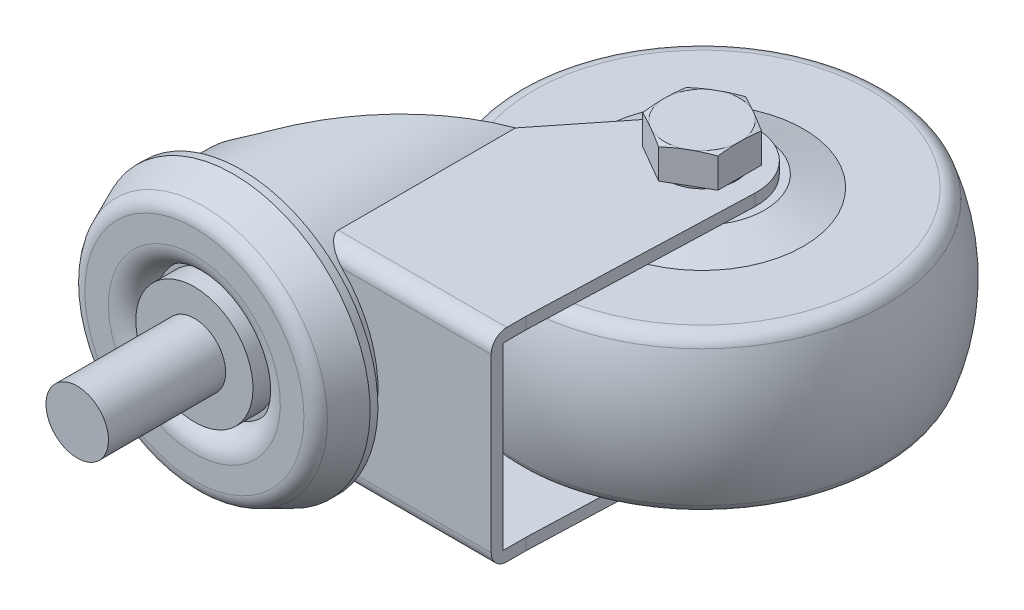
ISO-10303-21;
HEADER;
FILE_DESCRIPTION(('STEP AP214'),'2;1');
FILE_NAME('part.step','',(''),(''),'','','');
FILE_SCHEMA(('AUTOMOTIVE_DESIGN { 1 0 10303 214 1 1 1 1 }'));
ENDSEC;
DATA;
#1=APPLICATION_CONTEXT('core data for automotive mechanical design processes');
#2=APPLICATION_PROTOCOL_DEFINITION('international standard','automotive_design',2000,#1);
#3=PRODUCT_CONTEXT('',#1,'mechanical');
#4=PRODUCT('Part','Part','',(#3));
#5=PRODUCT_RELATED_PRODUCT_CATEGORY('part','',(#4));
#6=PRODUCT_DEFINITION_FORMATION('','',#4);
#7=PRODUCT_DEFINITION_CONTEXT('part definition',#1,'design');
#8=PRODUCT_DEFINITION('design','',#6,#7);
#9=PRODUCT_DEFINITION_SHAPE('','',#8);
#10=(LENGTH_UNIT() NAMED_UNIT(*) SI_UNIT(.MILLI.,.METRE.));
#11=(NAMED_UNIT(*) PLANE_ANGLE_UNIT() SI_UNIT($,.RADIAN.));
#12=(NAMED_UNIT(*) SI_UNIT($,.STERADIAN.) SOLID_ANGLE_UNIT());
#13=UNCERTAINTY_MEASURE_WITH_UNIT(LENGTH_MEASURE(1.E-05),#10,'distance_accuracy_value','');
#14=(GEOMETRIC_REPRESENTATION_CONTEXT(3) GLOBAL_UNCERTAINTY_ASSIGNED_CONTEXT((#13)) GLOBAL_UNIT_ASSIGNED_CONTEXT((#10,
#11,#12)) REPRESENTATION_CONTEXT('',''));
#15=CARTESIAN_POINT('',(0.,0.,0.));
#16=DIRECTION('',(0.,0.,1.));
#17=DIRECTION('',(1.,0.,0.));
#18=AXIS2_PLACEMENT_3D('',#15,#16,#17);
#19=CARTESIAN_POINT('',(-16.5,11.5,-36.));
#20=DIRECTION('',(0.,1.,0.));
#21=DIRECTION('',(-1.,0.,0.));
#22=AXIS2_PLACEMENT_3D('',#19,#20,#21);
#23=PLANE('',#22);
#24=CARTESIAN_POINT('',(24.,11.5,-41.));
#25=DIRECTION('',(0.,1.,0.));
#26=DIRECTION('',(-1.,0.,0.));
#27=AXIS2_PLACEMENT_3D('',#24,#25,#26);
#28=CIRCLE('',#27,8.);
#29=CARTESIAN_POINT('',(30.8594623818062,11.5,-36.883232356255));
#30=VERTEX_POINT('',#29);
#31=CARTESIAN_POINT('',(16.1101078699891,11.5,-42.3227252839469));
#32=VERTEX_POINT('',#31);
#33=EDGE_CURVE('E9',#30,#32,#28,.F.);
#34=ORIENTED_EDGE('',*,*,#33,.F.);
#35=DIRECTION('',(0.0351685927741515,0.,-0.999381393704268));
#36=VECTOR('',#35,1.);
#37=CARTESIAN_POINT('',(30.7698439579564,11.5,-34.3365570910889));
#38=LINE('',#37,#36);
#39=CARTESIAN_POINT('',(30.,11.5,-12.4599999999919));
#40=VERTEX_POINT('',#39);
#41=EDGE_CURVE('E835',#40,#30,#38,.T.);
#42=ORIENTED_EDGE('',*,*,#41,.F.);
#43=DIRECTION('',(0.,0.,-1.));
#44=VECTOR('',#43,1.);
#45=CARTESIAN_POINT('',(30.,11.5,-36.));
#46=LINE('',#45,#44);
#47=CARTESIAN_POINT('',(30.,11.5,-9.5));
#48=VERTEX_POINT('',#47);
#49=EDGE_CURVE('E827',#48,#40,#46,.T.);
#50=ORIENTED_EDGE('',*,*,#49,.F.);
#51=DIRECTION('',(1.,0.,0.));
#52=VECTOR('',#51,1.);
#53=CARTESIAN_POINT('',(-16.5,11.5,-9.5));
#54=LINE('',#53,#52);
#55=CARTESIAN_POINT('',(7.98435971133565,11.5,-9.5));
#56=VERTEX_POINT('',#55);
#57=EDGE_CURVE('E643',#56,#48,#54,.T.);
#58=ORIENTED_EDGE('',*,*,#57,.F.);
#59=DIRECTION('',(0.,0.,-1.));
#60=VECTOR('',#59,1.);
#61=CARTESIAN_POINT('',(7.98435971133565,11.5,-9.5));
#62=LINE('',#61,#60);
#63=CARTESIAN_POINT('',(7.98435971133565,11.5,-12.5));
#64=VERTEX_POINT('',#63);
#65=EDGE_CURVE('E862',#56,#64,#62,.T.);
#66=ORIENTED_EDGE('',*,*,#65,.T.);
#67=DIRECTION('',(0.,0.,1.));
#68=VECTOR('',#67,1.);
#69=CARTESIAN_POINT('',(7.98435971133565,11.5,-63.));
#70=LINE('',#69,#68);
#71=CARTESIAN_POINT('',(7.98435971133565,11.5,-32.0970244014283));
#72=VERTEX_POINT('',#71);
#73=EDGE_CURVE('E626',#72,#64,#70,.T.);
#74=ORIENTED_EDGE('',*,*,#73,.F.);
#75=DIRECTION('',(-0.622132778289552,0.,0.78291174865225));
#76=VECTOR('',#75,1.);
#77=CARTESIAN_POINT('',(0.408750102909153,11.5,-22.5636354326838));
#78=LINE('',#77,#76);
#79=EDGE_CURVE('E843',#32,#72,#78,.T.);
#80=ORIENTED_EDGE('',*,*,#79,.F.);
#81=EDGE_LOOP('',(#34,#42,#50,#58,#66,#74,#80));
#82=FACE_BOUND('',#81,.T.);
#83=ADVANCED_FACE('F14',(#82),#23,.F.);
#84=CARTESIAN_POINT('',(-16.5,-11.5,-13.));
#85=DIRECTION('',(0.,-1.,0.));
#86=DIRECTION('',(1.,0.,0.));
#87=AXIS2_PLACEMENT_3D('',#84,#85,#86);
#88=PLANE('',#87);
#89=CARTESIAN_POINT('',(24.,-11.5,-41.));
#90=DIRECTION('',(0.,-1.,0.));
#91=DIRECTION('',(1.,0.,0.));
#92=AXIS2_PLACEMENT_3D('',#89,#90,#91);
#93=CIRCLE('',#92,8.);
#94=CARTESIAN_POINT('',(16.1101078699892,-11.5,-42.3227252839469));
#95=VERTEX_POINT('',#94);
#96=CARTESIAN_POINT('',(30.8594623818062,-11.5,-36.883232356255));
#97=VERTEX_POINT('',#96);
#98=EDGE_CURVE('E23',#95,#97,#93,.F.);
#99=ORIENTED_EDGE('',*,*,#98,.F.);
#100=DIRECTION('',(0.622132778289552,0.,-0.78291174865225));
#101=VECTOR('',#100,1.);
#102=CARTESIAN_POINT('',(-10.7939763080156,-11.5,-8.46576689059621));
#103=LINE('',#102,#101);
#104=CARTESIAN_POINT('',(7.98435971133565,-11.5,-32.0970244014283));
#105=VERTEX_POINT('',#104);
#106=EDGE_CURVE('E840',#105,#95,#103,.T.);
#107=ORIENTED_EDGE('',*,*,#106,.F.);
#108=DIRECTION('',(0.,0.,1.));
#109=VECTOR('',#108,1.);
#110=CARTESIAN_POINT('',(7.98435971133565,-11.5,-63.));
#111=LINE('',#110,#109);
#112=CARTESIAN_POINT('',(7.98435971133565,-11.5,-12.5));
#113=VERTEX_POINT('',#112);
#114=EDGE_CURVE('E1007',#113,#105,#111,.F.);
#115=ORIENTED_EDGE('',*,*,#114,.F.);
#116=DIRECTION('',(0.,0.,-1.));
#117=VECTOR('',#116,1.);
#118=CARTESIAN_POINT('',(7.98435971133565,-11.5,-9.5));
#119=LINE('',#118,#117);
#120=CARTESIAN_POINT('',(7.98435971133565,-11.5,-9.5));
#121=VERTEX_POINT('',#120);
#122=EDGE_CURVE('E872',#121,#113,#119,.T.);
#123=ORIENTED_EDGE('',*,*,#122,.F.);
#124=DIRECTION('',(1.,0.,0.));
#125=VECTOR('',#124,1.);
#126=CARTESIAN_POINT('',(-16.5,-11.5,-9.5));
#127=LINE('',#126,#125);
#128=CARTESIAN_POINT('',(30.,-11.5,-9.5));
#129=VERTEX_POINT('',#128);
#130=EDGE_CURVE('E849',#121,#129,#127,.T.);
#131=ORIENTED_EDGE('',*,*,#130,.T.);
#132=DIRECTION('',(0.,0.,1.));
#133=VECTOR('',#132,1.);
#134=CARTESIAN_POINT('',(30.,-11.5,-13.));
#135=LINE('',#134,#133);
#136=CARTESIAN_POINT('',(30.,-11.5,-12.4599999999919));
#137=VERTEX_POINT('',#136);
#138=EDGE_CURVE('E825',#137,#129,#135,.T.);
#139=ORIENTED_EDGE('',*,*,#138,.F.);
#140=DIRECTION('',(-0.0351685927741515,0.,0.999381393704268));
#141=VECTOR('',#140,1.);
#142=CARTESIAN_POINT('',(29.9614667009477,-11.5,-11.3650041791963));
#143=LINE('',#142,#141);
#144=EDGE_CURVE('E831',#97,#137,#143,.T.);
#145=ORIENTED_EDGE('',*,*,#144,.F.);
#146=EDGE_LOOP('',(#99,#107,#115,#123,#131,#139,#145));
#147=FACE_BOUND('',#146,.T.);
#148=ADVANCED_FACE('F440',(#147),#88,.F.);
#149=CARTESIAN_POINT('',(24.,-13.258124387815,-41.));
#150=DIRECTION('',(0.,-1.,0.));
#151=DIRECTION('',(1.,0.,0.));
#152=AXIS2_PLACEMENT_3D('',#149,#150,#151);
#153=CONICAL_SURFACE('',#152,5.78,1.30899693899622);
#154=CARTESIAN_POINT('',(32.8284639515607,-14.0782325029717,-40.5353084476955));
#155=CARTESIAN_POINT('',(32.630710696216,-14.0269414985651,-40.4211355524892));
#156=CARTESIAN_POINT('',(32.4328303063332,-13.9762912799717,-40.3068892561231));
#157=CARTESIAN_POINT('',(32.0367485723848,-13.8766388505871,-40.0782113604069));
#158=CARTESIAN_POINT('',(31.8385472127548,-13.827636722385,-39.9637797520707));
#159=CARTESIAN_POINT('',(31.4414146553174,-13.7315645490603,-39.7344951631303));
#160=CARTESIAN_POINT('',(31.2424827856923,-13.6844981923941,-39.6196417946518));
#161=CARTESIAN_POINT('',(30.8441827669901,-13.592896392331,-39.3896831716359));
#162=CARTESIAN_POINT('',(30.6448146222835,-13.5483609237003,-39.2745779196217));
#163=CARTESIAN_POINT('',(30.2480639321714,-13.4629937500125,-39.0455138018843));
#164=CARTESIAN_POINT('',(30.050687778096,-13.4221226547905,-38.9315586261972));
#165=CARTESIAN_POINT('',(29.6553663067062,-13.3442400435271,-38.7033196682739));
#166=CARTESIAN_POINT('',(29.4574210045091,-13.3072284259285,-38.5890358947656));
#167=CARTESIAN_POINT('',(29.0610363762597,-13.2380290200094,-38.3601831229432));
#168=CARTESIAN_POINT('',(28.8625975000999,-13.2058378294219,-38.2456143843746));
#169=CARTESIAN_POINT('',(28.4650629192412,-13.147337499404,-38.0160976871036));
#170=CARTESIAN_POINT('',(28.2659672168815,-13.1210283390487,-37.9011497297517));
#171=CARTESIAN_POINT('',(27.865157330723,-13.0752200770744,-37.6697420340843));
#172=CARTESIAN_POINT('',(27.6634369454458,-13.0557921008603,-37.5532787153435));
#173=CARTESIAN_POINT('',(27.2595214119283,-13.0252033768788,-37.3200779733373));
#174=CARTESIAN_POINT('',(27.0573262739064,-13.0140424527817,-37.2033405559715));
#175=CARTESIAN_POINT('',(26.6526178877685,-13.0007118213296,-36.9696820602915));
#176=CARTESIAN_POINT('',(26.4501045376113,-12.9985461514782,-36.8527609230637));
#177=CARTESIAN_POINT('',(26.0451658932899,-13.0033685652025,-36.6189694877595));
#178=CARTESIAN_POINT('',(25.8427405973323,-13.0103564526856,-36.5020991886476));
#179=CARTESIAN_POINT('',(25.4359924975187,-13.0331361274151,-36.2672630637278));
#180=CARTESIAN_POINT('',(25.2316738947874,-13.0490258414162,-36.1492996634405));
#181=CARTESIAN_POINT('',(24.8235938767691,-13.0886978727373,-35.9136945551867));
#182=CARTESIAN_POINT('',(24.6198325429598,-13.1124812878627,-35.7960528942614));
#183=CARTESIAN_POINT('',(24.212984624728,-13.1667189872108,-35.5611591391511));
#184=CARTESIAN_POINT('',(24.0098980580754,-13.1971734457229,-35.4439070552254));
#185=CARTESIAN_POINT('',(23.6044789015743,-13.2635578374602,-35.2098381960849));
#186=CARTESIAN_POINT('',(23.4021460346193,-13.299485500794,-35.0930212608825));
#187=CARTESIAN_POINT('',(23.2001429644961,-13.3375655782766,-34.9763947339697));
#188=B_SPLINE_CURVE_WITH_KNOTS('',3,(#154,#155,#156,#157,#158,#159,#160,#161,#162,#163,#164,
#165,#166,#167,#168,#169,#170,#171,#172,#173,#174,#175,#176,#177,#178,#179,#180,#181,#182,#183,
#184,#185,#186,#187),.UNSPECIFIED.,.F.,.F.,(4,2,2,2,2,2,2,2,2,2,2,2,2,2,2,2,4),(0.,
0.70210946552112,1.40425406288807,2.10767980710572,2.81109853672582,3.50571046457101,
4.20030410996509,4.89440517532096,5.58850377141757,6.28958061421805,6.99064250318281,
7.69201902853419,8.39338052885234,9.10261347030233,9.81194508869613,10.5212952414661,
11.2303520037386),.UNSPECIFIED.);
#189=CARTESIAN_POINT('',(28.816666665,-13.199659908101,-38.2190962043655));
#190=VERTEX_POINT('',#189);
#191=CARTESIAN_POINT('',(26.4083333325,-13.,-36.8286443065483));
#192=VERTEX_POINT('',#191);
#193=EDGE_CURVE('E566',#190,#192,#188,.T.);
#194=ORIENTED_EDGE('',*,*,#193,.F.);
#195=CARTESIAN_POINT('',(28.816666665,-14.0654823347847,-48.3565171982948));
#196=CARTESIAN_POINT('',(28.816666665,-14.016509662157,-48.1379988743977));
#197=CARTESIAN_POINT('',(28.816666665,-13.9681359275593,-47.9193438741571));
#198=CARTESIAN_POINT('',(28.816666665,-13.8729096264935,-47.4816933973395));
#199=CARTESIAN_POINT('',(28.816666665,-13.8260571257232,-47.2626979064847));
#200=CARTESIAN_POINT('',(28.816666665,-13.7341558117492,-46.8241031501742));
#201=CARTESIAN_POINT('',(28.816666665,-13.6891088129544,-46.6045035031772));
#202=CARTESIAN_POINT('',(28.816666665,-13.6013047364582,-46.1648471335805));
#203=CARTESIAN_POINT('',(28.816666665,-13.5585476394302,-45.9447904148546));
#204=CARTESIAN_POINT('',(28.816666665,-13.4761981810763,-45.5058954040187));
#205=CARTESIAN_POINT('',(28.816666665,-13.4365833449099,-45.2870613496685));
#206=CARTESIAN_POINT('',(28.816666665,-13.3608122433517,-44.8487963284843));
#207=CARTESIAN_POINT('',(28.816666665,-13.3246559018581,-44.629365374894));
#208=CARTESIAN_POINT('',(28.816666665,-13.2566158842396,-44.1898639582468));
#209=CARTESIAN_POINT('',(28.816666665,-13.2247316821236,-43.9697935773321));
#210=CARTESIAN_POINT('',(28.816666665,-13.1661755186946,-43.5289525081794));
#211=CARTESIAN_POINT('',(28.816666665,-13.1395035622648,-43.3081818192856));
#212=CARTESIAN_POINT('',(28.816666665,-13.0921271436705,-42.86344943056));
#213=CARTESIAN_POINT('',(28.816666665,-13.0714940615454,-42.6394800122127));
#214=CARTESIAN_POINT('',(28.816666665,-13.0376187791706,-42.1909781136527));
#215=CARTESIAN_POINT('',(28.816666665,-13.0243764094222,-41.9664456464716));
#216=CARTESIAN_POINT('',(28.816666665,-13.0060548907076,-41.5171433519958));
#217=CARTESIAN_POINT('',(28.816666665,-13.0009720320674,-41.2923736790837));
#218=CARTESIAN_POINT('',(28.816666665,-12.9992820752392,-40.8428020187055));
#219=CARTESIAN_POINT('',(28.816666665,-13.0026749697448,-40.6180000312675));
#220=CARTESIAN_POINT('',(28.816666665,-13.0177455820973,-40.1678615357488));
#221=CARTESIAN_POINT('',(28.816666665,-13.0294533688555,-39.9425260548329));
#222=CARTESIAN_POINT('',(28.816666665,-13.0604859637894,-39.4923851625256));
#223=CARTESIAN_POINT('',(28.816666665,-13.0798109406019,-39.2675797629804));
#224=CARTESIAN_POINT('',(28.816666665,-13.1250998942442,-38.8185002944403));
#225=CARTESIAN_POINT('',(28.816666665,-13.1510682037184,-38.5942266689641));
#226=CARTESIAN_POINT('',(28.816666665,-13.2085702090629,-38.1464030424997));
#227=CARTESIAN_POINT('',(28.816666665,-13.2401039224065,-37.9228530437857));
#228=CARTESIAN_POINT('',(28.816666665,-13.3370238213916,-37.2828076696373));
#229=CARTESIAN_POINT('',(28.816666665,-13.4080457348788,-36.8671698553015));
#230=CARTESIAN_POINT('',(28.816666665,-13.5606088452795,-36.03782987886));
#231=CARTESIAN_POINT('',(28.816666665,-13.6421513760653,-35.6241279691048));
#232=CARTESIAN_POINT('',(28.816666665,-13.8122990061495,-34.7980854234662));
#233=CARTESIAN_POINT('',(28.816666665,-13.9009058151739,-34.3857451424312));
#234=CARTESIAN_POINT('',(28.816666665,-14.0829250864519,-33.5621603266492));
#235=CARTESIAN_POINT('',(28.816666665,-14.1763372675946,-33.1509157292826));
#236=CARTESIAN_POINT('',(28.816666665,-14.3656041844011,-32.3332483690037));
#237=CARTESIAN_POINT('',(28.816666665,-14.4614258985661,-31.9268179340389));
#238=CARTESIAN_POINT('',(28.816666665,-14.6554688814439,-31.1145240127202));
#239=CARTESIAN_POINT('',(28.816666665,-14.7536901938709,-30.7086605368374));
#240=CARTESIAN_POINT('',(28.816666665,-14.9517828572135,-29.8978680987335));
#241=CARTESIAN_POINT('',(28.816666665,-15.0516520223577,-29.4929386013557));
#242=CARTESIAN_POINT('',(28.816666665,-15.2527540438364,-28.6834323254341));
#243=CARTESIAN_POINT('',(28.816666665,-15.353986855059,-28.2788555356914));
#244=CARTESIAN_POINT('',(28.816666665,-15.4557026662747,-27.8744016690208));
#245=B_SPLINE_CURVE_WITH_KNOTS('',3,(#195,#196,#197,#198,#199,#200,#201,#202,#203,#204,#205,
#206,#207,#208,#209,#210,#211,#212,#213,#214,#215,#216,#217,#218,#219,#220,#221,#222,#223,#224,
#225,#226,#227,#228,#229,#230,#231,#232,#233,#234,#235,#236,#237,#238,#239,#240,#241,#242,#243,
#244),.UNSPECIFIED.,.F.,.F.,(4,2,2,2,2,2,2,2,2,2,2,2,2,2,2,2,2,2,2,2,2,2,2,2,4),(0.,
0.671819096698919,1.34366716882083,2.01617428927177,2.68867573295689,3.35582604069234,
4.02296166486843,4.69001507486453,5.35706910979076,6.03171582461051,6.70634706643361,
7.38067150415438,8.05499536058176,8.73177025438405,9.40856013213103,10.0857925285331,
10.7630270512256,12.0277754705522,13.2926844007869,14.5579004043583,15.8230424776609,
17.0757526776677,18.3284857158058,19.5796728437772,20.8308186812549),.UNSPECIFIED.);
#246=CARTESIAN_POINT('',(28.816666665,-13.,-41.));
#247=VERTEX_POINT('',#246);
#248=EDGE_CURVE('E450',#247,#190,#245,.T.);
#249=ORIENTED_EDGE('',*,*,#248,.F.);
#250=CARTESIAN_POINT('',(24.,-13.,-41.));
#251=DIRECTION('',(0.,1.,0.));
#252=DIRECTION('',(0.,0.,-1.));
#253=AXIS2_PLACEMENT_3D('',#250,#251,#252);
#254=CIRCLE('',#253,4.81666667);
#255=EDGE_CURVE('E659',#247,#192,#254,.F.);
#256=ORIENTED_EDGE('',*,*,#255,.T.);
#257=EDGE_LOOP('',(#194,#249,#256));
#258=FACE_BOUND('',#257,.T.);
#259=ADVANCED_FACE('F435',(#258),#153,.T.);
#260=CARTESIAN_POINT('',(24.,-13.199659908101,-35.4381924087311));
#261=VERTEX_POINT('',#260);
#262=EDGE_CURVE('E561',#192,#261,#188,.T.);
#263=ORIENTED_EDGE('',*,*,#262,.F.);
#264=CARTESIAN_POINT('',(21.5916666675,-13.,-36.8286443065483));
#265=VERTEX_POINT('',#264);
#266=EDGE_CURVE('E563',#192,#265,#254,.F.);
#267=ORIENTED_EDGE('',*,*,#266,.T.);
#268=CARTESIAN_POINT('',(25.9852538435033,-13.5838434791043,-34.2920055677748));
#269=CARTESIAN_POINT('',(25.809453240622,-13.5444159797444,-34.393504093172));
#270=CARTESIAN_POINT('',(25.6334713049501,-13.5060338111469,-34.4951073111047));
#271=CARTESIAN_POINT('',(25.2810661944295,-13.4319110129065,-34.6985684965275));
#272=CARTESIAN_POINT('',(25.1046429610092,-13.3961707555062,-34.800426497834));
#273=CARTESIAN_POINT('',(24.7508961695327,-13.327810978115,-35.004662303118));
#274=CARTESIAN_POINT('',(24.5735714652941,-13.2951992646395,-35.1070407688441));
#275=CARTESIAN_POINT('',(24.2184267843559,-13.2338911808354,-35.3120836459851));
#276=CARTESIAN_POINT('',(24.0406068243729,-13.2051946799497,-35.4147480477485));
#277=CARTESIAN_POINT('',(23.5108778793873,-13.1268413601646,-35.7205871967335));
#278=CARTESIAN_POINT('',(23.1581525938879,-13.0840035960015,-35.9242332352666));
#279=CARTESIAN_POINT('',(22.6280859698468,-13.0382030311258,-36.2302673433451));
#280=CARTESIAN_POINT('',(22.4513300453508,-13.0260138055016,-36.3323174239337));
#281=CARTESIAN_POINT('',(22.0975617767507,-13.0083360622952,-36.5365656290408));
#282=CARTESIAN_POINT('',(21.9205494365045,-13.0028474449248,-36.6387637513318));
#283=CARTESIAN_POINT('',(21.5662914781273,-12.9988601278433,-36.8432946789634));
#284=CARTESIAN_POINT('',(21.3890458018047,-13.0003683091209,-36.945627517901));
#285=CARTESIAN_POINT('',(21.034700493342,-13.0103085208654,-37.150208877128));
#286=CARTESIAN_POINT('',(20.8576008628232,-13.0187406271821,-37.2524573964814));
#287=CARTESIAN_POINT('',(20.5035253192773,-13.0421135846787,-37.4568830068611));
#288=CARTESIAN_POINT('',(20.3265497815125,-13.0570618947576,-37.5590598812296));
#289=CARTESIAN_POINT('',(19.9730466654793,-13.0927922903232,-37.7631550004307));
#290=CARTESIAN_POINT('',(19.796519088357,-13.1135743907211,-37.8650732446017));
#291=CARTESIAN_POINT('',(19.4417164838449,-13.160479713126,-38.0699186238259));
#292=CARTESIAN_POINT('',(19.2634479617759,-13.1866678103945,-38.1728420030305));
#293=CARTESIAN_POINT('',(18.9074282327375,-13.2433979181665,-38.3783900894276));
#294=CARTESIAN_POINT('',(18.7296770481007,-13.2739401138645,-38.4810147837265));
#295=CARTESIAN_POINT('',(18.375079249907,-13.3385475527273,-38.6857419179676));
#296=CARTESIAN_POINT('',(18.1982314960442,-13.3726045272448,-38.7878450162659));
#297=CARTESIAN_POINT('',(17.8450120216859,-13.4436757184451,-38.9917763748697));
#298=CARTESIAN_POINT('',(17.668640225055,-13.4806894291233,-39.093604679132));
#299=CARTESIAN_POINT('',(17.4924673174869,-13.5188756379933,-39.1953181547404));
#300=B_SPLINE_CURVE_WITH_KNOTS('',3,(#268,#269,#270,#271,#272,#273,#274,#275,#276,#277,#278,
#279,#280,#281,#282,#283,#284,#285,#286,#287,#288,#289,#290,#291,#292,#293,#294,#295,#296,#297,
#298,#299),.UNSPECIFIED.,.F.,.F.,(4,2,2,2,2,2,2,2,2,2,2,2,2,2,2,4),(0.,0.620377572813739,
1.24084239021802,1.8628172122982,2.48477128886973,3.71269945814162,4.32599908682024,
4.93928958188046,5.55318334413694,6.16708383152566,6.7816888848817,7.39629550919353,
8.01875808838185,8.64124715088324,9.26230379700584,9.88325438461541),.UNSPECIFIED.);
#301=EDGE_CURVE('E426',#261,#265,#300,.T.);
#302=ORIENTED_EDGE('',*,*,#301,.F.);
#303=EDGE_LOOP('',(#263,#267,#302));
#304=FACE_BOUND('',#303,.T.);
#305=ADVANCED_FACE('F439',(#304),#153,.T.);
#306=CARTESIAN_POINT('',(19.183333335,-13.199659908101,-38.2190962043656));
#307=VERTEX_POINT('',#306);
#308=EDGE_CURVE('E419',#265,#307,#300,.T.);
#309=ORIENTED_EDGE('',*,*,#308,.F.);
#310=CARTESIAN_POINT('',(19.183333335,-13.,-41.));
#311=VERTEX_POINT('',#310);
#312=EDGE_CURVE('E1494',#265,#311,#254,.F.);
#313=ORIENTED_EDGE('',*,*,#312,.T.);
#314=CARTESIAN_POINT('',(19.183333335,-14.0654823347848,-48.3565171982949));
#315=CARTESIAN_POINT('',(19.183333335,-14.016509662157,-48.1379988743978));
#316=CARTESIAN_POINT('',(19.183333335,-13.9681359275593,-47.9193438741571));
#317=CARTESIAN_POINT('',(19.183333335,-13.8729096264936,-47.4816933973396));
#318=CARTESIAN_POINT('',(19.183333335,-13.8260571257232,-47.2626979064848));
#319=CARTESIAN_POINT('',(19.183333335,-13.7341558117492,-46.8241031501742));
#320=CARTESIAN_POINT('',(19.183333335,-13.6891088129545,-46.6045035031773));
#321=CARTESIAN_POINT('',(19.183333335,-13.6013047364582,-46.1648471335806));
#322=CARTESIAN_POINT('',(19.183333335,-13.5585476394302,-45.9447904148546));
#323=CARTESIAN_POINT('',(19.183333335,-13.4761981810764,-45.5058954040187));
#324=CARTESIAN_POINT('',(19.183333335,-13.4365833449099,-45.2870613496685));
#325=CARTESIAN_POINT('',(19.183333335,-13.3608122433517,-44.8487963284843));
#326=CARTESIAN_POINT('',(19.183333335,-13.3246559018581,-44.629365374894));
#327=CARTESIAN_POINT('',(19.183333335,-13.2566158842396,-44.1898639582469));
#328=CARTESIAN_POINT('',(19.183333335,-13.2247316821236,-43.9697935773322));
#329=CARTESIAN_POINT('',(19.183333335,-13.1661755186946,-43.5289525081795));
#330=CARTESIAN_POINT('',(19.183333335,-13.1395035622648,-43.3081818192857));
#331=CARTESIAN_POINT('',(19.183333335,-13.0921271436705,-42.8634494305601));
#332=CARTESIAN_POINT('',(19.183333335,-13.0714940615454,-42.6394800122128));
#333=CARTESIAN_POINT('',(19.183333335,-13.0376187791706,-42.1909781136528));
#334=CARTESIAN_POINT('',(19.183333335,-13.0243764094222,-41.9664456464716));
#335=CARTESIAN_POINT('',(19.183333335,-13.0060548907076,-41.5171433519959));
#336=CARTESIAN_POINT('',(19.183333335,-13.0009720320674,-41.2923736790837));
#337=CARTESIAN_POINT('',(19.183333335,-12.9992820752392,-40.8428020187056));
#338=CARTESIAN_POINT('',(19.183333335,-13.0026749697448,-40.6180000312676));
#339=CARTESIAN_POINT('',(19.183333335,-13.0177455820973,-40.1678615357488));
#340=CARTESIAN_POINT('',(19.183333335,-13.0294533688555,-39.942526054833));
#341=CARTESIAN_POINT('',(19.183333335,-13.0604859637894,-39.4923851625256));
#342=CARTESIAN_POINT('',(19.183333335,-13.0798109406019,-39.2675797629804));
#343=CARTESIAN_POINT('',(19.183333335,-13.1250998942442,-38.8185002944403));
#344=CARTESIAN_POINT('',(19.183333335,-13.1510682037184,-38.5942266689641));
#345=CARTESIAN_POINT('',(19.183333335,-13.2085702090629,-38.1464030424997));
#346=CARTESIAN_POINT('',(19.183333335,-13.2401039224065,-37.9228530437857));
#347=CARTESIAN_POINT('',(19.183333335,-13.3370238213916,-37.2828076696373));
#348=CARTESIAN_POINT('',(19.183333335,-13.4080457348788,-36.8671698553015));
#349=CARTESIAN_POINT('',(19.183333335,-13.5606088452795,-36.03782987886));
#350=CARTESIAN_POINT('',(19.183333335,-13.6421513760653,-35.6241279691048));
#351=CARTESIAN_POINT('',(19.183333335,-13.8122990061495,-34.7980854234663));
#352=CARTESIAN_POINT('',(19.183333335,-13.9009058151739,-34.3857451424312));
#353=CARTESIAN_POINT('',(19.183333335,-14.0829250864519,-33.5621603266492));
#354=CARTESIAN_POINT('',(19.183333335,-14.1763372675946,-33.1509157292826));
#355=CARTESIAN_POINT('',(19.183333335,-14.365604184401,-32.3332483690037));
#356=CARTESIAN_POINT('',(19.183333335,-14.4614258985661,-31.9268179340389));
#357=CARTESIAN_POINT('',(19.183333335,-14.6554688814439,-31.1145240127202));
#358=CARTESIAN_POINT('',(19.183333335,-14.7536901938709,-30.7086605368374));
#359=CARTESIAN_POINT('',(19.183333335,-14.9517828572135,-29.8978680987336));
#360=CARTESIAN_POINT('',(19.183333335,-15.0516520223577,-29.4929386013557));
#361=CARTESIAN_POINT('',(19.183333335,-15.2527540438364,-28.6834323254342));
#362=CARTESIAN_POINT('',(19.183333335,-15.353986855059,-28.2788555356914));
#363=CARTESIAN_POINT('',(19.183333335,-15.4557026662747,-27.8744016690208));
#364=B_SPLINE_CURVE_WITH_KNOTS('',3,(#314,#315,#316,#317,#318,#319,#320,#321,#322,#323,#324,
#325,#326,#327,#328,#329,#330,#331,#332,#333,#334,#335,#336,#337,#338,#339,#340,#341,#342,#343,
#344,#345,#346,#347,#348,#349,#350,#351,#352,#353,#354,#355,#356,#357,#358,#359,#360,#361,#362,
#363),.UNSPECIFIED.,.F.,.F.,(4,2,2,2,2,2,2,2,2,2,2,2,2,2,2,2,2,2,2,2,2,2,2,2,4),(0.,
0.671819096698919,1.34366716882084,2.01617428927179,2.68867573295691,3.35582604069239,
4.02296166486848,4.69001507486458,5.35706910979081,6.03171582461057,6.70634706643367,
7.38067150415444,8.05499536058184,8.73177025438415,9.40856013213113,10.0857925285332,
10.7630270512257,12.0277754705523,13.292684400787,14.5579004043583,15.8230424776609,
17.0757526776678,18.3284857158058,19.5796728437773,20.830818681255),.UNSPECIFIED.);
#365=EDGE_CURVE('E481',#307,#311,#364,.F.);
#366=ORIENTED_EDGE('',*,*,#365,.F.);
#367=EDGE_LOOP('',(#309,#313,#366));
#368=FACE_BOUND('',#367,.T.);
#369=ADVANCED_FACE('F1454',(#368),#153,.T.);
#370=CARTESIAN_POINT('',(19.183333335,-13.199659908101,-43.7809037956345));
#371=VERTEX_POINT('',#370);
#372=EDGE_CURVE('E476',#311,#371,#364,.F.);
#373=ORIENTED_EDGE('',*,*,#372,.F.);
#374=CARTESIAN_POINT('',(21.5916666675,-13.,-45.1713556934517));
#375=VERTEX_POINT('',#374);
#376=EDGE_CURVE('E1489',#311,#375,#254,.F.);
#377=ORIENTED_EDGE('',*,*,#376,.T.);
#378=CARTESIAN_POINT('',(18.3837584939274,-13.3375123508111,-43.319269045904));
#379=CARTESIAN_POINT('',(18.585761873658,-13.2994343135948,-43.4358957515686));
#380=CARTESIAN_POINT('',(18.7880950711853,-13.2635089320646,-43.552712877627));
#381=CARTESIAN_POINT('',(19.1935149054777,-13.197129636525,-43.7867821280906));
#382=CARTESIAN_POINT('',(19.3966018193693,-13.1666779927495,-43.9040344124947));
#383=CARTESIAN_POINT('',(19.8034502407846,-13.1124465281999,-44.1389284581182));
#384=CARTESIAN_POINT('',(20.0072117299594,-13.0886665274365,-44.2565702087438));
#385=CARTESIAN_POINT('',(20.415291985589,-13.0490018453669,-44.4921754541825));
#386=CARTESIAN_POINT('',(20.6196106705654,-13.0331160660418,-44.6101389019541));
#387=CARTESIAN_POINT('',(21.0263590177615,-13.0103445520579,-44.8449751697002));
#388=CARTESIAN_POINT('',(21.2287844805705,-13.0033608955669,-44.9618455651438));
#389=CARTESIAN_POINT('',(21.6337233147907,-12.9985470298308,-45.1956371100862));
#390=CARTESIAN_POINT('',(21.8362366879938,-13.0007170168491,-45.3125582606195));
#391=CARTESIAN_POINT('',(22.2409450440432,-13.0140560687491,-45.5462167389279));
#392=CARTESIAN_POINT('',(22.4431401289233,-13.0252210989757,-45.6629541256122));
#393=CARTESIAN_POINT('',(22.8470554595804,-13.0558175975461,-45.8961547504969));
#394=CARTESIAN_POINT('',(23.0487756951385,-13.0752492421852,-46.0126179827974));
#395=CARTESIAN_POINT('',(23.4495850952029,-13.1210642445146,-46.2440253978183));
#396=CARTESIAN_POINT('',(23.6486804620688,-13.1473764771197,-46.3589731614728));
#397=CARTESIAN_POINT('',(24.0462143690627,-13.2058824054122,-46.5884894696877));
#398=CARTESIAN_POINT('',(24.2446529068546,-13.2380761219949,-46.7030580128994));
#399=CARTESIAN_POINT('',(24.6410368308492,-13.3072800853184,-46.9319103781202));
#400=CARTESIAN_POINT('',(24.8389817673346,-13.3442937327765,-47.0461939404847));
#401=CARTESIAN_POINT('',(25.2343025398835,-13.4221799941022,-47.2744324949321));
#402=CARTESIAN_POINT('',(25.4316783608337,-13.4630527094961,-47.3883874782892));
#403=CARTESIAN_POINT('',(25.8284282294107,-13.5484227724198,-47.6174511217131));
#404=CARTESIAN_POINT('',(26.0277958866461,-13.5929595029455,-47.7325560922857));
#405=CARTESIAN_POINT('',(26.42609496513,-13.6845635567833,-47.9625141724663));
#406=CARTESIAN_POINT('',(26.6250263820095,-13.7316309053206,-48.077367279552));
#407=CARTESIAN_POINT('',(27.022158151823,-13.8277048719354,-48.3066514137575));
#408=CARTESIAN_POINT('',(27.2203591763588,-13.8767078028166,-48.4210828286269));
#409=CARTESIAN_POINT('',(27.6164402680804,-13.9763616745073,-48.6497603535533));
#410=CARTESIAN_POINT('',(27.8143203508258,-14.027012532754,-48.7640064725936));
#411=CARTESIAN_POINT('',(28.0120733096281,-14.0783041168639,-48.8781791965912));
#412=B_SPLINE_CURVE_WITH_KNOTS('',3,(#378,#379,#380,#381,#382,#383,#384,#385,#386,#387,#388,
#389,#390,#391,#392,#393,#394,#395,#396,#397,#398,#399,#400,#401,#402,#403,#404,#405,#406,#407,
#408,#409,#410,#411),.UNSPECIFIED.,.F.,.F.,(4,2,2,2,2,2,2,2,2,2,2,2,2,2,2,2,4),(0.,
0.709056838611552,1.41840708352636,2.12773818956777,2.83697060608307,3.53833229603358,
4.23970902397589,4.94077132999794,5.64184858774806,6.33594709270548,7.03004806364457,
7.72464144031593,8.41925309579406,9.12267089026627,9.82609569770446,10.5282396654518,
11.2303485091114),.UNSPECIFIED.);
#413=EDGE_CURVE('E488',#371,#375,#412,.T.);
#414=ORIENTED_EDGE('',*,*,#413,.F.);
#415=EDGE_LOOP('',(#373,#377,#414));
#416=FACE_BOUND('',#415,.T.);
#417=ADVANCED_FACE('F1461',(#416),#153,.T.);
#418=CARTESIAN_POINT('',(24.,-13.199659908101,-46.5618075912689));
#419=VERTEX_POINT('',#418);
#420=EDGE_CURVE('E470',#375,#419,#412,.T.);
#421=ORIENTED_EDGE('',*,*,#420,.F.);
#422=CARTESIAN_POINT('',(26.4083333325,-13.,-45.1713556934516));
#423=VERTEX_POINT('',#422);
#424=EDGE_CURVE('E654',#375,#423,#254,.F.);
#425=ORIENTED_EDGE('',*,*,#424,.T.);
#426=CARTESIAN_POINT('',(22.3087452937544,-13.5189599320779,-47.538253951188));
#427=CARTESIAN_POINT('',(22.4849170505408,-13.4807721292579,-47.4365411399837));
#428=CARTESIAN_POINT('',(22.6612876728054,-13.4437566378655,-47.3347135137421));
#429=CARTESIAN_POINT('',(23.0145047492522,-13.3726814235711,-47.1307835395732));
#430=CARTESIAN_POINT('',(23.1913512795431,-13.3386222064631,-47.0286811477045));
#431=CARTESIAN_POINT('',(23.5459466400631,-13.2740097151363,-46.8239554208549));
#432=CARTESIAN_POINT('',(23.7236966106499,-13.243464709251,-46.7213314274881));
#433=CARTESIAN_POINT('',(24.0797138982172,-13.1867283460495,-46.515784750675));
#434=CARTESIAN_POINT('',(24.2579811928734,-13.1605368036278,-46.4128620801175));
#435=CARTESIAN_POINT('',(24.6127813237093,-13.1136239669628,-46.2080181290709));
#436=CARTESIAN_POINT('',(24.7893076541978,-13.0928378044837,-46.1061006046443));
#437=CARTESIAN_POINT('',(25.1428083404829,-13.057098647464,-45.9020068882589));
#438=CARTESIAN_POINT('',(25.3197826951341,-13.0421456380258,-45.7998306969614));
#439=CARTESIAN_POINT('',(25.6738559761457,-13.0187627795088,-45.5954063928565));
#440=CARTESIAN_POINT('',(25.8509545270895,-13.0103254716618,-45.4931584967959));
#441=CARTESIAN_POINT('',(26.205297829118,-13.0003745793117,-45.2885782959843));
#442=CARTESIAN_POINT('',(26.3825425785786,-12.998860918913,-45.1862459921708));
#443=CARTESIAN_POINT('',(26.7367993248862,-13.002837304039,-44.9817157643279));
#444=CARTESIAN_POINT('',(26.9138113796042,-13.0083204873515,-44.8795178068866));
#445=CARTESIAN_POINT('',(27.2675792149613,-13.0259876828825,-44.6752698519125));
#446=CARTESIAN_POINT('',(27.4443349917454,-13.0381717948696,-44.5732198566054));
#447=CARTESIAN_POINT('',(27.9744013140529,-13.0839578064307,-44.2671859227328));
#448=CARTESIAN_POINT('',(28.3271265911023,-13.126786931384,-44.0635398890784));
#449=CARTESIAN_POINT('',(28.8568555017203,-13.2051291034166,-43.7577007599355));
#450=CARTESIAN_POINT('',(29.0346754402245,-13.2338221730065,-43.6550363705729));
#451=CARTESIAN_POINT('',(29.3898200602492,-13.2951239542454,-43.4499935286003));
#452=CARTESIAN_POINT('',(29.5671447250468,-13.3277327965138,-43.3476150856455));
#453=CARTESIAN_POINT('',(29.9208914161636,-13.39608732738,-43.1433793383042));
#454=CARTESIAN_POINT('',(30.097314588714,-13.4318252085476,-43.041521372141));
#455=CARTESIAN_POINT('',(30.4497195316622,-13.5059436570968,-42.8380602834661));
#456=CARTESIAN_POINT('',(30.6257013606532,-13.5443238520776,-42.7364571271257));
#457=CARTESIAN_POINT('',(30.8015018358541,-13.5837495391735,-42.6349586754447));
#458=B_SPLINE_CURVE_WITH_KNOTS('',3,(#426,#427,#428,#429,#430,#431,#432,#433,#434,#435,#436,
#437,#438,#439,#440,#441,#442,#443,#444,#445,#446,#447,#448,#449,#450,#451,#452,#453,#454,#455,
#456,#457),.UNSPECIFIED.,.F.,.F.,(4,2,2,2,2,2,2,2,2,2,2,2,2,2,2,4),(0.,0.620947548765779,
1.24200112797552,1.86448728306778,2.48694696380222,3.10155054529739,3.71615255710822,
4.33004996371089,4.94394064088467,5.55722970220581,6.17052789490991,7.39845317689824,
8.02040574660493,8.64237906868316,9.26284244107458,9.88321854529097),.UNSPECIFIED.);
#459=EDGE_CURVE('E503',#419,#423,#458,.T.);
#460=ORIENTED_EDGE('',*,*,#459,.F.);
#461=EDGE_LOOP('',(#421,#425,#460));
#462=FACE_BOUND('',#461,.T.);
#463=ADVANCED_FACE('F1468',(#462),#153,.T.);
#464=CARTESIAN_POINT('',(28.816666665,-13.199659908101,-43.7809037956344));
#465=VERTEX_POINT('',#464);
#466=EDGE_CURVE('E461',#423,#465,#458,.T.);
#467=ORIENTED_EDGE('',*,*,#466,.F.);
#468=EDGE_CURVE('E655',#423,#247,#254,.F.);
#469=ORIENTED_EDGE('',*,*,#468,.T.);
#470=EDGE_CURVE('E525',#465,#247,#245,.T.);
#471=ORIENTED_EDGE('',*,*,#470,.F.);
#472=EDGE_LOOP('',(#467,#469,#471));
#473=FACE_BOUND('',#472,.T.);
#474=ADVANCED_FACE('F442',(#473),#153,.T.);
#475=CARTESIAN_POINT('',(-16.5,13.,-8.));
#476=DIRECTION('',(0.,-1.,0.));
#477=DIRECTION('',(0.,0.,1.));
#478=AXIS2_PLACEMENT_3D('',#475,#476,#477);
#479=PLANE('',#478);
#480=DIRECTION('',(0.,0.,1.));
#481=VECTOR('',#480,1.);
#482=CARTESIAN_POINT('',(8.44097150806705,13.,-56.));
#483=LINE('',#482,#481);
#484=CARTESIAN_POINT('',(8.44097150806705,13.,-32.6716392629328));
#485=VERTEX_POINT('',#484);
#486=CARTESIAN_POINT('',(8.44097150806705,13.,-10.));
#487=VERTEX_POINT('',#486);
#488=EDGE_CURVE('E784',#485,#487,#483,.T.);
#489=ORIENTED_EDGE('',*,*,#488,.T.);
#490=DIRECTION('',(1.,0.,0.));
#491=VECTOR('',#490,1.);
#492=CARTESIAN_POINT('',(-16.5,13.,-10.));
#493=LINE('',#492,#491);
#494=CARTESIAN_POINT('',(30.,13.,-10.));
#495=VERTEX_POINT('',#494);
#496=EDGE_CURVE('E688',#487,#495,#493,.T.);
#497=ORIENTED_EDGE('',*,*,#496,.T.);
#498=DIRECTION('',(0.,0.,1.));
#499=VECTOR('',#498,1.);
#500=CARTESIAN_POINT('',(30.,13.,-8.));
#501=LINE('',#500,#499);
#502=CARTESIAN_POINT('',(30.,13.,-12.4599999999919));
#503=VERTEX_POINT('',#502);
#504=EDGE_CURVE('E802',#503,#495,#501,.T.);
#505=ORIENTED_EDGE('',*,*,#504,.F.);
#506=DIRECTION('',(-0.0351685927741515,0.,0.999381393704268));
#507=VECTOR('',#506,1.);
#508=CARTESIAN_POINT('',(29.7857325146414,13.,-6.3711883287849));
#509=LINE('',#508,#507);
#510=CARTESIAN_POINT('',(30.99566975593,13.,-40.7538198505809));
#511=VERTEX_POINT('',#510);
#512=EDGE_CURVE('E829',#511,#503,#509,.T.);
#513=ORIENTED_EDGE('',*,*,#512,.F.);
#514=CARTESIAN_POINT('',(24.,13.,-41.));
#515=DIRECTION('',(0.,-1.,0.));
#516=DIRECTION('',(0.,0.,1.));
#517=AXIS2_PLACEMENT_3D('',#514,#515,#516);
#518=CIRCLE('',#517,7.00000000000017);
#519=CARTESIAN_POINT('',(18.5196177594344,13.,-45.3549294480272));
#520=VERTEX_POINT('',#519);
#521=EDGE_CURVE('E979',#520,#511,#518,.T.);
#522=ORIENTED_EDGE('',*,*,#521,.F.);
#523=DIRECTION('',(0.622132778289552,0.,-0.78291174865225));
#524=VECTOR('',#523,1.);
#525=CARTESIAN_POINT('',(-13.2293516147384,13.,-5.4010128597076));
#526=LINE('',#525,#524);
#527=EDGE_CURVE('E794',#485,#520,#526,.T.);
#528=ORIENTED_EDGE('',*,*,#527,.F.);
#529=EDGE_LOOP('',(#489,#497,#505,#513,#522,#528));
#530=FACE_BOUND('',#529,.T.);
#531=CARTESIAN_POINT('',(24.,13.,-41.));
#532=DIRECTION('',(0.,-1.,0.));
#533=DIRECTION('',(0.,0.,1.));
#534=AXIS2_PLACEMENT_3D('',#531,#532,#533);
#535=CIRCLE('',#534,4.44);
#536=CARTESIAN_POINT('',(24.,13.,-36.56));
#537=VERTEX_POINT('',#536);
#538=EDGE_CURVE('E658',#537,#537,#535,.F.);
#539=ORIENTED_EDGE('',*,*,#538,.F.);
#540=EDGE_LOOP('',(#539));
#541=FACE_BOUND('',#540,.T.);
#542=ADVANCED_FACE('F613',(#530,#541),#479,.F.);
#543=CARTESIAN_POINT('',(-16.5,-13.,-48.));
#544=DIRECTION('',(0.,1.,0.));
#545=DIRECTION('',(0.,0.,-1.));
#546=AXIS2_PLACEMENT_3D('',#543,#544,#545);
#547=PLANE('',#546);
#548=DIRECTION('',(0.,0.,-1.));
#549=VECTOR('',#548,1.);
#550=CARTESIAN_POINT('',(30.,-13.,-48.));
#551=LINE('',#550,#549);
#552=CARTESIAN_POINT('',(30.,-13.,-10.));
#553=VERTEX_POINT('',#552);
#554=CARTESIAN_POINT('',(30.,-13.,-12.4599999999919));
#555=VERTEX_POINT('',#554);
#556=EDGE_CURVE('E810',#553,#555,#551,.T.);
#557=ORIENTED_EDGE('',*,*,#556,.F.);
#558=DIRECTION('',(1.,0.,0.));
#559=VECTOR('',#558,1.);
#560=CARTESIAN_POINT('',(-16.5,-13.,-10.));
#561=LINE('',#560,#559);
#562=CARTESIAN_POINT('',(8.44097150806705,-13.,-10.));
#563=VERTEX_POINT('',#562);
#564=EDGE_CURVE('E686',#553,#563,#561,.F.);
#565=ORIENTED_EDGE('',*,*,#564,.T.);
#566=DIRECTION('',(0.,0.,1.));
#567=VECTOR('',#566,1.);
#568=CARTESIAN_POINT('',(8.44097150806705,-13.,-56.));
#569=LINE('',#568,#567);
#570=CARTESIAN_POINT('',(8.44097150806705,-13.,-32.6716392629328));
#571=VERTEX_POINT('',#570);
#572=EDGE_CURVE('E796',#571,#563,#569,.T.);
#573=ORIENTED_EDGE('',*,*,#572,.F.);
#574=DIRECTION('',(-0.622132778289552,0.,0.78291174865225));
#575=VECTOR('',#574,1.);
#576=CARTESIAN_POINT('',(6.2536508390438,-13.,-29.9190451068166));
#577=LINE('',#576,#575);
#578=CARTESIAN_POINT('',(18.5196177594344,-13.,-45.3549294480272));
#579=VERTEX_POINT('',#578);
#580=EDGE_CURVE('E648',#579,#571,#577,.T.);
#581=ORIENTED_EDGE('',*,*,#580,.F.);
#582=CARTESIAN_POINT('',(24.,-13.,-41.));
#583=DIRECTION('',(0.,1.,0.));
#584=DIRECTION('',(0.,0.,-1.));
#585=AXIS2_PLACEMENT_3D('',#582,#583,#584);
#586=CIRCLE('',#585,7.00000000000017);
#587=CARTESIAN_POINT('',(30.99566975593,-13.,-40.7538198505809));
#588=VERTEX_POINT('',#587);
#589=EDGE_CURVE('E977',#588,#579,#586,.T.);
#590=ORIENTED_EDGE('',*,*,#589,.F.);
#591=DIRECTION('',(0.0351685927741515,0.,-0.999381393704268));
#592=VECTOR('',#591,1.);
#593=CARTESIAN_POINT('',(31.1916060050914,-13.,-46.3217151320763));
#594=LINE('',#593,#592);
#595=EDGE_CURVE('E641',#555,#588,#594,.T.);
#596=ORIENTED_EDGE('',*,*,#595,.F.);
#597=EDGE_LOOP('',(#557,#565,#573,#581,#590,#596));
#598=FACE_BOUND('',#597,.T.);
#599=ORIENTED_EDGE('',*,*,#266,.F.);
#600=ORIENTED_EDGE('',*,*,#255,.F.);
#601=ORIENTED_EDGE('',*,*,#468,.F.);
#602=ORIENTED_EDGE('',*,*,#424,.F.);
#603=ORIENTED_EDGE('',*,*,#376,.F.);
#604=ORIENTED_EDGE('',*,*,#312,.F.);
#605=EDGE_LOOP('',(#599,#600,#601,#602,#603,#604));
#606=FACE_BOUND('',#605,.T.);
#607=ADVANCED_FACE('F604',(#598,#606),#547,.F.);
#608=DIRECTION('',(0.,0.,1.));
#609=VECTOR('',#608,1.);
#610=CARTESIAN_POINT('',(-7.98435971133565,11.5,-63.));
#611=LINE('',#610,#609);
#612=CARTESIAN_POINT('',(-7.98435971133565,11.5,-13.));
#613=VERTEX_POINT('',#612);
#614=CARTESIAN_POINT('',(-7.98435971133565,11.5,-13.2696296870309));
#615=VERTEX_POINT('',#614);
#616=EDGE_CURVE('E619',#613,#615,#611,.F.);
#617=ORIENTED_EDGE('',*,*,#616,.F.);
#618=DIRECTION('',(1.,0.,0.));
#619=VECTOR('',#618,1.);
#620=CARTESIAN_POINT('',(-16.5,11.5,-13.));
#621=LINE('',#620,#619);
#622=CARTESIAN_POINT('',(-9.6041117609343,11.5,-13.));
#623=VERTEX_POINT('',#622);
#624=EDGE_CURVE('E621',#623,#613,#621,.T.);
#625=ORIENTED_EDGE('',*,*,#624,.F.);
#626=CARTESIAN_POINT('',(-9.6041117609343,11.5,-17.999999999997));
#627=DIRECTION('',(0.,1.,0.));
#628=DIRECTION('',(-1.,0.,0.));
#629=AXIS2_PLACEMENT_3D('',#626,#627,#628);
#630=CIRCLE('',#629,4.99999999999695);
#631=EDGE_CURVE('E622',#615,#623,#630,.F.);
#632=ORIENTED_EDGE('',*,*,#631,.F.);
#633=EDGE_LOOP('',(#617,#625,#632));
#634=FACE_BOUND('',#633,.T.);
#635=ADVANCED_FACE('F594',(#634),#23,.F.);
#636=DIRECTION('',(0.,0.,1.));
#637=VECTOR('',#636,1.);
#638=CARTESIAN_POINT('',(-7.98435971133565,-11.5,-63.));
#639=LINE('',#638,#637);
#640=CARTESIAN_POINT('',(-7.98435971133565,-11.5,-13.2696296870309));
#641=VERTEX_POINT('',#640);
#642=CARTESIAN_POINT('',(-7.98435971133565,-11.5,-13.));
#643=VERTEX_POINT('',#642);
#644=EDGE_CURVE('E887',#641,#643,#639,.T.);
#645=ORIENTED_EDGE('',*,*,#644,.F.);
#646=CARTESIAN_POINT('',(-9.6041117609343,-11.5,-17.999999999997));
#647=DIRECTION('',(0.,-1.,0.));
#648=DIRECTION('',(1.,0.,0.));
#649=AXIS2_PLACEMENT_3D('',#646,#647,#648);
#650=CIRCLE('',#649,4.99999999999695);
#651=CARTESIAN_POINT('',(-9.6041117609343,-11.5,-13.));
#652=VERTEX_POINT('',#651);
#653=EDGE_CURVE('E845',#652,#641,#650,.F.);
#654=ORIENTED_EDGE('',*,*,#653,.F.);
#655=DIRECTION('',(1.,0.,0.));
#656=VECTOR('',#655,1.);
#657=CARTESIAN_POINT('',(-16.5,-11.5,-13.));
#658=LINE('',#657,#656);
#659=EDGE_CURVE('E638',#652,#643,#658,.T.);
#660=ORIENTED_EDGE('',*,*,#659,.T.);
#661=EDGE_LOOP('',(#645,#654,#660));
#662=FACE_BOUND('',#661,.T.);
#663=ADVANCED_FACE('F600',(#662),#88,.F.);
#664=CARTESIAN_POINT('',(-16.5,11.5,-13.));
#665=DIRECTION('',(0.,0.,1.));
#666=DIRECTION('',(0.,1.,0.));
#667=AXIS2_PLACEMENT_3D('',#664,#665,#666);
#668=PLANE('',#667);
#669=CARTESIAN_POINT('',(0.,0.,-13.));
#670=DIRECTION('',(0.,0.,1.));
#671=DIRECTION('',(0.,1.,0.));
#672=AXIS2_PLACEMENT_3D('',#669,#670,#671);
#673=CIRCLE('',#672,14.);
#674=EDGE_CURVE('E632',#643,#613,#673,.F.);
#675=ORIENTED_EDGE('',*,*,#674,.F.);
#676=ORIENTED_EDGE('',*,*,#659,.F.);
#677=DIRECTION('',(0.,-1.,0.));
#678=VECTOR('',#677,1.);
#679=CARTESIAN_POINT('',(-9.6041117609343,50.,-13.));
#680=LINE('',#679,#678);
#681=CARTESIAN_POINT('',(-9.6041117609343,-12.1659786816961,-13.));
#682=VERTEX_POINT('',#681);
#683=EDGE_CURVE('E974',#652,#682,#680,.T.);
#684=ORIENTED_EDGE('',*,*,#683,.T.);
#685=CARTESIAN_POINT('',(0.,0.,-13.));
#686=DIRECTION('',(0.,0.,1.));
#687=DIRECTION('',(0.,1.,0.));
#688=AXIS2_PLACEMENT_3D('',#685,#686,#687);
#689=CIRCLE('',#688,15.5);
#690=CARTESIAN_POINT('',(-9.6041117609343,12.1659786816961,-13.));
#691=VERTEX_POINT('',#690);
#692=EDGE_CURVE('E921',#682,#691,#689,.F.);
#693=ORIENTED_EDGE('',*,*,#692,.T.);
#694=EDGE_CURVE('E636',#691,#623,#680,.T.);
#695=ORIENTED_EDGE('',*,*,#694,.T.);
#696=ORIENTED_EDGE('',*,*,#624,.T.);
#697=EDGE_LOOP('',(#675,#676,#684,#693,#695,#696));
#698=FACE_BOUND('',#697,.T.);
#699=ADVANCED_FACE('F611',(#698),#668,.F.);
#700=CARTESIAN_POINT('',(-9.6041117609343,50.,-17.999999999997));
#701=DIRECTION('',(0.,-1.,0.));
#702=DIRECTION('',(1.,0.,0.));
#703=AXIS2_PLACEMENT_3D('',#700,#701,#702);
#704=CYLINDRICAL_SURFACE('',#703,4.99999999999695);
#705=DIRECTION('',(0.,-1.,0.));
#706=VECTOR('',#705,1.);
#707=CARTESIAN_POINT('',(-5.68955301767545,50.,-14.8893361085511));
#708=LINE('',#707,#706);
#709=CARTESIAN_POINT('',(-5.68955301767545,14.4180091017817,-14.8893361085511));
#710=VERTEX_POINT('',#709);
#711=CARTESIAN_POINT('',(-5.68955301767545,12.7917546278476,-14.8893361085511));
#712=VERTEX_POINT('',#711);
#713=EDGE_CURVE('E973',#710,#712,#708,.T.);
#714=ORIENTED_EDGE('',*,*,#713,.T.);
#715=CARTESIAN_POINT('',(-5.68955301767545,12.7917546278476,-14.8893361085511));
#716=CARTESIAN_POINT('',(-5.77670373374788,12.7529991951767,-14.7796155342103));
#717=CARTESIAN_POINT('',(-5.86799145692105,12.7113221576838,-14.6742484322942));
#718=CARTESIAN_POINT('',(-6.05757530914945,12.6220719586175,-14.4728025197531));
#719=CARTESIAN_POINT('',(-6.15586856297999,12.5745012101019,-14.3767199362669));
#720=CARTESIAN_POINT('',(-6.35581764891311,12.4746048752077,-14.1965447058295));
#721=CARTESIAN_POINT('',(-6.45733419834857,12.4224225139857,-14.1122178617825));
#722=CARTESIAN_POINT('',(-6.66468089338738,12.3124257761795,-13.9531701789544));
#723=CARTESIAN_POINT('',(-6.77051062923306,12.2546119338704,-13.8784484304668));
#724=CARTESIAN_POINT('',(-7.05506027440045,12.0941014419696,-13.6933914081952));
#725=CARTESIAN_POINT('',(-7.23657539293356,11.9865966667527,-13.5913538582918));
#726=CARTESIAN_POINT('',(-7.51334169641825,11.8136338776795,-13.4569231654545));
#727=CARTESIAN_POINT('',(-7.60733426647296,11.7533476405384,-13.4148856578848));
#728=CARTESIAN_POINT('',(-7.79568919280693,11.629271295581,-13.3373874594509));
#729=CARTESIAN_POINT('',(-7.89005146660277,11.565481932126,-13.301925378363));
#730=CARTESIAN_POINT('',(-7.98435971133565,11.5,-13.2696296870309));
#731=B_SPLINE_CURVE_WITH_KNOTS('',3,(#715,#716,#717,#718,#719,#720,#721,#722,#723,#724,#725,
#726,#727,#728,#729,#730),.UNSPECIFIED.,.F.,.F.,(4,2,2,2,2,2,2,4),(0.,0.435954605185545,
0.871731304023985,1.2969437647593,1.7221159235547,2.42279496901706,2.78055349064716,
3.13823628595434),.UNSPECIFIED.);
#732=EDGE_CURVE('E901',#712,#615,#731,.T.);
#733=ORIENTED_EDGE('',*,*,#732,.T.);
#734=ORIENTED_EDGE('',*,*,#631,.T.);
#735=ORIENTED_EDGE('',*,*,#694,.F.);
#736=CARTESIAN_POINT('',(-5.68955301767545,14.4180091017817,-14.8893361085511));
#737=CARTESIAN_POINT('',(-5.77638479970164,14.3837499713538,-14.7800202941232));
#738=CARTESIAN_POINT('',(-5.86742990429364,14.346910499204,-14.6748855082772));
#739=CARTESIAN_POINT('',(-6.05679170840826,14.2679971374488,-14.4735952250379));
#740=CARTESIAN_POINT('',(-6.15510517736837,14.2259255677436,-14.3774357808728));
#741=CARTESIAN_POINT('',(-6.35713796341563,14.1367924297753,-14.1953273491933));
#742=CARTESIAN_POINT('',(-6.46080924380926,14.0897722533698,-14.1093047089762));
#743=CARTESIAN_POINT('',(-6.67311351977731,13.9904712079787,-13.9469637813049));
#744=CARTESIAN_POINT('',(-6.78174679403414,13.9381900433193,-13.8706460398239));
#745=CARTESIAN_POINT('',(-7.00268211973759,13.8285079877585,-13.728017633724));
#746=CARTESIAN_POINT('',(-7.1149792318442,13.7711138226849,-13.6616941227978));
#747=CARTESIAN_POINT('',(-7.34231538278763,13.6512608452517,-13.538949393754));
#748=CARTESIAN_POINT('',(-7.45735559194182,13.5887998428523,-13.4825324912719));
#749=CARTESIAN_POINT('',(-7.68939614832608,13.4588601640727,-13.3793907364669));
#750=CARTESIAN_POINT('',(-7.80640096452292,13.3913683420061,-13.3326925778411));
#751=CARTESIAN_POINT('',(-8.04110690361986,13.2517638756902,-13.2489428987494));
#752=CARTESIAN_POINT('',(-8.15880808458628,13.1796508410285,-13.211892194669));
#753=CARTESIAN_POINT('',(-8.38927423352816,13.0341051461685,-13.1484152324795));
#754=CARTESIAN_POINT('',(-8.50204641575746,12.9608436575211,-13.1216200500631));
#755=CARTESIAN_POINT('',(-8.72677633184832,12.8106069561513,-13.0762387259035));
#756=CARTESIAN_POINT('',(-8.83873397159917,12.7336313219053,-13.057653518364));
#757=CARTESIAN_POINT('',(-9.06072593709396,12.5766301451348,-13.0283594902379));
#758=CARTESIAN_POINT('',(-9.17076681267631,12.4966205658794,-13.0176142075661));
#759=CARTESIAN_POINT('',(-9.38895663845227,12.3335358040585,-13.0034355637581));
#760=CARTESIAN_POINT('',(-9.49710645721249,12.2504620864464,-12.9999987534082));
#761=CARTESIAN_POINT('',(-9.6041117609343,12.1659786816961,-13.));
#762=B_SPLINE_CURVE_WITH_KNOTS('',3,(#736,#737,#738,#739,#740,#741,#742,#743,#744,#745,#746,
#747,#748,#749,#750,#751,#752,#753,#754,#755,#756,#757,#758,#759,#760,#761),.UNSPECIFIED.,.F.,
.F.,(4,2,2,2,2,2,2,2,2,2,2,2,4),(0.,0.431071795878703,0.861953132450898,1.28948044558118,
1.71703179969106,2.14402881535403,2.571211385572,2.99955221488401,3.4279292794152,
3.83899040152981,4.25009828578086,4.65928177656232,5.06827211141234),.UNSPECIFIED.);
#763=EDGE_CURVE('E923',#710,#691,#762,.T.);
#764=ORIENTED_EDGE('',*,*,#763,.F.);
#765=EDGE_LOOP('',(#714,#733,#734,#735,#764));
#766=FACE_BOUND('',#765,.T.);
#767=ADVANCED_FACE('F889',(#766),#704,.F.);
#768=ORIENTED_EDGE('',*,*,#653,.T.);
#769=CARTESIAN_POINT('',(-7.98435971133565,-11.5,-13.2696296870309));
#770=CARTESIAN_POINT('',(-7.86522215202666,-11.5827424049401,-13.3104072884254));
#771=CARTESIAN_POINT('',(-7.74592024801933,-11.6628028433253,-13.3563041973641));
#772=CARTESIAN_POINT('',(-7.50807947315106,-11.817305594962,-13.4587018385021));
#773=CARTESIAN_POINT('',(-7.38954133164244,-11.8917431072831,-13.5152114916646));
#774=CARTESIAN_POINT('',(-7.15755114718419,-12.0327654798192,-13.637536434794));
#775=CARTESIAN_POINT('',(-7.04404673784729,-12.0995031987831,-13.7030746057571));
#776=CARTESIAN_POINT('',(-6.82031591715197,-12.2270141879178,-13.8445203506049));
#777=CARTESIAN_POINT('',(-6.71008799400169,-12.2877902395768,-13.9204230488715));
#778=CARTESIAN_POINT('',(-6.43789801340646,-12.4333434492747,-14.1248064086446));
#779=CARTESIAN_POINT('',(-6.27882387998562,-12.514177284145,-14.2601102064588));
#780=CARTESIAN_POINT('',(-6.05009959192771,-12.6255192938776,-14.4813917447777));
#781=CARTESIAN_POINT('',(-5.9748102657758,-12.6612854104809,-14.5590717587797));
#782=CARTESIAN_POINT('',(-5.82869640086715,-12.7292094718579,-14.7200526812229));
#783=CARTESIAN_POINT('',(-5.75787318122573,-12.7613663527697,-14.8033552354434));
#784=CARTESIAN_POINT('',(-5.68955301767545,-12.7917546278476,-14.8893361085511));
#785=B_SPLINE_CURVE_WITH_KNOTS('',3,(#769,#770,#771,#772,#773,#774,#775,#776,#777,#778,#779,
#780,#781,#782,#783,#784),.UNSPECIFIED.,.F.,.F.,(4,2,2,2,2,2,2,4),(0.,0.451977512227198,
0.904336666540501,1.34504648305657,1.78554969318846,2.45500278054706,2.79657623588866,
3.13825011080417),.UNSPECIFIED.);
#786=CARTESIAN_POINT('',(-5.68955301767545,-12.7917546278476,-14.8893361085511));
#787=VERTEX_POINT('',#786);
#788=EDGE_CURVE('E879',#641,#787,#785,.T.);
#789=ORIENTED_EDGE('',*,*,#788,.T.);
#790=CARTESIAN_POINT('',(-5.68955301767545,-14.4180091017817,-14.8893361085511));
#791=VERTEX_POINT('',#790);
#792=EDGE_CURVE('E971',#787,#791,#708,.T.);
#793=ORIENTED_EDGE('',*,*,#792,.T.);
#794=CARTESIAN_POINT('',(-9.6041117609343,-12.1659786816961,-13.));
#795=CARTESIAN_POINT('',(-9.46769511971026,-12.2736997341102,-12.9999944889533));
#796=CARTESIAN_POINT('',(-9.32938425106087,-12.3791308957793,-13.0055844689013));
#797=CARTESIAN_POINT('',(-9.04980053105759,-12.5849546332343,-13.0288400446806));
#798=CARTESIAN_POINT('',(-8.90852420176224,-12.6853407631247,-13.0465206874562));
#799=CARTESIAN_POINT('',(-8.62343247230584,-12.8808575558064,-13.0949738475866));
#800=CARTESIAN_POINT('',(-8.47960761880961,-12.9759577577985,-13.1258148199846));
#801=CARTESIAN_POINT('',(-8.19155103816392,-13.1596973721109,-13.2013726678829));
#802=CARTESIAN_POINT('',(-8.0473195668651,-13.2483401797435,-13.2460821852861));
#803=CARTESIAN_POINT('',(-7.7819382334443,-13.4056509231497,-13.3420564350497));
#804=CARTESIAN_POINT('',(-7.66062922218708,-13.4753013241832,-13.3912754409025));
#805=CARTESIAN_POINT('',(-7.41991110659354,-13.6093309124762,-13.5003640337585));
#806=CARTESIAN_POINT('',(-7.30050171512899,-13.673710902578,-13.5602319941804));
#807=CARTESIAN_POINT('',(-7.06522479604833,-13.7967441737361,-13.6904695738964));
#808=CARTESIAN_POINT('',(-6.9493450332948,-13.8554192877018,-13.7607963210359));
#809=CARTESIAN_POINT('',(-6.72192573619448,-13.9671678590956,-13.9120100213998));
#810=CARTESIAN_POINT('',(-6.61038505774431,-14.0202427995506,-13.9928941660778));
#811=CARTESIAN_POINT('',(-6.35422754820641,-14.1386030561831,-14.1955946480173));
#812=CARTESIAN_POINT('',(-6.2119059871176,-14.2015451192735,-14.3217554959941));
#813=CARTESIAN_POINT('',(-6.00825948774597,-14.2883281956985,-14.5244998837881));
#814=CARTESIAN_POINT('',(-5.94189123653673,-14.3160329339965,-14.5944886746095));
#815=CARTESIAN_POINT('',(-5.81285740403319,-14.3689088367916,-14.738749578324));
#816=CARTESIAN_POINT('',(-5.75019298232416,-14.3940792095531,-14.8130230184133));
#817=CARTESIAN_POINT('',(-5.68955301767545,-14.4180091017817,-14.8893361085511));
#818=B_SPLINE_CURVE_WITH_KNOTS('',3,(#794,#795,#796,#797,#798,#799,#800,#801,#802,#803,#804,
#805,#806,#807,#808,#809,#810,#811,#812,#813,#814,#815,#816,#817),.UNSPECIFIED.,.F.,.F.,(4,2,2,
2,2,2,2,2,2,2,2,4),(0.,0.52144616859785,1.04354246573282,1.5683882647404,2.09295607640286,
2.53736424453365,2.9817045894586,3.42427131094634,3.86672053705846,4.466050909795,
4.76694742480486,5.06793765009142),.UNSPECIFIED.);
#819=EDGE_CURVE('E914',#682,#791,#818,.T.);
#820=ORIENTED_EDGE('',*,*,#819,.F.);
#821=ORIENTED_EDGE('',*,*,#683,.F.);
#822=EDGE_LOOP('',(#768,#789,#793,#820,#821));
#823=FACE_BOUND('',#822,.T.);
#824=ADVANCED_FACE('F1005',(#823),#704,.F.);
#825=CARTESIAN_POINT('',(-5.68955301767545,50.,-14.8893361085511));
#826=DIRECTION('',(-0.78291174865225,0.,-0.622132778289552));
#827=DIRECTION('',(-0.622132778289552,0.,0.78291174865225));
#828=AXIS2_PLACEMENT_3D('',#825,#826,#827);
#829=PLANE('',#828);
#830=CARTESIAN_POINT('',(18.5196177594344,11.5,-45.3549294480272));
#831=VERTEX_POINT('',#830);
#832=EDGE_CURVE('E31',#831,#32,#78,.T.);
#833=ORIENTED_EDGE('',*,*,#832,.T.);
#834=ORIENTED_EDGE('',*,*,#79,.T.);
#835=CARTESIAN_POINT('',(0.,0.,-22.0492512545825));
#836=DIRECTION('',(-0.78291174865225,0.,-0.622132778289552));
#837=DIRECTION('',(-0.622132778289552,0.,0.78291174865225));
#838=AXIS2_PLACEMENT_3D('',#835,#836,#837);
#839=ELLIPSE('',#838,22.5032348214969,14.);
#840=EDGE_CURVE('E625',#72,#712,#839,.F.);
#841=ORIENTED_EDGE('',*,*,#840,.T.);
#842=ORIENTED_EDGE('',*,*,#713,.F.);
#843=CARTESIAN_POINT('',(0.,0.,-22.0492512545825));
#844=DIRECTION('',(-0.78291174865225,0.,-0.622132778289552));
#845=DIRECTION('',(-0.622132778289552,0.,0.78291174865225));
#846=AXIS2_PLACEMENT_3D('',#843,#844,#845);
#847=ELLIPSE('',#846,24.9142956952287,15.5);
#848=EDGE_CURVE('E929',#485,#710,#847,.F.);
#849=ORIENTED_EDGE('',*,*,#848,.F.);
#850=ORIENTED_EDGE('',*,*,#527,.T.);
#851=DIRECTION('',(0.,-1.,0.));
#852=VECTOR('',#851,1.);
#853=CARTESIAN_POINT('',(18.5196177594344,50.,-45.3549294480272));
#854=LINE('',#853,#852);
#855=EDGE_CURVE('E970',#520,#831,#854,.T.);
#856=ORIENTED_EDGE('',*,*,#855,.T.);
#857=EDGE_LOOP('',(#833,#834,#841,#842,#849,#850,#856));
#858=FACE_BOUND('',#857,.T.);
#859=ADVANCED_FACE('F996',(#858),#829,.T.);
#860=ORIENTED_EDGE('',*,*,#792,.F.);
#861=CARTESIAN_POINT('',(0.,0.,-22.0492512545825));
#862=DIRECTION('',(-0.78291174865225,0.,-0.622132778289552));
#863=DIRECTION('',(-0.622132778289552,0.,0.78291174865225));
#864=AXIS2_PLACEMENT_3D('',#861,#862,#863);
#865=ELLIPSE('',#864,22.5032348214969,14.);
#866=EDGE_CURVE('E651',#787,#105,#865,.F.);
#867=ORIENTED_EDGE('',*,*,#866,.T.);
#868=ORIENTED_EDGE('',*,*,#106,.T.);
#869=CARTESIAN_POINT('',(18.5196177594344,-11.5,-45.3549294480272));
#870=VERTEX_POINT('',#869);
#871=EDGE_CURVE('E839',#95,#870,#103,.T.);
#872=ORIENTED_EDGE('',*,*,#871,.T.);
#873=EDGE_CURVE('E967',#870,#579,#854,.T.);
#874=ORIENTED_EDGE('',*,*,#873,.T.);
#875=ORIENTED_EDGE('',*,*,#580,.T.);
#876=CARTESIAN_POINT('',(0.,0.,-22.0492512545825));
#877=DIRECTION('',(-0.78291174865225,0.,-0.622132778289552));
#878=DIRECTION('',(-0.622132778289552,0.,0.78291174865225));
#879=AXIS2_PLACEMENT_3D('',#876,#877,#878);
#880=ELLIPSE('',#879,24.9142956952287,15.5);
#881=EDGE_CURVE('E795',#791,#571,#880,.F.);
#882=ORIENTED_EDGE('',*,*,#881,.F.);
#883=EDGE_LOOP('',(#860,#867,#868,#872,#874,#875,#882));
#884=FACE_BOUND('',#883,.T.);
#885=ADVANCED_FACE('F1013',(#884),#829,.T.);
#886=CARTESIAN_POINT('',(-16.5,11.5,-9.5));
#887=DIRECTION('',(0.,0.,1.));
#888=DIRECTION('',(0.,1.,0.));
#889=AXIS2_PLACEMENT_3D('',#886,#887,#888);
#890=PLANE('',#889);
#891=DIRECTION('',(0.,1.,0.));
#892=VECTOR('',#891,1.);
#893=CARTESIAN_POINT('',(30.,11.5,-9.5));
#894=LINE('',#893,#892);
#895=EDGE_CURVE('E818',#129,#48,#894,.T.);
#896=ORIENTED_EDGE('',*,*,#895,.F.);
#897=ORIENTED_EDGE('',*,*,#130,.F.);
#898=CARTESIAN_POINT('',(0.,0.,-9.5));
#899=DIRECTION('',(0.,0.,1.));
#900=DIRECTION('',(0.,-1.,0.));
#901=AXIS2_PLACEMENT_3D('',#898,#899,#900);
#902=CIRCLE('',#901,14.);
#903=EDGE_CURVE('E857',#121,#56,#902,.T.);
#904=ORIENTED_EDGE('',*,*,#903,.T.);
#905=ORIENTED_EDGE('',*,*,#57,.T.);
#906=EDGE_LOOP('',(#896,#897,#904,#905));
#907=FACE_BOUND('',#906,.T.);
#908=ADVANCED_FACE('F855',(#907),#890,.F.);
#909=CARTESIAN_POINT('',(-16.5,-13.,-8.));
#910=DIRECTION('',(0.,0.,-1.));
#911=DIRECTION('',(0.,-1.,0.));
#912=AXIS2_PLACEMENT_3D('',#909,#910,#911);
#913=PLANE('',#912);
#914=CARTESIAN_POINT('',(0.,0.,-8.));
#915=DIRECTION('',(0.,0.,1.));
#916=DIRECTION('',(0.,-1.,0.));
#917=AXIS2_PLACEMENT_3D('',#914,#915,#916);
#918=CIRCLE('',#917,15.5);
#919=CARTESIAN_POINT('',(10.9201648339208,-11.,-8.));
#920=VERTEX_POINT('',#919);
#921=CARTESIAN_POINT('',(10.9201648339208,11.,-8.));
#922=VERTEX_POINT('',#921);
#923=EDGE_CURVE('E759',#920,#922,#918,.T.);
#924=ORIENTED_EDGE('',*,*,#923,.F.);
#925=DIRECTION('',(1.,0.,0.));
#926=VECTOR('',#925,1.);
#927=CARTESIAN_POINT('',(-16.5,-11.,-8.));
#928=LINE('',#927,#926);
#929=CARTESIAN_POINT('',(30.,-11.,-8.));
#930=VERTEX_POINT('',#929);
#931=EDGE_CURVE('E679',#920,#930,#928,.T.);
#932=ORIENTED_EDGE('',*,*,#931,.T.);
#933=DIRECTION('',(0.,-1.,0.));
#934=VECTOR('',#933,1.);
#935=CARTESIAN_POINT('',(30.,-13.,-8.));
#936=LINE('',#935,#934);
#937=CARTESIAN_POINT('',(30.,11.,-8.));
#938=VERTEX_POINT('',#937);
#939=EDGE_CURVE('E637',#938,#930,#936,.T.);
#940=ORIENTED_EDGE('',*,*,#939,.F.);
#941=DIRECTION('',(1.,0.,0.));
#942=VECTOR('',#941,1.);
#943=CARTESIAN_POINT('',(-16.5,11.,-8.));
#944=LINE('',#943,#942);
#945=EDGE_CURVE('E677',#938,#922,#944,.F.);
#946=ORIENTED_EDGE('',*,*,#945,.T.);
#947=EDGE_LOOP('',(#924,#932,#940,#946));
#948=FACE_BOUND('',#947,.T.);
#949=ADVANCED_FACE('F804',(#948),#913,.F.);
#950=CARTESIAN_POINT('',(30.99566975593,50.,-40.7538198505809));
#951=DIRECTION('',(0.999381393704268,0.,0.0351685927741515));
#952=DIRECTION('',(0.0351685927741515,0.,-0.999381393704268));
#953=AXIS2_PLACEMENT_3D('',#950,#951,#952);
#954=PLANE('',#953);
#955=ORIENTED_EDGE('',*,*,#41,.T.);
#956=CARTESIAN_POINT('',(30.99566975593,11.5,-40.7538198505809));
#957=VERTEX_POINT('',#956);
#958=EDGE_CURVE('E834',#30,#957,#38,.T.);
#959=ORIENTED_EDGE('',*,*,#958,.T.);
#960=DIRECTION('',(0.,-1.,0.));
#961=VECTOR('',#960,1.);
#962=CARTESIAN_POINT('',(30.99566975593,50.,-40.7538198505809));
#963=LINE('',#962,#961);
#964=EDGE_CURVE('E966',#511,#957,#963,.T.);
#965=ORIENTED_EDGE('',*,*,#964,.F.);
#966=ORIENTED_EDGE('',*,*,#512,.T.);
#967=DIRECTION('',(0.,-1.,0.));
#968=VECTOR('',#967,1.);
#969=CARTESIAN_POINT('',(30.,50.,-12.4599999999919));
#970=LINE('',#969,#968);
#971=EDGE_CURVE('E962',#503,#40,#970,.T.);
#972=ORIENTED_EDGE('',*,*,#971,.T.);
#973=EDGE_LOOP('',(#955,#959,#965,#966,#972));
#974=FACE_BOUND('',#973,.T.);
#975=ADVANCED_FACE('F988',(#974),#954,.T.);
#976=CARTESIAN_POINT('',(30.99566975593,-11.5,-40.7538198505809));
#977=VERTEX_POINT('',#976);
#978=EDGE_CURVE('E832',#977,#97,#143,.T.);
#979=ORIENTED_EDGE('',*,*,#978,.T.);
#980=ORIENTED_EDGE('',*,*,#144,.T.);
#981=EDGE_CURVE('E958',#137,#555,#970,.T.);
#982=ORIENTED_EDGE('',*,*,#981,.T.);
#983=ORIENTED_EDGE('',*,*,#595,.T.);
#984=EDGE_CURVE('E963',#977,#588,#963,.T.);
#985=ORIENTED_EDGE('',*,*,#984,.F.);
#986=EDGE_LOOP('',(#979,#980,#982,#983,#985));
#987=FACE_BOUND('',#986,.T.);
#988=ADVANCED_FACE('F1023',(#987),#954,.T.);
#989=CARTESIAN_POINT('',(30.,50.,-12.4599999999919));
#990=DIRECTION('',(1.,0.,0.));
#991=DIRECTION('',(0.,1.,0.));
#992=AXIS2_PLACEMENT_3D('',#989,#990,#991);
#993=PLANE('',#992);
#994=ORIENTED_EDGE('',*,*,#939,.T.);
#995=CARTESIAN_POINT('',(30.,-11.,-10.));
#996=DIRECTION('',(1.,0.,0.));
#997=DIRECTION('',(0.,1.,0.));
#998=AXIS2_PLACEMENT_3D('',#995,#996,#997);
#999=CIRCLE('',#998,2.);
#1000=EDGE_CURVE('E684',#930,#553,#999,.T.);
#1001=ORIENTED_EDGE('',*,*,#1000,.T.);
#1002=ORIENTED_EDGE('',*,*,#556,.T.);
#1003=ORIENTED_EDGE('',*,*,#981,.F.);
#1004=ORIENTED_EDGE('',*,*,#138,.T.);
#1005=ORIENTED_EDGE('',*,*,#895,.T.);
#1006=ORIENTED_EDGE('',*,*,#49,.T.);
#1007=ORIENTED_EDGE('',*,*,#971,.F.);
#1008=ORIENTED_EDGE('',*,*,#504,.T.);
#1009=CARTESIAN_POINT('',(30.,11.,-10.));
#1010=DIRECTION('',(1.,0.,0.));
#1011=DIRECTION('',(0.,1.,0.));
#1012=AXIS2_PLACEMENT_3D('',#1009,#1010,#1011);
#1013=CIRCLE('',#1012,2.);
#1014=EDGE_CURVE('E682',#495,#938,#1013,.T.);
#1015=ORIENTED_EDGE('',*,*,#1014,.T.);
#1016=EDGE_LOOP('',(#994,#1001,#1002,#1003,#1004,#1005,#1006,#1007,#1008,#1015));
#1017=FACE_BOUND('',#1016,.T.);
#1018=ADVANCED_FACE('F800',(#1017),#993,.T.);
#1019=CARTESIAN_POINT('',(24.,50.,-41.));
#1020=DIRECTION('',(0.,-1.,0.));
#1021=DIRECTION('',(1.,0.,0.));
#1022=AXIS2_PLACEMENT_3D('',#1019,#1020,#1021);
#1023=CYLINDRICAL_SURFACE('',#1022,7.00000000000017);
#1024=CARTESIAN_POINT('',(24.,11.5,-41.));
#1025=DIRECTION('',(0.,1.,0.));
#1026=DIRECTION('',(-1.,0.,0.));
#1027=AXIS2_PLACEMENT_3D('',#1024,#1025,#1026);
#1028=CIRCLE('',#1027,7.00000000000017);
#1029=EDGE_CURVE('E816',#957,#831,#1028,.T.);
#1030=ORIENTED_EDGE('',*,*,#1029,.T.);
#1031=ORIENTED_EDGE('',*,*,#855,.F.);
#1032=ORIENTED_EDGE('',*,*,#521,.T.);
#1033=ORIENTED_EDGE('',*,*,#964,.T.);
#1034=EDGE_LOOP('',(#1030,#1031,#1032,#1033));
#1035=FACE_BOUND('',#1034,.T.);
#1036=ADVANCED_FACE('F984',(#1035),#1023,.T.);
#1037=CARTESIAN_POINT('',(24.,-11.5,-41.));
#1038=DIRECTION('',(0.,-1.,0.));
#1039=DIRECTION('',(1.,0.,0.));
#1040=AXIS2_PLACEMENT_3D('',#1037,#1038,#1039);
#1041=CIRCLE('',#1040,7.00000000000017);
#1042=EDGE_CURVE('E820',#870,#977,#1041,.T.);
#1043=ORIENTED_EDGE('',*,*,#1042,.T.);
#1044=ORIENTED_EDGE('',*,*,#984,.T.);
#1045=ORIENTED_EDGE('',*,*,#589,.T.);
#1046=ORIENTED_EDGE('',*,*,#873,.F.);
#1047=EDGE_LOOP('',(#1043,#1044,#1045,#1046));
#1048=FACE_BOUND('',#1047,.T.);
#1049=ADVANCED_FACE('F1019',(#1048),#1023,.T.);
#1050=CARTESIAN_POINT('',(-17.5,0.,-6.));
#1051=DIRECTION('',(0.,0.,1.));
#1052=DIRECTION('',(0.,1.,0.));
#1053=AXIS2_PLACEMENT_3D('',#1050,#1051,#1052);
#1054=PLANE('',#1053);
#1055=CARTESIAN_POINT('',(0.,0.,-6.));
#1056=DIRECTION('',(0.,0.,1.));
#1057=DIRECTION('',(0.,1.,0.));
#1058=AXIS2_PLACEMENT_3D('',#1055,#1056,#1057);
#1059=CIRCLE('',#1058,17.5);
#1060=CARTESIAN_POINT('',(0.,17.5,-6.));
#1061=VERTEX_POINT('',#1060);
#1062=EDGE_CURVE('E650',#1061,#1061,#1059,.T.);
#1063=ORIENTED_EDGE('',*,*,#1062,.F.);
#1064=EDGE_LOOP('',(#1063));
#1065=FACE_BOUND('',#1064,.T.);
#1066=CARTESIAN_POINT('',(0.,0.,-6.));
#1067=DIRECTION('',(0.,0.,-1.));
#1068=DIRECTION('',(0.,1.,0.));
#1069=AXIS2_PLACEMENT_3D('',#1066,#1067,#1068);
#1070=CIRCLE('',#1069,15.5);
#1071=CARTESIAN_POINT('',(0.,15.5,-6.));
#1072=VERTEX_POINT('',#1071);
#1073=EDGE_CURVE('E908',#1072,#1072,#1070,.T.);
#1074=ORIENTED_EDGE('',*,*,#1073,.F.);
#1075=EDGE_LOOP('',(#1074));
#1076=FACE_BOUND('',#1075,.T.);
#1077=ADVANCED_FACE('F1711',(#1065,#1076),#1054,.F.);
#1078=CARTESIAN_POINT('',(0.,0.,-6.));
#1079=DIRECTION('',(0.,0.,1.));
#1080=DIRECTION('',(0.,1.,0.));
#1081=AXIS2_PLACEMENT_3D('',#1078,#1079,#1080);
#1082=CYLINDRICAL_SURFACE('',#1081,17.5);
#1083=CARTESIAN_POINT('',(0.,0.,-5.));
#1084=DIRECTION('',(0.,0.,1.));
#1085=DIRECTION('',(0.,1.,0.));
#1086=AXIS2_PLACEMENT_3D('',#1083,#1084,#1085);
#1087=CIRCLE('',#1086,17.5);
#1088=CARTESIAN_POINT('',(0.,17.5,-5.));
#1089=VERTEX_POINT('',#1088);
#1090=EDGE_CURVE('E955',#1089,#1089,#1087,.T.);
#1091=ORIENTED_EDGE('',*,*,#1090,.F.);
#1092=EDGE_LOOP('',(#1091));
#1093=FACE_BOUND('',#1092,.T.);
#1094=ORIENTED_EDGE('',*,*,#1062,.T.);
#1095=EDGE_LOOP('',(#1094));
#1096=FACE_BOUND('',#1095,.T.);
#1097=ADVANCED_FACE('F1701',(#1093,#1096),#1082,.T.);
#1098=CARTESIAN_POINT('',(0.,0.,-5.));
#1099=DIRECTION('',(0.,0.,-1.));
#1100=DIRECTION('',(0.,-1.,0.));
#1101=AXIS2_PLACEMENT_3D('',#1098,#1099,#1100);
#1102=CONICAL_SURFACE('',#1101,17.5,0.413377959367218);
#1103=CARTESIAN_POINT('',(0.,0.,-1.19639887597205));
#1104=DIRECTION('',(0.,0.,1.));
#1105=DIRECTION('',(0.,1.,0.));
#1106=AXIS2_PLACEMENT_3D('',#1103,#1104,#1105);
#1107=CIRCLE('',#1106,15.8315382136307);
#1108=CARTESIAN_POINT('',(0.,15.8315382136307,-1.19639887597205));
#1109=VERTEX_POINT('',#1108);
#1110=EDGE_CURVE('E952',#1109,#1109,#1107,.T.);
#1111=ORIENTED_EDGE('',*,*,#1110,.F.);
#1112=EDGE_LOOP('',(#1111));
#1113=FACE_BOUND('',#1112,.T.);
#1114=ORIENTED_EDGE('',*,*,#1090,.T.);
#1115=EDGE_LOOP('',(#1114));
#1116=FACE_BOUND('',#1115,.T.);
#1117=ADVANCED_FACE('F1691',(#1113,#1116),#1102,.T.);
#1118=CARTESIAN_POINT('',(0.,0.,-1.99980896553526));
#1119=DIRECTION('',(0.,0.,1.));
#1120=DIRECTION('',(0.,1.,0.));
#1121=AXIS2_PLACEMENT_3D('',#1118,#1119,#1120);
#1122=TOROIDAL_SURFACE('',#1121,14.,2.00000000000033);
#1123=CARTESIAN_POINT('',(0.,0.,0.));
#1124=DIRECTION('',(0.,0.,1.));
#1125=DIRECTION('',(0.,1.,0.));
#1126=AXIS2_PLACEMENT_3D('',#1123,#1124,#1125);
#1127=CIRCLE('',#1126,14.0276423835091);
#1128=CARTESIAN_POINT('',(0.,14.0276423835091,0.));
#1129=VERTEX_POINT('',#1128);
#1130=EDGE_CURVE('E949',#1129,#1129,#1127,.T.);
#1131=ORIENTED_EDGE('',*,*,#1130,.F.);
#1132=EDGE_LOOP('',(#1131));
#1133=FACE_BOUND('',#1132,.T.);
#1134=ORIENTED_EDGE('',*,*,#1110,.T.);
#1135=EDGE_LOOP('',(#1134));
#1136=FACE_BOUND('',#1135,.T.);
#1137=ADVANCED_FACE('F1681',(#1133,#1136),#1122,.T.);
#1138=CARTESIAN_POINT('',(-11.0048505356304,0.,0.));
#1139=DIRECTION('',(0.,0.,-1.));
#1140=DIRECTION('',(0.,-1.,0.));
#1141=AXIS2_PLACEMENT_3D('',#1138,#1139,#1140);
#1142=PLANE('',#1141);
#1143=CARTESIAN_POINT('',(0.,0.,0.));
#1144=DIRECTION('',(0.,0.,1.));
#1145=DIRECTION('',(0.,1.,0.));
#1146=AXIS2_PLACEMENT_3D('',#1143,#1144,#1145);
#1147=CIRCLE('',#1146,11.0048505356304);
#1148=CARTESIAN_POINT('',(0.,11.0048505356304,0.));
#1149=VERTEX_POINT('',#1148);
#1150=EDGE_CURVE('E946',#1149,#1149,#1147,.T.);
#1151=ORIENTED_EDGE('',*,*,#1150,.F.);
#1152=EDGE_LOOP('',(#1151));
#1153=FACE_BOUND('',#1152,.T.);
#1154=ORIENTED_EDGE('',*,*,#1130,.T.);
#1155=EDGE_LOOP('',(#1154));
#1156=FACE_BOUND('',#1155,.T.);
#1157=ADVANCED_FACE('F1671',(#1153,#1156),#1142,.F.);
#1158=CARTESIAN_POINT('',(0.,0.,-2.99433962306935));
#1159=DIRECTION('',(0.,0.,1.));
#1160=DIRECTION('',(0.,1.,0.));
#1161=AXIS2_PLACEMENT_3D('',#1158,#1159,#1160);
#1162=TOROIDAL_SURFACE('',#1161,11.0048505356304,2.99433962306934);
#1163=CARTESIAN_POINT('',(0.,0.,-2.99433962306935));
#1164=DIRECTION('',(0.,0.,1.));
#1165=DIRECTION('',(0.,1.,0.));
#1166=AXIS2_PLACEMENT_3D('',#1163,#1164,#1165);
#1167=CIRCLE('',#1166,8.01051091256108);
#1168=CARTESIAN_POINT('',(0.,8.01051091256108,-2.99433962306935));
#1169=VERTEX_POINT('',#1168);
#1170=EDGE_CURVE('E943',#1169,#1169,#1167,.T.);
#1171=ORIENTED_EDGE('',*,*,#1170,.F.);
#1172=EDGE_LOOP('',(#1171));
#1173=FACE_BOUND('',#1172,.T.);
#1174=ORIENTED_EDGE('',*,*,#1150,.T.);
#1175=EDGE_LOOP('',(#1174));
#1176=FACE_BOUND('',#1175,.T.);
#1177=ADVANCED_FACE('F1661',(#1173,#1176),#1162,.T.);
#1178=CARTESIAN_POINT('',(-7.5,0.,-2.99433962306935));
#1179=DIRECTION('',(0.,0.,-1.));
#1180=DIRECTION('',(0.,-1.,0.));
#1181=AXIS2_PLACEMENT_3D('',#1178,#1179,#1180);
#1182=PLANE('',#1181);
#1183=CARTESIAN_POINT('',(0.,0.,-2.99433962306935));
#1184=DIRECTION('',(0.,0.,1.));
#1185=DIRECTION('',(0.,1.,0.));
#1186=AXIS2_PLACEMENT_3D('',#1183,#1184,#1185);
#1187=CIRCLE('',#1186,7.5);
#1188=CARTESIAN_POINT('',(0.,7.5,-2.99433962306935));
#1189=VERTEX_POINT('',#1188);
#1190=EDGE_CURVE('E940',#1189,#1189,#1187,.T.);
#1191=ORIENTED_EDGE('',*,*,#1190,.F.);
#1192=EDGE_LOOP('',(#1191));
#1193=FACE_BOUND('',#1192,.T.);
#1194=ORIENTED_EDGE('',*,*,#1170,.T.);
#1195=EDGE_LOOP('',(#1194));
#1196=FACE_BOUND('',#1195,.T.);
#1197=ADVANCED_FACE('F1651',(#1193,#1196),#1182,.F.);
#1198=CARTESIAN_POINT('',(0.,0.,-6.));
#1199=DIRECTION('',(0.,0.,1.));
#1200=DIRECTION('',(0.,1.,0.));
#1201=AXIS2_PLACEMENT_3D('',#1198,#1199,#1200);
#1202=CYLINDRICAL_SURFACE('',#1201,7.5);
#1203=CARTESIAN_POINT('',(0.,0.,0.));
#1204=DIRECTION('',(0.,0.,1.));
#1205=DIRECTION('',(0.,1.,0.));
#1206=AXIS2_PLACEMENT_3D('',#1203,#1204,#1205);
#1207=CIRCLE('',#1206,7.5);
#1208=CARTESIAN_POINT('',(0.,7.5,0.));
#1209=VERTEX_POINT('',#1208);
#1210=EDGE_CURVE('E937',#1209,#1209,#1207,.T.);
#1211=ORIENTED_EDGE('',*,*,#1210,.F.);
#1212=EDGE_LOOP('',(#1211));
#1213=FACE_BOUND('',#1212,.T.);
#1214=ORIENTED_EDGE('',*,*,#1190,.T.);
#1215=EDGE_LOOP('',(#1214));
#1216=FACE_BOUND('',#1215,.T.);
#1217=ADVANCED_FACE('F1641',(#1213,#1216),#1202,.T.);
#1218=CARTESIAN_POINT('',(-4.,0.,0.));
#1219=DIRECTION('',(0.,0.,-1.));
#1220=DIRECTION('',(0.,-1.,0.));
#1221=AXIS2_PLACEMENT_3D('',#1218,#1219,#1220);
#1222=PLANE('',#1221);
#1223=CARTESIAN_POINT('',(0.,0.,0.));
#1224=DIRECTION('',(0.,0.,1.));
#1225=DIRECTION('',(0.,1.,0.));
#1226=AXIS2_PLACEMENT_3D('',#1223,#1224,#1225);
#1227=CIRCLE('',#1226,4.);
#1228=CARTESIAN_POINT('',(0.,4.,0.));
#1229=VERTEX_POINT('',#1228);
#1230=EDGE_CURVE('E934',#1229,#1229,#1227,.T.);
#1231=ORIENTED_EDGE('',*,*,#1230,.F.);
#1232=EDGE_LOOP('',(#1231));
#1233=FACE_BOUND('',#1232,.T.);
#1234=ORIENTED_EDGE('',*,*,#1210,.T.);
#1235=EDGE_LOOP('',(#1234));
#1236=FACE_BOUND('',#1235,.T.);
#1237=ADVANCED_FACE('F1631',(#1233,#1236),#1222,.F.);
#1238=CARTESIAN_POINT('',(0.,0.,-6.));
#1239=DIRECTION('',(0.,0.,1.));
#1240=DIRECTION('',(0.,1.,0.));
#1241=AXIS2_PLACEMENT_3D('',#1238,#1239,#1240);
#1242=CYLINDRICAL_SURFACE('',#1241,4.);
#1243=CARTESIAN_POINT('',(0.,0.,15.0002159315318));
#1244=DIRECTION('',(0.,0.,1.));
#1245=DIRECTION('',(0.,1.,0.));
#1246=AXIS2_PLACEMENT_3D('',#1243,#1244,#1245);
#1247=CIRCLE('',#1246,4.);
#1248=CARTESIAN_POINT('',(0.,4.,15.0002159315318));
#1249=VERTEX_POINT('',#1248);
#1250=EDGE_CURVE('E931',#1249,#1249,#1247,.T.);
#1251=ORIENTED_EDGE('',*,*,#1250,.F.);
#1252=EDGE_LOOP('',(#1251));
#1253=FACE_BOUND('',#1252,.T.);
#1254=ORIENTED_EDGE('',*,*,#1230,.T.);
#1255=EDGE_LOOP('',(#1254));
#1256=FACE_BOUND('',#1255,.T.);
#1257=ADVANCED_FACE('F1622',(#1253,#1256),#1242,.T.);
#1258=CARTESIAN_POINT('',(0.,0.,15.0002159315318));
#1259=DIRECTION('',(0.,0.,1.));
#1260=DIRECTION('',(0.,1.,0.));
#1261=AXIS2_PLACEMENT_3D('',#1258,#1259,#1260);
#1262=CONICAL_SURFACE('',#1261,4.,1.56915112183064);
#1263=CARTESIAN_POINT('',(0.,0.,14.9936351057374));
#1264=VERTEX_POINT('',#1263);
#1265=VERTEX_LOOP('',#1264);
#1266=FACE_BOUND('',#1265,.T.);
#1267=ORIENTED_EDGE('',*,*,#1250,.T.);
#1268=EDGE_LOOP('',(#1267));
#1269=FACE_BOUND('',#1268,.T.);
#1270=ADVANCED_FACE('F1616',(#1266,#1269),#1262,.F.);
#1271=CARTESIAN_POINT('',(0.,0.,-56.));
#1272=DIRECTION('',(0.,0.,1.));
#1273=DIRECTION('',(0.,1.,0.));
#1274=AXIS2_PLACEMENT_3D('',#1271,#1272,#1273);
#1275=CYLINDRICAL_SURFACE('',#1274,15.5);
#1276=ORIENTED_EDGE('',*,*,#1073,.T.);
#1277=EDGE_LOOP('',(#1276));
#1278=FACE_BOUND('',#1277,.T.);
#1279=ORIENTED_EDGE('',*,*,#572,.T.);
#1280=CARTESIAN_POINT('',(8.44097150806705,-13.,-10.));
#1281=CARTESIAN_POINT('',(8.44096300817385,-13.0000046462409,-9.96693502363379));
#1282=CARTESIAN_POINT('',(8.44223526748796,-12.9991795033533,-9.93388783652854));
#1283=CARTESIAN_POINT('',(8.44725834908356,-12.9959162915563,-9.86809802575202));
#1284=CARTESIAN_POINT('',(8.45100645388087,-12.9934799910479,-9.83535510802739));
#1285=CARTESIAN_POINT('',(8.46573120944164,-12.9838952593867,-9.73862190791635));
#1286=CARTESIAN_POINT('',(8.48019246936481,-12.974468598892,-9.67535890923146));
#1287=CARTESIAN_POINT('',(8.52170736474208,-12.9472486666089,-9.5369964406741));
#1288=CARTESIAN_POINT('',(8.55100346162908,-12.9279541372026,-9.4628851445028));
#1289=CARTESIAN_POINT('',(8.61900892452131,-12.8827156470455,-9.321057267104));
#1290=CARTESIAN_POINT('',(8.6577620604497,-12.8567407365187,-9.25337251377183));
#1291=CARTESIAN_POINT('',(8.76496288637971,-12.7840351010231,-9.08944471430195));
#1292=CARTESIAN_POINT('',(8.8380491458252,-12.733728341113,-8.99786459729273));
#1293=CARTESIAN_POINT('',(8.99348051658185,-12.6244370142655,-8.82895213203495));
#1294=CARTESIAN_POINT('',(9.07584584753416,-12.565433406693,-8.75165190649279));
#1295=CARTESIAN_POINT('',(9.2301662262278,-12.4523661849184,-8.62285669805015));
#1296=CARTESIAN_POINT('',(9.30120322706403,-12.3994290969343,-8.56923692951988));
#1297=CARTESIAN_POINT('',(9.44567802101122,-12.2897272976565,-8.4696082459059));
#1298=CARTESIAN_POINT('',(9.51911720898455,-12.2329603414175,-8.42360385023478));
#1299=CARTESIAN_POINT('',(9.66752310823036,-12.1160197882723,-8.33875930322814));
#1300=CARTESIAN_POINT('',(9.74249123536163,-12.0558429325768,-8.29992616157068));
#1301=CARTESIAN_POINT('',(9.89322513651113,-11.9324592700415,-8.22924478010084));
#1302=CARTESIAN_POINT('',(9.96899097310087,-11.869252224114,-8.19739709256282));
#1303=CARTESIAN_POINT('',(10.1186366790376,-11.7419151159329,-8.14143590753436));
#1304=CARTESIAN_POINT('',(10.1925095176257,-11.6778612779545,-8.11712972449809));
#1305=CARTESIAN_POINT('',(10.3400649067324,-11.5474134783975,-8.07515419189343));
#1306=CARTESIAN_POINT('',(10.413747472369,-11.4810197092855,-8.05748429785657));
#1307=CARTESIAN_POINT('',(10.5601335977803,-11.3465143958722,-8.02905337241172));
#1308=CARTESIAN_POINT('',(10.6328403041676,-11.27841417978,-8.01825522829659));
#1309=CARTESIAN_POINT('',(10.7773116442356,-11.1404482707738,-8.00373594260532));
#1310=CARTESIAN_POINT('',(10.849076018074,-11.0705821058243,-8.0000167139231));
#1311=CARTESIAN_POINT('',(10.9201648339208,-11.,-8.));
#1312=B_SPLINE_CURVE_WITH_KNOTS('',3,(#1280,#1281,#1282,#1283,#1284,#1285,#1286,#1287,#1288,
#1289,#1290,#1291,#1292,#1293,#1294,#1295,#1296,#1297,#1298,#1299,#1300,#1301,#1302,#1303,#1304,
#1305,#1306,#1307,#1308,#1309,#1310,#1311),.UNSPECIFIED.,.F.,.F.,(4,2,2,2,2,2,2,2,2,2,2,2,2,2,2,
4),(0.,0.0991274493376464,0.19814627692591,0.393912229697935,0.638553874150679,
0.884350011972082,1.26477167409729,1.64603894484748,1.95629921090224,2.26674294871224,
2.57748854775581,2.88825870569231,3.19026996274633,3.4922564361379,3.79259779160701,
4.09302029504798),.UNSPECIFIED.);
#1313=EDGE_CURVE('E691',#563,#920,#1312,.T.);
#1314=ORIENTED_EDGE('',*,*,#1313,.T.);
#1315=ORIENTED_EDGE('',*,*,#923,.T.);
#1316=CARTESIAN_POINT('',(10.9201648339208,11.,-8.));
#1317=CARTESIAN_POINT('',(10.83743774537,11.0821433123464,-8.00003110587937));
#1318=CARTESIAN_POINT('',(10.7537973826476,11.1633072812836,-8.00505972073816));
#1319=CARTESIAN_POINT('',(10.5853066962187,11.3231917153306,-8.02463566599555));
#1320=CARTESIAN_POINT('',(10.5004564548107,11.4019123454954,-8.0391823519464));
#1321=CARTESIAN_POINT('',(10.3293679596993,11.5571472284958,-8.0774936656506));
#1322=CARTESIAN_POINT('',(10.2431241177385,11.6336345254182,-8.10134185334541));
#1323=CARTESIAN_POINT('',(10.0706654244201,11.7832387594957,-8.15800712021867));
#1324=CARTESIAN_POINT('',(9.9844505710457,11.856356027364,-8.19082331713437));
#1325=CARTESIAN_POINT('',(9.82722563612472,11.9868366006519,-8.25913100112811));
#1326=CARTESIAN_POINT('',(9.75609678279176,12.0447814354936,-8.29324454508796));
#1327=CARTESIAN_POINT('',(9.6148878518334,12.1578001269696,-8.36779836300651));
#1328=CARTESIAN_POINT('',(9.54480759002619,12.2128744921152,-8.40823751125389));
#1329=CARTESIAN_POINT('',(9.40657646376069,12.319655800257,-8.49558898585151));
#1330=CARTESIAN_POINT('',(9.33841992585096,12.3713733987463,-8.54247918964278));
#1331=CARTESIAN_POINT('',(9.20472797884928,12.4711640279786,-8.64327473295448));
#1332=CARTESIAN_POINT('',(9.13919085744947,12.5192394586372,-8.6971753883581));
#1333=CARTESIAN_POINT('',(9.00836213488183,12.6137336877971,-8.81595962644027));
#1334=CARTESIAN_POINT('',(8.9432942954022,12.6599047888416,-8.88129211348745));
#1335=CARTESIAN_POINT('',(8.81973418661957,12.7462916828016,-9.02160855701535));
#1336=CARTESIAN_POINT('',(8.76124038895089,12.7865088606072,-9.09659026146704));
#1337=CARTESIAN_POINT('',(8.66551860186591,12.8515144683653,-9.24054478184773));
#1338=CARTESIAN_POINT('',(8.6263928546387,12.8777742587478,-9.30756689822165));
#1339=CARTESIAN_POINT('',(8.55737232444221,12.9237414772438,-9.44805440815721));
#1340=CARTESIAN_POINT('',(8.52743715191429,12.9434776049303,-9.52148973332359));
#1341=CARTESIAN_POINT('',(8.48361682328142,12.9722330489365,-9.66157910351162));
#1342=CARTESIAN_POINT('',(8.46791279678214,12.9824735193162,-9.7273926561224));
#1343=CARTESIAN_POINT('',(8.45190158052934,12.9928979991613,-9.8281803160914));
#1344=CARTESIAN_POINT('',(8.44782068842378,12.9955508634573,-9.86233197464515));
#1345=CARTESIAN_POINT('',(8.44234898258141,12.9991056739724,-9.93098188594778));
#1346=CARTESIAN_POINT('',(8.44096150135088,13.000005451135,-9.96548051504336));
#1347=CARTESIAN_POINT('',(8.44097150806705,13.,-10.));
#1348=B_SPLINE_CURVE_WITH_KNOTS('',3,(#1316,#1317,#1318,#1319,#1320,#1321,#1322,#1323,#1324,
#1325,#1326,#1327,#1328,#1329,#1330,#1331,#1332,#1333,#1334,#1335,#1336,#1337,#1338,#1339,#1340,
#1341,#1342,#1343,#1344,#1345,#1346,#1347),.UNSPECIFIED.,.F.,.F.,(4,2,2,2,2,2,2,2,2,2,2,2,2,2,2,
4),(0.,0.349571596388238,0.699119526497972,1.05188275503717,1.40461129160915,1.69802250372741,
1.99138155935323,2.28375857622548,2.57594123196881,2.88465811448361,3.19330307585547,
3.43828529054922,3.68217494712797,3.88638548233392,3.98973836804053,4.09321904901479),.UNSPECIFIED.);
#1349=EDGE_CURVE('E698',#922,#487,#1348,.T.);
#1350=ORIENTED_EDGE('',*,*,#1349,.T.);
#1351=ORIENTED_EDGE('',*,*,#488,.F.);
#1352=ORIENTED_EDGE('',*,*,#848,.T.);
#1353=ORIENTED_EDGE('',*,*,#763,.T.);
#1354=ORIENTED_EDGE('',*,*,#692,.F.);
#1355=ORIENTED_EDGE('',*,*,#819,.T.);
#1356=ORIENTED_EDGE('',*,*,#881,.T.);
#1357=EDGE_LOOP('',(#1279,#1314,#1315,#1350,#1351,#1352,#1353,#1354,#1355,#1356));
#1358=FACE_BOUND('',#1357,.T.);
#1359=ADVANCED_FACE('F705',(#1278,#1358),#1275,.T.);
#1360=CARTESIAN_POINT('',(0.,0.,-63.));
#1361=DIRECTION('',(0.,0.,1.));
#1362=DIRECTION('',(0.,1.,0.));
#1363=AXIS2_PLACEMENT_3D('',#1360,#1361,#1362);
#1364=CYLINDRICAL_SURFACE('',#1363,14.);
#1365=ORIENTED_EDGE('',*,*,#73,.T.);
#1366=CARTESIAN_POINT('',(0.,0.,-12.5));
#1367=DIRECTION('',(0.,0.,-1.));
#1368=DIRECTION('',(0.,-1.,0.));
#1369=AXIS2_PLACEMENT_3D('',#1366,#1367,#1368);
#1370=CIRCLE('',#1369,14.);
#1371=EDGE_CURVE('E871',#113,#64,#1370,.T.);
#1372=ORIENTED_EDGE('',*,*,#1371,.F.);
#1373=ORIENTED_EDGE('',*,*,#114,.T.);
#1374=ORIENTED_EDGE('',*,*,#866,.F.);
#1375=ORIENTED_EDGE('',*,*,#788,.F.);
#1376=ORIENTED_EDGE('',*,*,#644,.T.);
#1377=ORIENTED_EDGE('',*,*,#674,.T.);
#1378=ORIENTED_EDGE('',*,*,#616,.T.);
#1379=ORIENTED_EDGE('',*,*,#732,.F.);
#1380=ORIENTED_EDGE('',*,*,#840,.F.);
#1381=EDGE_LOOP('',(#1365,#1372,#1373,#1374,#1375,#1376,#1377,#1378,#1379,#1380));
#1382=FACE_BOUND('',#1381,.T.);
#1383=ADVANCED_FACE('F893',(#1382),#1364,.F.);
#1384=CARTESIAN_POINT('',(0.,0.,-12.5));
#1385=DIRECTION('',(0.,0.,-1.));
#1386=DIRECTION('',(0.,-1.,0.));
#1387=AXIS2_PLACEMENT_3D('',#1384,#1385,#1386);
#1388=PLANE('',#1387);
#1389=EDGE_CURVE('E870',#64,#113,#1370,.T.);
#1390=ORIENTED_EDGE('',*,*,#1389,.T.);
#1391=ORIENTED_EDGE('',*,*,#1371,.T.);
#1392=EDGE_LOOP('',(#1390,#1391));
#1393=FACE_BOUND('',#1392,.T.);
#1394=ADVANCED_FACE('F897',(#1393),#1388,.T.);
#1395=CARTESIAN_POINT('',(0.,0.,-9.5));
#1396=DIRECTION('',(0.,0.,-1.));
#1397=DIRECTION('',(0.,-1.,0.));
#1398=AXIS2_PLACEMENT_3D('',#1395,#1396,#1397);
#1399=CYLINDRICAL_SURFACE('',#1398,14.);
#1400=ORIENTED_EDGE('',*,*,#1389,.F.);
#1401=ORIENTED_EDGE('',*,*,#65,.F.);
#1402=ORIENTED_EDGE('',*,*,#903,.F.);
#1403=ORIENTED_EDGE('',*,*,#122,.T.);
#1404=EDGE_LOOP('',(#1400,#1401,#1402,#1403));
#1405=FACE_BOUND('',#1404,.T.);
#1406=ADVANCED_FACE('F867',(#1405),#1399,.T.);
#1407=CARTESIAN_POINT('',(24.,13.5,-36.56));
#1408=DIRECTION('',(0.,1.,0.));
#1409=DIRECTION('',(-1.,0.,0.));
#1410=AXIS2_PLACEMENT_3D('',#1407,#1408,#1409);
#1411=PLANE('',#1410);
#1412=DIRECTION('',(0.,0.,1.));
#1413=VECTOR('',#1412,1.);
#1414=CARTESIAN_POINT('',(28.816666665,13.5,-36.56));
#1415=LINE('',#1414,#1413);
#1416=CARTESIAN_POINT('',(28.816666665,13.5,-43.7809037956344));
#1417=VERTEX_POINT('',#1416);
#1418=CARTESIAN_POINT('',(28.816666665,13.5,-38.2190962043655));
#1419=VERTEX_POINT('',#1418);
#1420=EDGE_CURVE('E671',#1417,#1419,#1415,.T.);
#1421=ORIENTED_EDGE('',*,*,#1420,.T.);
#1422=DIRECTION('',(-0.866025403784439,0.,0.5));
#1423=VECTOR('',#1422,1.);
#1424=CARTESIAN_POINT('',(24.4857569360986,13.5,-35.7186443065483));
#1425=LINE('',#1424,#1423);
#1426=CARTESIAN_POINT('',(24.,13.5,-35.4381924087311));
#1427=VERTEX_POINT('',#1426);
#1428=EDGE_CURVE('E674',#1419,#1427,#1425,.T.);
#1429=ORIENTED_EDGE('',*,*,#1428,.T.);
#1430=DIRECTION('',(-0.866025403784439,0.,-0.5));
#1431=VECTOR('',#1430,1.);
#1432=CARTESIAN_POINT('',(23.5142430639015,13.5,-35.7186443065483));
#1433=LINE('',#1432,#1431);
#1434=CARTESIAN_POINT('',(19.183333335,13.5,-38.2190962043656));
#1435=VERTEX_POINT('',#1434);
#1436=EDGE_CURVE('E662',#1427,#1435,#1433,.T.);
#1437=ORIENTED_EDGE('',*,*,#1436,.T.);
#1438=DIRECTION('',(0.,0.,-1.));
#1439=VECTOR('',#1438,1.);
#1440=CARTESIAN_POINT('',(19.183333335,13.5,-36.56));
#1441=LINE('',#1440,#1439);
#1442=CARTESIAN_POINT('',(19.183333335,13.5,-43.7809037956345));
#1443=VERTEX_POINT('',#1442);
#1444=EDGE_CURVE('E318',#1435,#1443,#1441,.T.);
#1445=ORIENTED_EDGE('',*,*,#1444,.T.);
#1446=DIRECTION('',(0.866025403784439,0.,-0.5));
#1447=VECTOR('',#1446,1.);
#1448=CARTESIAN_POINT('',(19.6690902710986,13.5,-44.0613556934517));
#1449=LINE('',#1448,#1447);
#1450=CARTESIAN_POINT('',(24.,13.5,-46.5618075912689));
#1451=VERTEX_POINT('',#1450);
#1452=EDGE_CURVE('E665',#1443,#1451,#1449,.T.);
#1453=ORIENTED_EDGE('',*,*,#1452,.T.);
#1454=DIRECTION('',(0.866025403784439,0.,0.5));
#1455=VECTOR('',#1454,1.);
#1456=CARTESIAN_POINT('',(28.3309097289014,13.5,-44.0613556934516));
#1457=LINE('',#1456,#1455);
#1458=EDGE_CURVE('E668',#1451,#1417,#1457,.T.);
#1459=ORIENTED_EDGE('',*,*,#1458,.T.);
#1460=EDGE_LOOP('',(#1421,#1429,#1437,#1445,#1453,#1459));
#1461=FACE_BOUND('',#1460,.T.);
#1462=CARTESIAN_POINT('',(24.,13.5,-41.));
#1463=DIRECTION('',(0.,1.,0.));
#1464=DIRECTION('',(-1.,0.,0.));
#1465=AXIS2_PLACEMENT_3D('',#1462,#1463,#1464);
#1466=CIRCLE('',#1465,4.44);
#1467=CARTESIAN_POINT('',(19.56,13.5,-41.));
#1468=VERTEX_POINT('',#1467);
#1469=EDGE_CURVE('E1512',#1468,#1468,#1466,.T.);
#1470=ORIENTED_EDGE('',*,*,#1469,.T.);
#1471=EDGE_LOOP('',(#1470));
#1472=FACE_BOUND('',#1471,.T.);
#1473=ADVANCED_FACE('F1230',(#1461,#1472),#1411,.F.);
#1474=CARTESIAN_POINT('',(24.,17.5,-41.));
#1475=DIRECTION('',(0.,1.,0.));
#1476=DIRECTION('',(-1.,0.,0.));
#1477=AXIS2_PLACEMENT_3D('',#1474,#1475,#1476);
#1478=CYLINDRICAL_SURFACE('',#1477,4.44);
#1479=ORIENTED_EDGE('',*,*,#1469,.F.);
#1480=EDGE_LOOP('',(#1479));
#1481=FACE_BOUND('',#1480,.T.);
#1482=ORIENTED_EDGE('',*,*,#538,.T.);
#1483=EDGE_LOOP('',(#1482));
#1484=FACE_BOUND('',#1483,.T.);
#1485=ADVANCED_FACE('F443',(#1481,#1484),#1478,.T.);
#1486=CARTESIAN_POINT('',(24.,-18.,-35.4381924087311));
#1487=DIRECTION('',(0.5,0.,0.866025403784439));
#1488=DIRECTION('',(0.866025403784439,0.,-0.5));
#1489=AXIS2_PLACEMENT_3D('',#1486,#1487,#1488);
#1490=PLANE('',#1489);
#1491=ORIENTED_EDGE('',*,*,#193,.T.);
#1492=ORIENTED_EDGE('',*,*,#262,.T.);
#1493=DIRECTION('',(0.,1.,0.));
#1494=VECTOR('',#1493,1.);
#1495=CARTESIAN_POINT('',(24.,-18.,-35.4381924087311));
#1496=LINE('',#1495,#1494);
#1497=CARTESIAN_POINT('',(24.,-17.800340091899,-35.4381924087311));
#1498=VERTEX_POINT('',#1497);
#1499=EDGE_CURVE('E392',#1498,#261,#1496,.T.);
#1500=ORIENTED_EDGE('',*,*,#1499,.F.);
#1501=CARTESIAN_POINT('',(23.2001429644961,-17.6624344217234,-34.9763947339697));
#1502=CARTESIAN_POINT('',(23.4021460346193,-17.700514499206,-35.0930212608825));
#1503=CARTESIAN_POINT('',(23.6044789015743,-17.7364421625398,-35.2098381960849));
#1504=CARTESIAN_POINT('',(24.0098980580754,-17.8028265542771,-35.4439070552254));
#1505=CARTESIAN_POINT('',(24.212984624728,-17.8332810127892,-35.5611591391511));
#1506=CARTESIAN_POINT('',(24.6198325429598,-17.8875187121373,-35.7960528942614));
#1507=CARTESIAN_POINT('',(24.8235938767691,-17.9113021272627,-35.9136945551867));
#1508=CARTESIAN_POINT('',(25.2316738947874,-17.9509741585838,-36.1492996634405));
#1509=CARTESIAN_POINT('',(25.4359924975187,-17.9668638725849,-36.2672630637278));
#1510=CARTESIAN_POINT('',(25.8427405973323,-17.9896435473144,-36.5020991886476));
#1511=CARTESIAN_POINT('',(26.0451658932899,-17.9966314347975,-36.6189694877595));
#1512=CARTESIAN_POINT('',(26.4501045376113,-18.0014538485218,-36.8527609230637));
#1513=CARTESIAN_POINT('',(26.6526178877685,-17.9992881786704,-36.9696820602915));
#1514=CARTESIAN_POINT('',(27.0573262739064,-17.9859575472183,-37.2033405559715));
#1515=CARTESIAN_POINT('',(27.2595214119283,-17.9747966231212,-37.3200779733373));
#1516=CARTESIAN_POINT('',(27.6634369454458,-17.9442078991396,-37.5532787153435));
#1517=CARTESIAN_POINT('',(27.865157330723,-17.9247799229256,-37.6697420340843));
#1518=CARTESIAN_POINT('',(28.2659672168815,-17.8789716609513,-37.9011497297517));
#1519=CARTESIAN_POINT('',(28.4650629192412,-17.852662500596,-38.0160976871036));
#1520=CARTESIAN_POINT('',(28.8625975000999,-17.7941621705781,-38.2456143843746));
#1521=CARTESIAN_POINT('',(29.0610363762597,-17.7619709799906,-38.3601831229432));
#1522=CARTESIAN_POINT('',(29.4574210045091,-17.6927715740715,-38.5890358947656));
#1523=CARTESIAN_POINT('',(29.6553663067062,-17.6557599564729,-38.7033196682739));
#1524=CARTESIAN_POINT('',(30.050687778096,-17.5778773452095,-38.9315586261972));
#1525=CARTESIAN_POINT('',(30.2480639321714,-17.5370062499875,-39.0455138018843));
#1526=CARTESIAN_POINT('',(30.6448146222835,-17.4516390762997,-39.2745779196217));
#1527=CARTESIAN_POINT('',(30.8441827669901,-17.407103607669,-39.3896831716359));
#1528=CARTESIAN_POINT('',(31.2424827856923,-17.3155018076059,-39.6196417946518));
#1529=CARTESIAN_POINT('',(31.4414146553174,-17.2684354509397,-39.7344951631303));
#1530=CARTESIAN_POINT('',(31.8385472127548,-17.172363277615,-39.9637797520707));
#1531=CARTESIAN_POINT('',(32.0367485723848,-17.1233611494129,-40.0782113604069));
#1532=CARTESIAN_POINT('',(32.4328303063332,-17.0237087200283,-40.3068892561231));
#1533=CARTESIAN_POINT('',(32.630710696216,-16.9730585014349,-40.4211355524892));
#1534=CARTESIAN_POINT('',(32.8284639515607,-16.9217674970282,-40.5353084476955));
#1535=B_SPLINE_CURVE_WITH_KNOTS('',3,(#1501,#1502,#1503,#1504,#1505,#1506,#1507,#1508,#1509,
#1510,#1511,#1512,#1513,#1514,#1515,#1516,#1517,#1518,#1519,#1520,#1521,#1522,#1523,#1524,#1525,
#1526,#1527,#1528,#1529,#1530,#1531,#1532,#1533,#1534),.UNSPECIFIED.,.F.,.F.,(4,2,2,2,2,2,2,2,2,
2,2,2,2,2,2,2,4),(0.,0.70905676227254,1.4184069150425,2.1277385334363,2.83697147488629,
3.53833297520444,4.23970950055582,4.94077138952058,5.64184823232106,6.33594682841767,
7.03004789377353,7.72464153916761,8.41925346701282,9.12267219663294,9.82609794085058,
10.5282425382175,11.2303520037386),.UNSPECIFIED.);
#1536=CARTESIAN_POINT('',(26.4083333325,-18.,-36.8286443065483));
#1537=VERTEX_POINT('',#1536);
#1538=EDGE_CURVE('E564',#1498,#1537,#1535,.T.);
#1539=ORIENTED_EDGE('',*,*,#1538,.T.);
#1540=CARTESIAN_POINT('',(28.816666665,-17.800340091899,-38.2190962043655));
#1541=VERTEX_POINT('',#1540);
#1542=EDGE_CURVE('E428',#1537,#1541,#1535,.T.);
#1543=ORIENTED_EDGE('',*,*,#1542,.T.);
#1544=DIRECTION('',(0.,1.,0.));
#1545=VECTOR('',#1544,1.);
#1546=CARTESIAN_POINT('',(28.816666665,-18.,-38.2190962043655));
#1547=LINE('',#1546,#1545);
#1548=EDGE_CURVE('E542',#1541,#190,#1547,.T.);
#1549=ORIENTED_EDGE('',*,*,#1548,.T.);
#1550=EDGE_LOOP('',(#1491,#1492,#1500,#1539,#1543,#1549));
#1551=FACE_BOUND('',#1550,.T.);
#1552=ADVANCED_FACE('F405',(#1551),#1490,.T.);
#1553=CARTESIAN_POINT('',(19.183333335,-18.,-38.2190962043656));
#1554=DIRECTION('',(-0.5,0.,0.866025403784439));
#1555=DIRECTION('',(0.866025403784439,0.,0.5));
#1556=AXIS2_PLACEMENT_3D('',#1553,#1554,#1555);
#1557=PLANE('',#1556);
#1558=ORIENTED_EDGE('',*,*,#301,.T.);
#1559=ORIENTED_EDGE('',*,*,#308,.T.);
#1560=DIRECTION('',(0.,1.,0.));
#1561=VECTOR('',#1560,1.);
#1562=CARTESIAN_POINT('',(19.183333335,-18.,-38.2190962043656));
#1563=LINE('',#1562,#1561);
#1564=CARTESIAN_POINT('',(19.183333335,-17.800340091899,-38.2190962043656));
#1565=VERTEX_POINT('',#1564);
#1566=EDGE_CURVE('E549',#1565,#307,#1563,.T.);
#1567=ORIENTED_EDGE('',*,*,#1566,.F.);
#1568=CARTESIAN_POINT('',(17.4924673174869,-17.4811243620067,-39.1953181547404));
#1569=CARTESIAN_POINT('',(17.668640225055,-17.5193105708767,-39.093604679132));
#1570=CARTESIAN_POINT('',(17.8450120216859,-17.5563242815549,-38.9917763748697));
#1571=CARTESIAN_POINT('',(18.1982314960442,-17.6273954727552,-38.7878450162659));
#1572=CARTESIAN_POINT('',(18.375079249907,-17.6614524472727,-38.6857419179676));
#1573=CARTESIAN_POINT('',(18.7296770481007,-17.7260598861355,-38.4810147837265));
#1574=CARTESIAN_POINT('',(18.9074282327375,-17.7566020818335,-38.3783900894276));
#1575=CARTESIAN_POINT('',(19.2634479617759,-17.8133321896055,-38.1728420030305));
#1576=CARTESIAN_POINT('',(19.4417164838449,-17.839520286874,-38.0699186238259));
#1577=CARTESIAN_POINT('',(19.796519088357,-17.8864256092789,-37.8650732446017));
#1578=CARTESIAN_POINT('',(19.9730466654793,-17.9072077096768,-37.7631550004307));
#1579=CARTESIAN_POINT('',(20.3265497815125,-17.9429381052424,-37.5590598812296));
#1580=CARTESIAN_POINT('',(20.5035253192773,-17.9578864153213,-37.4568830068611));
#1581=CARTESIAN_POINT('',(20.8576008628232,-17.9812593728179,-37.2524573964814));
#1582=CARTESIAN_POINT('',(21.034700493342,-17.9896914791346,-37.150208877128));
#1583=CARTESIAN_POINT('',(21.3890458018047,-17.9996316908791,-36.945627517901));
#1584=CARTESIAN_POINT('',(21.5662914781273,-18.0011398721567,-36.8432946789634));
#1585=CARTESIAN_POINT('',(21.9205494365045,-17.9971525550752,-36.6387637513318));
#1586=CARTESIAN_POINT('',(22.0975617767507,-17.9916639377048,-36.5365656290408));
#1587=CARTESIAN_POINT('',(22.4513300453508,-17.9739861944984,-36.3323174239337));
#1588=CARTESIAN_POINT('',(22.6280859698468,-17.9617969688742,-36.2302673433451));
#1589=CARTESIAN_POINT('',(23.1581525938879,-17.9159964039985,-35.9242332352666));
#1590=CARTESIAN_POINT('',(23.5108778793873,-17.8731586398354,-35.7205871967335));
#1591=CARTESIAN_POINT('',(24.0406068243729,-17.7948053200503,-35.4147480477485));
#1592=CARTESIAN_POINT('',(24.2184267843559,-17.7661088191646,-35.3120836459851));
#1593=CARTESIAN_POINT('',(24.5735714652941,-17.7048007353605,-35.1070407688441));
#1594=CARTESIAN_POINT('',(24.7508961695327,-17.672189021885,-35.004662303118));
#1595=CARTESIAN_POINT('',(25.1046429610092,-17.6038292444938,-34.800426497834));
#1596=CARTESIAN_POINT('',(25.2810661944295,-17.5680889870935,-34.6985684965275));
#1597=CARTESIAN_POINT('',(25.6334713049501,-17.4939661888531,-34.4951073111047));
#1598=CARTESIAN_POINT('',(25.809453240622,-17.4555840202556,-34.393504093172));
#1599=CARTESIAN_POINT('',(25.9852538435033,-17.4161565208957,-34.2920055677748));
#1600=B_SPLINE_CURVE_WITH_KNOTS('',3,(#1568,#1569,#1570,#1571,#1572,#1573,#1574,#1575,#1576,
#1577,#1578,#1579,#1580,#1581,#1582,#1583,#1584,#1585,#1586,#1587,#1588,#1589,#1590,#1591,#1592,
#1593,#1594,#1595,#1596,#1597,#1598,#1599),.UNSPECIFIED.,.F.,.F.,(4,2,2,2,2,2,2,2,2,2,2,2,2,2,2,
4),(0.,0.62095058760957,1.24200723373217,1.86449629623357,2.48695887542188,3.10156549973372,
3.71617055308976,4.33007104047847,4.94396480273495,5.55725529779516,6.17055492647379,
7.39848309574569,8.02043717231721,8.64241199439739,9.26287681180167,9.88325438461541),.UNSPECIFIED.);
#1601=CARTESIAN_POINT('',(21.5916666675,-18.,-36.8286443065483));
#1602=VERTEX_POINT('',#1601);
#1603=EDGE_CURVE('E427',#1565,#1602,#1600,.T.);
#1604=ORIENTED_EDGE('',*,*,#1603,.T.);
#1605=EDGE_CURVE('E411',#1602,#1498,#1600,.T.);
#1606=ORIENTED_EDGE('',*,*,#1605,.T.);
#1607=ORIENTED_EDGE('',*,*,#1499,.T.);
#1608=EDGE_LOOP('',(#1558,#1559,#1567,#1604,#1606,#1607));
#1609=FACE_BOUND('',#1608,.T.);
#1610=ADVANCED_FACE('F400',(#1609),#1557,.T.);
#1611=CARTESIAN_POINT('',(19.183333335,-18.,-43.7809037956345));
#1612=DIRECTION('',(-1.,0.,0.));
#1613=DIRECTION('',(0.,-1.,0.));
#1614=AXIS2_PLACEMENT_3D('',#1611,#1612,#1613);
#1615=PLANE('',#1614);
#1616=ORIENTED_EDGE('',*,*,#365,.T.);
#1617=ORIENTED_EDGE('',*,*,#372,.T.);
#1618=DIRECTION('',(0.,1.,0.));
#1619=VECTOR('',#1618,1.);
#1620=CARTESIAN_POINT('',(19.183333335,-18.,-43.7809037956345));
#1621=LINE('',#1620,#1619);
#1622=CARTESIAN_POINT('',(19.183333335,-17.800340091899,-43.7809037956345));
#1623=VERTEX_POINT('',#1622);
#1624=EDGE_CURVE('E548',#1623,#371,#1621,.T.);
#1625=ORIENTED_EDGE('',*,*,#1624,.F.);
#1626=CARTESIAN_POINT('',(19.183333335,-16.9345176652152,-48.3565171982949));
#1627=CARTESIAN_POINT('',(19.183333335,-16.983490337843,-48.1379988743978));
#1628=CARTESIAN_POINT('',(19.183333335,-17.0318640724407,-47.9193438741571));
#1629=CARTESIAN_POINT('',(19.183333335,-17.1270903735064,-47.4816933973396));
#1630=CARTESIAN_POINT('',(19.183333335,-17.1739428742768,-47.2626979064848));
#1631=CARTESIAN_POINT('',(19.183333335,-17.2658441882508,-46.8241031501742));
#1632=CARTESIAN_POINT('',(19.183333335,-17.3108911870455,-46.6045035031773));
#1633=CARTESIAN_POINT('',(19.183333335,-17.3986952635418,-46.1648471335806));
#1634=CARTESIAN_POINT('',(19.183333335,-17.4414523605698,-45.9447904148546));
#1635=CARTESIAN_POINT('',(19.183333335,-17.5238018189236,-45.5058954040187));
#1636=CARTESIAN_POINT('',(19.183333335,-17.5634166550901,-45.2870613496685));
#1637=CARTESIAN_POINT('',(19.183333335,-17.6391877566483,-44.8487963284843));
#1638=CARTESIAN_POINT('',(19.183333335,-17.6753440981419,-44.629365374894));
#1639=CARTESIAN_POINT('',(19.183333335,-17.7433841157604,-44.1898639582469));
#1640=CARTESIAN_POINT('',(19.183333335,-17.7752683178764,-43.9697935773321));
#1641=CARTESIAN_POINT('',(19.183333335,-17.8338244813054,-43.5289525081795));
#1642=CARTESIAN_POINT('',(19.183333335,-17.8604964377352,-43.3081818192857));
#1643=CARTESIAN_POINT('',(19.183333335,-17.9078728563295,-42.8634494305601));
#1644=CARTESIAN_POINT('',(19.183333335,-17.9285059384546,-42.6394800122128));
#1645=CARTESIAN_POINT('',(19.183333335,-17.9623812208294,-42.1909781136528));
#1646=CARTESIAN_POINT('',(19.183333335,-17.9756235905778,-41.9664456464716));
#1647=CARTESIAN_POINT('',(19.183333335,-17.9939451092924,-41.5171433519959));
#1648=CARTESIAN_POINT('',(19.183333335,-17.9990279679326,-41.2923736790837));
#1649=CARTESIAN_POINT('',(19.183333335,-18.0007179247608,-40.8428020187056));
#1650=CARTESIAN_POINT('',(19.183333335,-17.9973250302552,-40.6180000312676));
#1651=CARTESIAN_POINT('',(19.183333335,-17.9822544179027,-40.1678615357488));
#1652=CARTESIAN_POINT('',(19.183333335,-17.9705466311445,-39.942526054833));
#1653=CARTESIAN_POINT('',(19.183333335,-17.9395140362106,-39.4923851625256));
#1654=CARTESIAN_POINT('',(19.183333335,-17.9201890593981,-39.2675797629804));
#1655=CARTESIAN_POINT('',(19.183333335,-17.8749001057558,-38.8185002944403));
#1656=CARTESIAN_POINT('',(19.183333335,-17.8489317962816,-38.5942266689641));
#1657=CARTESIAN_POINT('',(19.183333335,-17.7914297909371,-38.1464030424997));
#1658=CARTESIAN_POINT('',(19.183333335,-17.7598960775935,-37.9228530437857));
#1659=CARTESIAN_POINT('',(19.183333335,-17.6629761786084,-37.2828076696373));
#1660=CARTESIAN_POINT('',(19.183333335,-17.5919542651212,-36.8671698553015));
#1661=CARTESIAN_POINT('',(19.183333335,-17.4393911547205,-36.03782987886));
#1662=CARTESIAN_POINT('',(19.183333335,-17.3578486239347,-35.6241279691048));
#1663=CARTESIAN_POINT('',(19.183333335,-17.1877009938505,-34.7980854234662));
#1664=CARTESIAN_POINT('',(19.183333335,-17.0990941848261,-34.3857451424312));
#1665=CARTESIAN_POINT('',(19.183333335,-16.9170749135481,-33.5621603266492));
#1666=CARTESIAN_POINT('',(19.183333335,-16.8236627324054,-33.1509157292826));
#1667=CARTESIAN_POINT('',(19.183333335,-16.6343958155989,-32.3332483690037));
#1668=CARTESIAN_POINT('',(19.183333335,-16.5385741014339,-31.9268179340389));
#1669=CARTESIAN_POINT('',(19.183333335,-16.3445311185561,-31.1145240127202));
#1670=CARTESIAN_POINT('',(19.183333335,-16.2463098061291,-30.7086605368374));
#1671=CARTESIAN_POINT('',(19.183333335,-16.0482171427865,-29.8978680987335));
#1672=CARTESIAN_POINT('',(19.183333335,-15.9483479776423,-29.4929386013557));
#1673=CARTESIAN_POINT('',(19.183333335,-15.7472459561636,-28.6834323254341));
#1674=CARTESIAN_POINT('',(19.183333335,-15.646013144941,-28.2788555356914));
#1675=CARTESIAN_POINT('',(19.183333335,-15.5442973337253,-27.8744016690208));
#1676=B_SPLINE_CURVE_WITH_KNOTS('',3,(#1626,#1627,#1628,#1629,#1630,#1631,#1632,#1633,#1634,
#1635,#1636,#1637,#1638,#1639,#1640,#1641,#1642,#1643,#1644,#1645,#1646,#1647,#1648,#1649,#1650,
#1651,#1652,#1653,#1654,#1655,#1656,#1657,#1658,#1659,#1660,#1661,#1662,#1663,#1664,#1665,#1666,
#1667,#1668,#1669,#1670,#1671,#1672,#1673,#1674,#1675),.UNSPECIFIED.,.F.,.F.,(4,2,2,2,2,2,2,2,2,
2,2,2,2,2,2,2,2,2,2,2,2,2,2,2,4),(0.,0.671819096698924,1.34366716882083,2.01617428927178,
2.68867573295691,3.35582604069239,4.02296166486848,4.69001507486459,5.35706910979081,
6.03171582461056,6.70634706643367,7.38067150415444,8.05499536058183,8.73177025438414,
9.40856013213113,10.0857925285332,10.7630270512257,12.0277754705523,13.292684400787,
14.5579004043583,15.823042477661,17.0757526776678,18.3284857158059,19.5796728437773,
20.830818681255),.UNSPECIFIED.);
#1677=CARTESIAN_POINT('',(19.183333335,-18.,-41.));
#1678=VERTEX_POINT('',#1677);
#1679=EDGE_CURVE('E482',#1623,#1678,#1676,.T.);
#1680=ORIENTED_EDGE('',*,*,#1679,.T.);
#1681=EDGE_CURVE('E483',#1678,#1565,#1676,.T.);
#1682=ORIENTED_EDGE('',*,*,#1681,.T.);
#1683=ORIENTED_EDGE('',*,*,#1566,.T.);
#1684=EDGE_LOOP('',(#1616,#1617,#1625,#1680,#1682,#1683));
#1685=FACE_BOUND('',#1684,.T.);
#1686=ADVANCED_FACE('F404',(#1685),#1615,.T.);
#1687=CARTESIAN_POINT('',(24.,-18.,-46.5618075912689));
#1688=DIRECTION('',(-0.5,0.,-0.866025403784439));
#1689=DIRECTION('',(-0.866025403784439,0.,0.5));
#1690=AXIS2_PLACEMENT_3D('',#1687,#1688,#1689);
#1691=PLANE('',#1690);
#1692=ORIENTED_EDGE('',*,*,#413,.T.);
#1693=ORIENTED_EDGE('',*,*,#420,.T.);
#1694=DIRECTION('',(0.,1.,0.));
#1695=VECTOR('',#1694,1.);
#1696=CARTESIAN_POINT('',(24.,-18.,-46.5618075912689));
#1697=LINE('',#1696,#1695);
#1698=CARTESIAN_POINT('',(24.,-17.800340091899,-46.5618075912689));
#1699=VERTEX_POINT('',#1698);
#1700=EDGE_CURVE('E546',#1699,#419,#1697,.T.);
#1701=ORIENTED_EDGE('',*,*,#1700,.F.);
#1702=CARTESIAN_POINT('',(28.0120733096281,-16.9216958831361,-48.8781791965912));
#1703=CARTESIAN_POINT('',(27.8143203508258,-16.972987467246,-48.7640064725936));
#1704=CARTESIAN_POINT('',(27.6164402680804,-17.0236383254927,-48.6497603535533));
#1705=CARTESIAN_POINT('',(27.2203591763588,-17.1232921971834,-48.4210828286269));
#1706=CARTESIAN_POINT('',(27.022158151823,-17.1722951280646,-48.3066514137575));
#1707=CARTESIAN_POINT('',(26.6250263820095,-17.2683690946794,-48.077367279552));
#1708=CARTESIAN_POINT('',(26.42609496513,-17.3154364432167,-47.9625141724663));
#1709=CARTESIAN_POINT('',(26.0277958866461,-17.4070404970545,-47.7325560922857));
#1710=CARTESIAN_POINT('',(25.8284282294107,-17.4515772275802,-47.6174511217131));
#1711=CARTESIAN_POINT('',(25.4316783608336,-17.5369472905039,-47.3883874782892));
#1712=CARTESIAN_POINT('',(25.2343025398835,-17.5778200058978,-47.2744324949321));
#1713=CARTESIAN_POINT('',(24.8389817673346,-17.6557062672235,-47.0461939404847));
#1714=CARTESIAN_POINT('',(24.6410368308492,-17.6927199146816,-46.9319103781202));
#1715=CARTESIAN_POINT('',(24.2446529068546,-17.7619238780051,-46.7030580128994));
#1716=CARTESIAN_POINT('',(24.0462143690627,-17.7941175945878,-46.5884894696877));
#1717=CARTESIAN_POINT('',(23.6486804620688,-17.8526235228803,-46.3589731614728));
#1718=CARTESIAN_POINT('',(23.4495850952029,-17.8789357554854,-46.2440253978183));
#1719=CARTESIAN_POINT('',(23.0487756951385,-17.9247507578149,-46.0126179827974));
#1720=CARTESIAN_POINT('',(22.8470554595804,-17.9441824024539,-45.8961547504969));
#1721=CARTESIAN_POINT('',(22.4431401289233,-17.9747789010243,-45.6629541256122));
#1722=CARTESIAN_POINT('',(22.2409450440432,-17.9859439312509,-45.5462167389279));
#1723=CARTESIAN_POINT('',(21.8362366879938,-17.9992829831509,-45.3125582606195));
#1724=CARTESIAN_POINT('',(21.6337233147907,-18.0014529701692,-45.1956371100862));
#1725=CARTESIAN_POINT('',(21.2287844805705,-17.9966391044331,-44.9618455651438));
#1726=CARTESIAN_POINT('',(21.0263590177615,-17.9896554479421,-44.8449751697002));
#1727=CARTESIAN_POINT('',(20.6196106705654,-17.9668839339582,-44.6101389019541));
#1728=CARTESIAN_POINT('',(20.415291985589,-17.9509981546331,-44.4921754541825));
#1729=CARTESIAN_POINT('',(20.0072117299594,-17.9113334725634,-44.2565702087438));
#1730=CARTESIAN_POINT('',(19.8034502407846,-17.8875534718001,-44.1389284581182));
#1731=CARTESIAN_POINT('',(19.3966018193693,-17.8333220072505,-43.9040344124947));
#1732=CARTESIAN_POINT('',(19.1935149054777,-17.802870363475,-43.7867821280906));
#1733=CARTESIAN_POINT('',(18.7880950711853,-17.7364910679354,-43.552712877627));
#1734=CARTESIAN_POINT('',(18.585761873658,-17.7005656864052,-43.4358957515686));
#1735=CARTESIAN_POINT('',(18.3837584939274,-17.662487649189,-43.319269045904));
#1736=B_SPLINE_CURVE_WITH_KNOTS('',3,(#1702,#1703,#1704,#1705,#1706,#1707,#1708,#1709,#1710,
#1711,#1712,#1713,#1714,#1715,#1716,#1717,#1718,#1719,#1720,#1721,#1722,#1723,#1724,#1725,#1726,
#1727,#1728,#1729,#1730,#1731,#1732,#1733,#1734,#1735),.UNSPECIFIED.,.F.,.F.,(4,2,2,2,2,2,2,2,2,
2,2,2,2,2,2,2,4),(0.,0.70210884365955,1.40425281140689,2.10767761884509,2.8110954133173,
3.50570706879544,4.2003004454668,4.89440141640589,5.5884999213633,6.28957717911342,
6.99063948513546,7.69201621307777,8.39337790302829,9.10261031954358,9.81194142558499,
10.5212916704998,11.2303485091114),.UNSPECIFIED.);
#1737=CARTESIAN_POINT('',(21.5916666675,-18.,-45.1713556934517));
#1738=VERTEX_POINT('',#1737);
#1739=EDGE_CURVE('E497',#1699,#1738,#1736,.T.);
#1740=ORIENTED_EDGE('',*,*,#1739,.T.);
#1741=EDGE_CURVE('E500',#1738,#1623,#1736,.T.);
#1742=ORIENTED_EDGE('',*,*,#1741,.T.);
#1743=ORIENTED_EDGE('',*,*,#1624,.T.);
#1744=EDGE_LOOP('',(#1692,#1693,#1701,#1740,#1742,#1743));
#1745=FACE_BOUND('',#1744,.T.);
#1746=ADVANCED_FACE('F508',(#1745),#1691,.T.);
#1747=CARTESIAN_POINT('',(28.816666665,-18.,-43.7809037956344));
#1748=DIRECTION('',(0.5,0.,-0.866025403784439));
#1749=DIRECTION('',(-0.866025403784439,0.,-0.5));
#1750=AXIS2_PLACEMENT_3D('',#1747,#1748,#1749);
#1751=PLANE('',#1750);
#1752=ORIENTED_EDGE('',*,*,#459,.T.);
#1753=ORIENTED_EDGE('',*,*,#466,.T.);
#1754=DIRECTION('',(0.,1.,0.));
#1755=VECTOR('',#1754,1.);
#1756=CARTESIAN_POINT('',(28.816666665,-18.,-43.7809037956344));
#1757=LINE('',#1756,#1755);
#1758=CARTESIAN_POINT('',(28.816666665,-17.800340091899,-43.7809037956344));
#1759=VERTEX_POINT('',#1758);
#1760=EDGE_CURVE('E544',#1759,#465,#1757,.T.);
#1761=ORIENTED_EDGE('',*,*,#1760,.F.);
#1762=CARTESIAN_POINT('',(30.8015018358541,-17.4162504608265,-42.6349586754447));
#1763=CARTESIAN_POINT('',(30.6257013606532,-17.4556761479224,-42.7364571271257));
#1764=CARTESIAN_POINT('',(30.4497195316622,-17.4940563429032,-42.8380602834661));
#1765=CARTESIAN_POINT('',(30.097314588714,-17.5681747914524,-43.041521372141));
#1766=CARTESIAN_POINT('',(29.9208914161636,-17.60391267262,-43.1433793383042));
#1767=CARTESIAN_POINT('',(29.5671447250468,-17.6722672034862,-43.3476150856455));
#1768=CARTESIAN_POINT('',(29.3898200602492,-17.7048760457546,-43.4499935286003));
#1769=CARTESIAN_POINT('',(29.0346754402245,-17.7661778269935,-43.6550363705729));
#1770=CARTESIAN_POINT('',(28.8568555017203,-17.7948708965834,-43.7577007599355));
#1771=CARTESIAN_POINT('',(28.3271265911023,-17.873213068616,-44.0635398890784));
#1772=CARTESIAN_POINT('',(27.9744013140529,-17.9160421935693,-44.2671859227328));
#1773=CARTESIAN_POINT('',(27.4443349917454,-17.9618282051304,-44.5732198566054));
#1774=CARTESIAN_POINT('',(27.2675792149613,-17.9740123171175,-44.6752698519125));
#1775=CARTESIAN_POINT('',(26.9138113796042,-17.9916795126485,-44.8795178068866));
#1776=CARTESIAN_POINT('',(26.7367993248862,-17.9971626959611,-44.9817157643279));
#1777=CARTESIAN_POINT('',(26.3825425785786,-18.0011390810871,-45.1862459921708));
#1778=CARTESIAN_POINT('',(26.205297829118,-17.9996254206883,-45.2885782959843));
#1779=CARTESIAN_POINT('',(25.8509545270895,-17.9896745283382,-45.4931584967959));
#1780=CARTESIAN_POINT('',(25.6738559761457,-17.9812372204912,-45.5954063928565));
#1781=CARTESIAN_POINT('',(25.3197826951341,-17.9578543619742,-45.7998306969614));
#1782=CARTESIAN_POINT('',(25.1428083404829,-17.942901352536,-45.9020068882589));
#1783=CARTESIAN_POINT('',(24.7893076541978,-17.9071621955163,-46.1061006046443));
#1784=CARTESIAN_POINT('',(24.6127813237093,-17.8863760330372,-46.2080181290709));
#1785=CARTESIAN_POINT('',(24.2579811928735,-17.8394631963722,-46.4128620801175));
#1786=CARTESIAN_POINT('',(24.0797138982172,-17.8132716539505,-46.515784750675));
#1787=CARTESIAN_POINT('',(23.7236966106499,-17.756535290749,-46.7213314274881));
#1788=CARTESIAN_POINT('',(23.5459466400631,-17.7259902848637,-46.8239554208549));
#1789=CARTESIAN_POINT('',(23.1913512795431,-17.6613777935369,-47.0286811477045));
#1790=CARTESIAN_POINT('',(23.0145047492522,-17.6273185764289,-47.1307835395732));
#1791=CARTESIAN_POINT('',(22.6612876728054,-17.5562433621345,-47.3347135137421));
#1792=CARTESIAN_POINT('',(22.4849170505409,-17.5192278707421,-47.4365411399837));
#1793=CARTESIAN_POINT('',(22.3087452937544,-17.4810400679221,-47.538253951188));
#1794=B_SPLINE_CURVE_WITH_KNOTS('',3,(#1762,#1763,#1764,#1765,#1766,#1767,#1768,#1769,#1770,
#1771,#1772,#1773,#1774,#1775,#1776,#1777,#1778,#1779,#1780,#1781,#1782,#1783,#1784,#1785,#1786,
#1787,#1788,#1789,#1790,#1791,#1792,#1793),.UNSPECIFIED.,.F.,.F.,(4,2,2,2,2,2,2,2,2,2,2,2,2,2,2,
4),(0.,0.620376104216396,1.24083947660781,1.86281279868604,2.48476536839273,3.71269065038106,
4.32598884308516,4.9392779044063,5.55316858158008,6.16706598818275,6.78166799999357,
7.39627158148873,8.01873126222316,8.64121741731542,9.26227099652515,9.88321854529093),.UNSPECIFIED.);
#1795=CARTESIAN_POINT('',(26.4083333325,-18.,-45.1713556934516));
#1796=VERTEX_POINT('',#1795);
#1797=EDGE_CURVE('E524',#1759,#1796,#1794,.T.);
#1798=ORIENTED_EDGE('',*,*,#1797,.T.);
#1799=EDGE_CURVE('E519',#1796,#1699,#1794,.T.);
#1800=ORIENTED_EDGE('',*,*,#1799,.T.);
#1801=ORIENTED_EDGE('',*,*,#1700,.T.);
#1802=EDGE_LOOP('',(#1752,#1753,#1761,#1798,#1800,#1801));
#1803=FACE_BOUND('',#1802,.T.);
#1804=ADVANCED_FACE('F511',(#1803),#1751,.T.);
#1805=CARTESIAN_POINT('',(28.816666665,-18.,-38.2190962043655));
#1806=DIRECTION('',(1.,0.,0.));
#1807=DIRECTION('',(0.,1.,0.));
#1808=AXIS2_PLACEMENT_3D('',#1805,#1806,#1807);
#1809=PLANE('',#1808);
#1810=ORIENTED_EDGE('',*,*,#470,.T.);
#1811=ORIENTED_EDGE('',*,*,#248,.T.);
#1812=ORIENTED_EDGE('',*,*,#1548,.F.);
#1813=CARTESIAN_POINT('',(28.816666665,-16.9345176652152,-48.3565171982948));
#1814=CARTESIAN_POINT('',(28.816666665,-16.983490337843,-48.1379988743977));
#1815=CARTESIAN_POINT('',(28.816666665,-17.0318640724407,-47.9193438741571));
#1816=CARTESIAN_POINT('',(28.816666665,-17.1270903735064,-47.4816933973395));
#1817=CARTESIAN_POINT('',(28.816666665,-17.1739428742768,-47.2626979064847));
#1818=CARTESIAN_POINT('',(28.816666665,-17.2658441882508,-46.8241031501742));
#1819=CARTESIAN_POINT('',(28.816666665,-17.3108911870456,-46.6045035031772));
#1820=CARTESIAN_POINT('',(28.816666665,-17.3986952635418,-46.1648471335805));
#1821=CARTESIAN_POINT('',(28.816666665,-17.4414523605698,-45.9447904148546));
#1822=CARTESIAN_POINT('',(28.816666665,-17.5238018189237,-45.5058954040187));
#1823=CARTESIAN_POINT('',(28.816666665,-17.5634166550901,-45.2870613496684));
#1824=CARTESIAN_POINT('',(28.816666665,-17.6391877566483,-44.8487963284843));
#1825=CARTESIAN_POINT('',(28.816666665,-17.6753440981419,-44.629365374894));
#1826=CARTESIAN_POINT('',(28.816666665,-17.7433841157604,-44.1898639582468));
#1827=CARTESIAN_POINT('',(28.816666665,-17.7752683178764,-43.9697935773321));
#1828=CARTESIAN_POINT('',(28.816666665,-17.8338244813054,-43.5289525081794));
#1829=CARTESIAN_POINT('',(28.816666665,-17.8604964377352,-43.3081818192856));
#1830=CARTESIAN_POINT('',(28.816666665,-17.9078728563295,-42.86344943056));
#1831=CARTESIAN_POINT('',(28.816666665,-17.9285059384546,-42.6394800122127));
#1832=CARTESIAN_POINT('',(28.816666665,-17.9623812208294,-42.1909781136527));
#1833=CARTESIAN_POINT('',(28.816666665,-17.9756235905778,-41.9664456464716));
#1834=CARTESIAN_POINT('',(28.816666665,-17.9939451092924,-41.5171433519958));
#1835=CARTESIAN_POINT('',(28.816666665,-17.9990279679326,-41.2923736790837));
#1836=CARTESIAN_POINT('',(28.816666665,-18.0007179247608,-40.8428020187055));
#1837=CARTESIAN_POINT('',(28.816666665,-17.9973250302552,-40.6180000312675));
#1838=CARTESIAN_POINT('',(28.816666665,-17.9822544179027,-40.1678615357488));
#1839=CARTESIAN_POINT('',(28.816666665,-17.9705466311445,-39.9425260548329));
#1840=CARTESIAN_POINT('',(28.816666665,-17.9395140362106,-39.4923851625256));
#1841=CARTESIAN_POINT('',(28.816666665,-17.9201890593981,-39.2675797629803));
#1842=CARTESIAN_POINT('',(28.816666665,-17.8749001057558,-38.8185002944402));
#1843=CARTESIAN_POINT('',(28.816666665,-17.8489317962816,-38.5942266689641));
#1844=CARTESIAN_POINT('',(28.816666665,-17.7914297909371,-38.1464030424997));
#1845=CARTESIAN_POINT('',(28.816666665,-17.7598960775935,-37.9228530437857));
#1846=CARTESIAN_POINT('',(28.816666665,-17.6629761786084,-37.2828076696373));
#1847=CARTESIAN_POINT('',(28.816666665,-17.5919542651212,-36.8671698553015));
#1848=CARTESIAN_POINT('',(28.816666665,-17.4393911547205,-36.03782987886));
#1849=CARTESIAN_POINT('',(28.816666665,-17.3578486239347,-35.6241279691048));
#1850=CARTESIAN_POINT('',(28.816666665,-17.1877009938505,-34.7980854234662));
#1851=CARTESIAN_POINT('',(28.816666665,-17.0990941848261,-34.3857451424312));
#1852=CARTESIAN_POINT('',(28.816666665,-16.9170749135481,-33.5621603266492));
#1853=CARTESIAN_POINT('',(28.816666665,-16.8236627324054,-33.1509157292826));
#1854=CARTESIAN_POINT('',(28.816666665,-16.6343958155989,-32.3332483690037));
#1855=CARTESIAN_POINT('',(28.816666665,-16.5385741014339,-31.9268179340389));
#1856=CARTESIAN_POINT('',(28.816666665,-16.3445311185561,-31.1145240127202));
#1857=CARTESIAN_POINT('',(28.816666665,-16.2463098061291,-30.7086605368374));
#1858=CARTESIAN_POINT('',(28.816666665,-16.0482171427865,-29.8978680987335));
#1859=CARTESIAN_POINT('',(28.816666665,-15.9483479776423,-29.4929386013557));
#1860=CARTESIAN_POINT('',(28.816666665,-15.7472459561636,-28.6834323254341));
#1861=CARTESIAN_POINT('',(28.816666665,-15.646013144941,-28.2788555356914));
#1862=CARTESIAN_POINT('',(28.816666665,-15.5442973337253,-27.8744016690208));
#1863=B_SPLINE_CURVE_WITH_KNOTS('',3,(#1813,#1814,#1815,#1816,#1817,#1818,#1819,#1820,#1821,
#1822,#1823,#1824,#1825,#1826,#1827,#1828,#1829,#1830,#1831,#1832,#1833,#1834,#1835,#1836,#1837,
#1838,#1839,#1840,#1841,#1842,#1843,#1844,#1845,#1846,#1847,#1848,#1849,#1850,#1851,#1852,#1853,
#1854,#1855,#1856,#1857,#1858,#1859,#1860,#1861,#1862),.UNSPECIFIED.,.F.,.F.,(4,2,2,2,2,2,2,2,2,
2,2,2,2,2,2,2,2,2,2,2,2,2,2,2,4),(0.,0.671819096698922,1.34366716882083,2.01617428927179,
2.68867573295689,3.35582604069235,4.02296166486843,4.69001507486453,5.35706910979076,
6.03171582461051,6.70634706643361,7.38067150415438,8.05499536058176,8.73177025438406,
9.40856013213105,10.0857925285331,10.7630270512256,12.0277754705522,13.2926844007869,
14.5579004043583,15.8230424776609,17.0757526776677,18.3284857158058,19.5796728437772,
20.8308186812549),.UNSPECIFIED.);
#1864=CARTESIAN_POINT('',(28.816666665,-18.,-41.));
#1865=VERTEX_POINT('',#1864);
#1866=EDGE_CURVE('E531',#1541,#1865,#1863,.F.);
#1867=ORIENTED_EDGE('',*,*,#1866,.T.);
#1868=EDGE_CURVE('E534',#1865,#1759,#1863,.F.);
#1869=ORIENTED_EDGE('',*,*,#1868,.T.);
#1870=ORIENTED_EDGE('',*,*,#1760,.T.);
#1871=EDGE_LOOP('',(#1810,#1811,#1812,#1867,#1869,#1870));
#1872=FACE_BOUND('',#1871,.T.);
#1873=ADVANCED_FACE('F515',(#1872),#1809,.T.);
#1874=CARTESIAN_POINT('',(24.,-19.,-41.));
#1875=DIRECTION('',(0.,1.,0.));
#1876=DIRECTION('',(-1.,0.,0.));
#1877=AXIS2_PLACEMENT_3D('',#1874,#1875,#1876);
#1878=PLANE('',#1877);
#1879=CARTESIAN_POINT('',(24.,-19.,-41.));
#1880=DIRECTION('',(0.,1.,0.));
#1881=DIRECTION('',(-1.,0.,0.));
#1882=AXIS2_PLACEMENT_3D('',#1879,#1880,#1881);
#1883=CIRCLE('',#1882,2.3865);
#1884=CARTESIAN_POINT('',(21.6135,-19.,-41.));
#1885=VERTEX_POINT('',#1884);
#1886=EDGE_CURVE('E1523',#1885,#1885,#1883,.T.);
#1887=ORIENTED_EDGE('',*,*,#1886,.F.);
#1888=EDGE_LOOP('',(#1887));
#1889=FACE_BOUND('',#1888,.T.);
#1890=ADVANCED_FACE('F1279',(#1889),#1878,.F.);
#1891=CARTESIAN_POINT('',(24.,-19.,-41.));
#1892=DIRECTION('',(0.,1.,0.));
#1893=DIRECTION('',(-1.,0.,0.));
#1894=AXIS2_PLACEMENT_3D('',#1891,#1892,#1893);
#1895=CONICAL_SURFACE('',#1894,2.3865,0.785398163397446);
#1896=CARTESIAN_POINT('',(24.,-18.3865,-41.));
#1897=DIRECTION('',(0.,1.,0.));
#1898=DIRECTION('',(-1.,0.,0.));
#1899=AXIS2_PLACEMENT_3D('',#1896,#1897,#1898);
#1900=CIRCLE('',#1899,3.);
#1901=CARTESIAN_POINT('',(21.,-18.3865,-41.));
#1902=VERTEX_POINT('',#1901);
#1903=EDGE_CURVE('E1521',#1902,#1902,#1900,.T.);
#1904=ORIENTED_EDGE('',*,*,#1903,.F.);
#1905=EDGE_LOOP('',(#1904));
#1906=FACE_BOUND('',#1905,.T.);
#1907=ORIENTED_EDGE('',*,*,#1886,.T.);
#1908=EDGE_LOOP('',(#1907));
#1909=FACE_BOUND('',#1908,.T.);
#1910=ADVANCED_FACE('F1286',(#1906,#1909),#1895,.T.);
#1911=CARTESIAN_POINT('',(24.,17.5,-41.));
#1912=DIRECTION('',(0.,1.,0.));
#1913=DIRECTION('',(-1.,0.,0.));
#1914=AXIS2_PLACEMENT_3D('',#1911,#1912,#1913);
#1915=CYLINDRICAL_SURFACE('',#1914,3.);
#1916=CARTESIAN_POINT('',(24.,-18.,-41.));
#1917=DIRECTION('',(0.,1.,0.));
#1918=DIRECTION('',(-1.,0.,0.));
#1919=AXIS2_PLACEMENT_3D('',#1916,#1917,#1918);
#1920=CIRCLE('',#1919,3.);
#1921=CARTESIAN_POINT('',(21.,-18.,-41.));
#1922=VERTEX_POINT('',#1921);
#1923=EDGE_CURVE('E1517',#1922,#1922,#1920,.T.);
#1924=ORIENTED_EDGE('',*,*,#1923,.F.);
#1925=EDGE_LOOP('',(#1924));
#1926=FACE_BOUND('',#1925,.T.);
#1927=ORIENTED_EDGE('',*,*,#1903,.T.);
#1928=EDGE_LOOP('',(#1927));
#1929=FACE_BOUND('',#1928,.T.);
#1930=ADVANCED_FACE('F1295',(#1926,#1929),#1915,.T.);
#1931=CARTESIAN_POINT('',(24.,-18.,-41.));
#1932=DIRECTION('',(0.,1.,0.));
#1933=DIRECTION('',(-1.,0.,0.));
#1934=AXIS2_PLACEMENT_3D('',#1931,#1932,#1933);
#1935=CONICAL_SURFACE('',#1934,4.81666667,1.30899693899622);
#1936=ORIENTED_EDGE('',*,*,#1605,.F.);
#1937=CARTESIAN_POINT('',(24.,-18.,-41.));
#1938=DIRECTION('',(0.,1.,0.));
#1939=DIRECTION('',(-1.,0.,0.));
#1940=AXIS2_PLACEMENT_3D('',#1937,#1938,#1939);
#1941=CIRCLE('',#1940,4.81666667);
#1942=EDGE_CURVE('E1518',#1602,#1537,#1941,.T.);
#1943=ORIENTED_EDGE('',*,*,#1942,.T.);
#1944=ORIENTED_EDGE('',*,*,#1538,.F.);
#1945=EDGE_LOOP('',(#1936,#1943,#1944));
#1946=FACE_BOUND('',#1945,.T.);
#1947=ADVANCED_FACE('F1304',(#1946),#1935,.T.);
#1948=ORIENTED_EDGE('',*,*,#1542,.F.);
#1949=EDGE_CURVE('E1515',#1537,#1865,#1941,.T.);
#1950=ORIENTED_EDGE('',*,*,#1949,.T.);
#1951=ORIENTED_EDGE('',*,*,#1866,.F.);
#1952=EDGE_LOOP('',(#1948,#1950,#1951));
#1953=FACE_BOUND('',#1952,.T.);
#1954=ADVANCED_FACE('F1313',(#1953),#1935,.T.);
#1955=ORIENTED_EDGE('',*,*,#1739,.F.);
#1956=ORIENTED_EDGE('',*,*,#1799,.F.);
#1957=EDGE_CURVE('E1507',#1796,#1738,#1941,.T.);
#1958=ORIENTED_EDGE('',*,*,#1957,.T.);
#1959=EDGE_LOOP('',(#1955,#1956,#1958));
#1960=FACE_BOUND('',#1959,.T.);
#1961=ADVANCED_FACE('F1315',(#1960),#1935,.T.);
#1962=ORIENTED_EDGE('',*,*,#1679,.F.);
#1963=ORIENTED_EDGE('',*,*,#1741,.F.);
#1964=EDGE_CURVE('E1501',#1738,#1678,#1941,.T.);
#1965=ORIENTED_EDGE('',*,*,#1964,.T.);
#1966=EDGE_LOOP('',(#1962,#1963,#1965));
#1967=FACE_BOUND('',#1966,.T.);
#1968=ADVANCED_FACE('F444',(#1967),#1935,.T.);
#1969=ORIENTED_EDGE('',*,*,#1681,.F.);
#1970=EDGE_CURVE('E1511',#1678,#1602,#1941,.T.);
#1971=ORIENTED_EDGE('',*,*,#1970,.T.);
#1972=ORIENTED_EDGE('',*,*,#1603,.F.);
#1973=EDGE_LOOP('',(#1969,#1971,#1972));
#1974=FACE_BOUND('',#1973,.T.);
#1975=ADVANCED_FACE('F1316',(#1974),#1935,.T.);
#1976=CARTESIAN_POINT('',(24.,-18.,-38.));
#1977=DIRECTION('',(0.,1.,0.));
#1978=DIRECTION('',(-1.,0.,0.));
#1979=AXIS2_PLACEMENT_3D('',#1976,#1977,#1978);
#1980=PLANE('',#1979);
#1981=ORIENTED_EDGE('',*,*,#1970,.F.);
#1982=ORIENTED_EDGE('',*,*,#1964,.F.);
#1983=ORIENTED_EDGE('',*,*,#1957,.F.);
#1984=EDGE_CURVE('E1514',#1865,#1796,#1941,.T.);
#1985=ORIENTED_EDGE('',*,*,#1984,.F.);
#1986=ORIENTED_EDGE('',*,*,#1949,.F.);
#1987=ORIENTED_EDGE('',*,*,#1942,.F.);
#1988=EDGE_LOOP('',(#1981,#1982,#1983,#1985,#1986,#1987));
#1989=FACE_BOUND('',#1988,.T.);
#1990=ORIENTED_EDGE('',*,*,#1923,.T.);
#1991=EDGE_LOOP('',(#1990));
#1992=FACE_BOUND('',#1991,.T.);
#1993=ADVANCED_FACE('F1344',(#1989,#1992),#1980,.F.);
#1994=ORIENTED_EDGE('',*,*,#1797,.F.);
#1995=ORIENTED_EDGE('',*,*,#1868,.F.);
#1996=ORIENTED_EDGE('',*,*,#1984,.T.);
#1997=EDGE_LOOP('',(#1994,#1995,#1996));
#1998=FACE_BOUND('',#1997,.T.);
#1999=ADVANCED_FACE('F398',(#1998),#1935,.T.);
#2000=CARTESIAN_POINT('',(24.,18.,-35.4381924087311));
#2001=DIRECTION('',(-0.5,0.,-0.866025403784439));
#2002=DIRECTION('',(-0.866025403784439,0.,0.5));
#2003=AXIS2_PLACEMENT_3D('',#2000,#2001,#2002);
#2004=PLANE('',#2003);
#2005=DIRECTION('',(0.,-1.,0.));
#2006=VECTOR('',#2005,1.);
#2007=CARTESIAN_POINT('',(24.,18.,-35.4381924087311));
#2008=LINE('',#2007,#2006);
#2009=CARTESIAN_POINT('',(24.,17.3003400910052,-35.4381924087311));
#2010=VERTEX_POINT('',#2009);
#2011=EDGE_CURVE('E321',#2010,#1427,#2008,.T.);
#2012=ORIENTED_EDGE('',*,*,#2011,.T.);
#2013=ORIENTED_EDGE('',*,*,#1428,.F.);
#2014=DIRECTION('',(0.,-1.,0.));
#2015=VECTOR('',#2014,1.);
#2016=CARTESIAN_POINT('',(28.816666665,18.,-38.2190962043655));
#2017=LINE('',#2016,#2015);
#2018=CARTESIAN_POINT('',(28.816666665,17.3003400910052,-38.2190962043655));
#2019=VERTEX_POINT('',#2018);
#2020=EDGE_CURVE('E1563',#2019,#1419,#2017,.T.);
#2021=ORIENTED_EDGE('',*,*,#2020,.F.);
#2022=CARTESIAN_POINT('',(23.2001429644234,17.1624344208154,-34.9763947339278));
#2023=CARTESIAN_POINT('',(23.4021460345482,17.200514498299,-35.0930212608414));
#2024=CARTESIAN_POINT('',(23.6044789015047,17.2364421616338,-35.2098381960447));
#2025=CARTESIAN_POINT('',(24.0098980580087,17.302826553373,-35.4439070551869));
#2026=CARTESIAN_POINT('',(24.2129846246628,17.3332810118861,-35.5611591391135));
#2027=CARTESIAN_POINT('',(24.6198325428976,17.3875187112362,-35.7960528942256));
#2028=CARTESIAN_POINT('',(24.8235938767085,17.4113021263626,-35.9136945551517));
#2029=CARTESIAN_POINT('',(25.2316738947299,17.4509741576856,-36.1492996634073));
#2030=CARTESIAN_POINT('',(25.4359924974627,17.4668638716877,-36.2672630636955));
#2031=CARTESIAN_POINT('',(25.8427405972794,17.489643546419,-36.5020991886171));
#2032=CARTESIAN_POINT('',(26.0451658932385,17.496631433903,-36.6189694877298));
#2033=CARTESIAN_POINT('',(26.450104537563,17.5014538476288,-36.8527609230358));
#2034=CARTESIAN_POINT('',(26.6526178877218,17.4992881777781,-36.9696820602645));
#2035=CARTESIAN_POINT('',(27.0573262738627,17.4859575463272,-37.2033405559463));
#2036=CARTESIAN_POINT('',(27.2595214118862,17.4747966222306,-37.320077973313));
#2037=CARTESIAN_POINT('',(27.6634369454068,17.4442078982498,-37.553278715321));
#2038=CARTESIAN_POINT('',(27.8651573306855,17.424779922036,-37.6697420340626));
#2039=CARTESIAN_POINT('',(28.2659672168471,17.3789716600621,-37.9011497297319));
#2040=CARTESIAN_POINT('',(28.4650629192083,17.3526624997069,-38.0160976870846));
#2041=CARTESIAN_POINT('',(28.8625975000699,17.294162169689,-38.2456143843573));
#2042=CARTESIAN_POINT('',(29.0610363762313,17.2619709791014,-38.3601831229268));
#2043=CARTESIAN_POINT('',(29.4574210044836,17.192771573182,-38.5890358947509));
#2044=CARTESIAN_POINT('',(29.6553663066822,17.1557599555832,-38.70331966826));
#2045=CARTESIAN_POINT('',(30.050687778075,17.0778773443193,-38.9315586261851));
#2046=CARTESIAN_POINT('',(30.2480639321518,17.037006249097,-39.045513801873));
#2047=CARTESIAN_POINT('',(30.644814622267,16.9516390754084,-39.2745779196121));
#2048=CARTESIAN_POINT('',(30.8441827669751,16.9071036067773,-39.3896831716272));
#2049=CARTESIAN_POINT('',(31.2424827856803,16.8155018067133,-39.6196417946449));
#2050=CARTESIAN_POINT('',(31.441414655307,16.7684354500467,-39.7344951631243));
#2051=CARTESIAN_POINT('',(31.8385472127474,16.6723632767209,-39.9637797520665));
#2052=CARTESIAN_POINT('',(32.0367485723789,16.6233611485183,-40.0782113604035));
#2053=CARTESIAN_POINT('',(32.4328303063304,16.5237087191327,-40.3068892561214));
#2054=CARTESIAN_POINT('',(32.6307106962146,16.4730585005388,-40.4211355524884));
#2055=CARTESIAN_POINT('',(32.8284639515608,16.4217674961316,-40.5353084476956));
#2056=B_SPLINE_CURVE_WITH_KNOTS('',3,(#2022,#2023,#2024,#2025,#2026,#2027,#2028,#2029,#2030,
#2031,#2032,#2033,#2034,#2035,#2036,#2037,#2038,#2039,#2040,#2041,#2042,#2043,#2044,#2045,#2046,
#2047,#2048,#2049,#2050,#2051,#2052,#2053,#2054,#2055),.UNSPECIFIED.,.F.,.F.,(4,2,2,2,2,2,2,2,2,
2,2,2,2,2,2,2,4),(0.,0.709056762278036,1.41840691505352,2.12773853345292,2.83697147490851,
3.53833297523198,4.23970950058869,4.94077138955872,5.64184823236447,6.33594682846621,
7.0300478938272,7.72464153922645,8.41925346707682,9.12267219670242,9.82609794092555,
10.5282425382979,11.2303520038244),.UNSPECIFIED.);
#2057=CARTESIAN_POINT('',(26.4083333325,17.5000000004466,-36.8286443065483));
#2058=VERTEX_POINT('',#2057);
#2059=EDGE_CURVE('E384',#2058,#2019,#2056,.T.);
#2060=ORIENTED_EDGE('',*,*,#2059,.F.);
#2061=EDGE_CURVE('E391',#2010,#2058,#2056,.T.);
#2062=ORIENTED_EDGE('',*,*,#2061,.F.);
#2063=EDGE_LOOP('',(#2012,#2013,#2021,#2060,#2062));
#2064=FACE_BOUND('',#2063,.T.);
#2065=ADVANCED_FACE('F394',(#2064),#2004,.F.);
#2066=CARTESIAN_POINT('',(28.816666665,18.,-38.2190962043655));
#2067=DIRECTION('',(-1.,0.,0.));
#2068=DIRECTION('',(0.,-1.,0.));
#2069=AXIS2_PLACEMENT_3D('',#2066,#2067,#2068);
#2070=PLANE('',#2069);
#2071=ORIENTED_EDGE('',*,*,#2020,.T.);
#2072=ORIENTED_EDGE('',*,*,#1420,.F.);
#2073=DIRECTION('',(0.,-1.,0.));
#2074=VECTOR('',#2073,1.);
#2075=CARTESIAN_POINT('',(28.816666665,18.,-43.7809037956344));
#2076=LINE('',#2075,#2074);
#2077=CARTESIAN_POINT('',(28.816666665,17.3003400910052,-43.7809037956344));
#2078=VERTEX_POINT('',#2077);
#2079=EDGE_CURVE('E1559',#2078,#1417,#2076,.T.);
#2080=ORIENTED_EDGE('',*,*,#2079,.F.);
#2081=CARTESIAN_POINT('',(28.816666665,16.434517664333,-48.3565171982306));
#2082=CARTESIAN_POINT('',(28.816666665,16.4834903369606,-48.1379988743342));
#2083=CARTESIAN_POINT('',(28.816666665,16.5318640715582,-47.9193438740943));
#2084=CARTESIAN_POINT('',(28.816666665,16.6270903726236,-47.4816933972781));
#2085=CARTESIAN_POINT('',(28.816666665,16.6739428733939,-47.262697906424));
#2086=CARTESIAN_POINT('',(28.816666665,16.7658441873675,-46.8241031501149));
#2087=CARTESIAN_POINT('',(28.816666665,16.8108911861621,-46.6045035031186));
#2088=CARTESIAN_POINT('',(28.816666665,16.8986952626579,-46.1648471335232));
#2089=CARTESIAN_POINT('',(28.816666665,16.9414523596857,-45.944790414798));
#2090=CARTESIAN_POINT('',(28.816666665,17.023801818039,-45.5058954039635));
#2091=CARTESIAN_POINT('',(28.816666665,17.0634166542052,-45.2870613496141));
#2092=CARTESIAN_POINT('',(28.816666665,17.1391877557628,-44.8487963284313));
#2093=CARTESIAN_POINT('',(28.816666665,17.1753440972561,-44.6293653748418));
#2094=CARTESIAN_POINT('',(28.816666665,17.2433841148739,-44.1898639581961));
#2095=CARTESIAN_POINT('',(28.816666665,17.2752683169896,-43.9697935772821));
#2096=CARTESIAN_POINT('',(28.816666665,17.3338244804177,-43.528952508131));
#2097=CARTESIAN_POINT('',(28.816666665,17.3604964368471,-43.3081818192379));
#2098=CARTESIAN_POINT('',(28.816666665,17.4078728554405,-42.8634494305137));
#2099=CARTESIAN_POINT('',(28.816666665,17.4285059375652,-42.6394800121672));
#2100=CARTESIAN_POINT('',(28.816666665,17.462381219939,-42.1909781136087));
#2101=CARTESIAN_POINT('',(28.816666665,17.4756235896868,-41.9664456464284));
#2102=CARTESIAN_POINT('',(28.816666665,17.4939451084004,-41.5171433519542));
#2103=CARTESIAN_POINT('',(28.816666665,17.4990279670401,-41.2923736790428));
#2104=CARTESIAN_POINT('',(28.816666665,17.5007179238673,-40.8428020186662));
#2105=CARTESIAN_POINT('',(28.816666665,17.4973250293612,-40.618000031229));
#2106=CARTESIAN_POINT('',(28.816666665,17.4822544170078,-40.1678615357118));
#2107=CARTESIAN_POINT('',(28.816666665,17.4705466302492,-39.9425260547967));
#2108=CARTESIAN_POINT('',(28.816666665,17.4395140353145,-39.4923851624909));
#2109=CARTESIAN_POINT('',(28.816666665,17.4201890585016,-39.2675797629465));
#2110=CARTESIAN_POINT('',(28.816666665,17.3749001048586,-38.818500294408));
#2111=CARTESIAN_POINT('',(28.816666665,17.3489317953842,-38.5942266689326));
#2112=CARTESIAN_POINT('',(28.816666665,17.2914297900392,-38.1464030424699));
#2113=CARTESIAN_POINT('',(28.816666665,17.2598960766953,-37.9228530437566));
#2114=CARTESIAN_POINT('',(28.816666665,17.1629761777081,-37.2828076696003));
#2115=CARTESIAN_POINT('',(28.816666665,17.0919542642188,-36.8671698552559));
#2116=CARTESIAN_POINT('',(28.816666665,16.9393911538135,-36.0378298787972));
#2117=CARTESIAN_POINT('',(28.816666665,16.8578486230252,-35.6241279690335));
#2118=CARTESIAN_POINT('',(28.816666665,16.687700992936,-34.7980854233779));
#2119=CARTESIAN_POINT('',(28.816666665,16.5990941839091,-34.3857451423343));
#2120=CARTESIAN_POINT('',(28.816666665,16.4170749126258,-33.5621603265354));
#2121=CARTESIAN_POINT('',(28.816666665,16.3236627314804,-33.1509157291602));
#2122=CARTESIAN_POINT('',(28.816666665,16.1343958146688,-32.3332483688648));
#2123=CARTESIAN_POINT('',(28.816666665,16.0385741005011,-31.9268179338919));
#2124=CARTESIAN_POINT('',(28.816666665,15.8445311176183,-31.1145240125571));
#2125=CARTESIAN_POINT('',(28.816666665,15.7463098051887,-30.7086605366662));
#2126=CARTESIAN_POINT('',(28.816666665,15.5482171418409,-29.8978680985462));
#2127=CARTESIAN_POINT('',(28.816666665,15.4483479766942,-29.4929386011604));
#2128=CARTESIAN_POINT('',(28.816666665,15.2472459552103,-28.6834323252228));
#2129=CARTESIAN_POINT('',(28.816666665,15.1460131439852,-28.278855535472));
#2130=CARTESIAN_POINT('',(28.816666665,15.0442973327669,-27.8744016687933));
#2131=B_SPLINE_CURVE_WITH_KNOTS('',3,(#2081,#2082,#2083,#2084,#2085,#2086,#2087,#2088,#2089,
#2090,#2091,#2092,#2093,#2094,#2095,#2096,#2097,#2098,#2099,#2100,#2101,#2102,#2103,#2104,#2105,
#2106,#2107,#2108,#2109,#2110,#2111,#2112,#2113,#2114,#2115,#2116,#2117,#2118,#2119,#2120,#2121,
#2122,#2123,#2124,#2125,#2126,#2127,#2128,#2129,#2130),.UNSPECIFIED.,.F.,.F.,(4,2,2,2,2,2,2,2,2,
2,2,2,2,2,2,2,2,2,2,2,2,2,2,2,4),(0.,0.671819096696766,1.34366716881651,2.01617428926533,
2.68867573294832,3.35582604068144,4.02296166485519,4.69001507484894,5.35706910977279,
6.03171582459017,6.7063470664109,7.38067150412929,8.05499536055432,8.73177025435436,
9.40856013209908,10.0857925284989,10.7630270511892,12.0277754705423,13.2926844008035,
14.5579004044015,15.8230424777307,17.0757526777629,18.3284857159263,19.5796728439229,
20.8308186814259),.UNSPECIFIED.);
#2132=CARTESIAN_POINT('',(28.816666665,17.5000000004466,-41.));
#2133=VERTEX_POINT('',#2132);
#2134=EDGE_CURVE('E376',#2133,#2078,#2131,.F.);
#2135=ORIENTED_EDGE('',*,*,#2134,.F.);
#2136=EDGE_CURVE('E383',#2019,#2133,#2131,.F.);
#2137=ORIENTED_EDGE('',*,*,#2136,.F.);
#2138=EDGE_LOOP('',(#2071,#2072,#2080,#2135,#2137));
#2139=FACE_BOUND('',#2138,.T.);
#2140=ADVANCED_FACE('F363',(#2139),#2070,.F.);
#2141=CARTESIAN_POINT('',(28.816666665,18.,-43.7809037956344));
#2142=DIRECTION('',(-0.5,0.,0.866025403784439));
#2143=DIRECTION('',(0.866025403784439,0.,0.5));
#2144=AXIS2_PLACEMENT_3D('',#2141,#2142,#2143);
#2145=PLANE('',#2144);
#2146=ORIENTED_EDGE('',*,*,#2079,.T.);
#2147=ORIENTED_EDGE('',*,*,#1458,.F.);
#2148=DIRECTION('',(0.,-1.,0.));
#2149=VECTOR('',#2148,1.);
#2150=CARTESIAN_POINT('',(24.,18.,-46.5618075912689));
#2151=LINE('',#2150,#2149);
#2152=CARTESIAN_POINT('',(24.,17.3003400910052,-46.5618075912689));
#2153=VERTEX_POINT('',#2152);
#2154=EDGE_CURVE('E1557',#2153,#1451,#2151,.T.);
#2155=ORIENTED_EDGE('',*,*,#2154,.F.);
#2156=CARTESIAN_POINT('',(30.8015018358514,16.916250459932,-42.6349586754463));
#2157=CARTESIAN_POINT('',(30.6257013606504,16.9556761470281,-42.7364571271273));
#2158=CARTESIAN_POINT('',(30.4497195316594,16.994056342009,-42.8380602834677));
#2159=CARTESIAN_POINT('',(30.0973145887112,17.0681747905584,-43.0415213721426));
#2160=CARTESIAN_POINT('',(29.9208914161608,17.1039126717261,-43.1433793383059));
#2161=CARTESIAN_POINT('',(29.567144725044,17.1722672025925,-43.3476150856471));
#2162=CARTESIAN_POINT('',(29.3898200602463,17.204876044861,-43.449993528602));
#2163=CARTESIAN_POINT('',(29.0346754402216,17.2661778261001,-43.6550363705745));
#2164=CARTESIAN_POINT('',(28.8568555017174,17.29487089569,-43.7577007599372));
#2165=CARTESIAN_POINT('',(28.3271265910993,17.3732130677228,-44.0635398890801));
#2166=CARTESIAN_POINT('',(27.9744013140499,17.4160421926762,-44.2671859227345));
#2167=CARTESIAN_POINT('',(27.4443349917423,17.4618282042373,-44.5732198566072));
#2168=CARTESIAN_POINT('',(27.2675792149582,17.4740123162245,-44.6752698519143));
#2169=CARTESIAN_POINT('',(26.9138113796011,17.4916795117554,-44.8795178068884));
#2170=CARTESIAN_POINT('',(26.736799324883,17.4971626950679,-44.9817157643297));
#2171=CARTESIAN_POINT('',(26.3825425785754,17.5011390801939,-45.1862459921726));
#2172=CARTESIAN_POINT('',(26.2052978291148,17.4996254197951,-45.2885782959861));
#2173=CARTESIAN_POINT('',(25.8509545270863,17.4896745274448,-45.4931584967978));
#2174=CARTESIAN_POINT('',(25.6738559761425,17.4812372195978,-45.5954063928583));
#2175=CARTESIAN_POINT('',(25.3197826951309,17.4578543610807,-45.7998306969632));
#2176=CARTESIAN_POINT('',(25.1428083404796,17.4429013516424,-45.9020068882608));
#2177=CARTESIAN_POINT('',(24.7893076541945,17.4071621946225,-46.1061006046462));
#2178=CARTESIAN_POINT('',(24.612781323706,17.3863760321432,-46.2080181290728));
#2179=CARTESIAN_POINT('',(24.2579811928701,17.3394631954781,-46.4128620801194));
#2180=CARTESIAN_POINT('',(24.0797138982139,17.3132716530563,-46.5157847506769));
#2181=CARTESIAN_POINT('',(23.7236966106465,17.2565352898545,-46.7213314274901));
#2182=CARTESIAN_POINT('',(23.5459466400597,17.225990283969,-46.8239554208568));
#2183=CARTESIAN_POINT('',(23.1913512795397,17.161377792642,-47.0286811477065));
#2184=CARTESIAN_POINT('',(23.0145047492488,17.1273185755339,-47.1307835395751));
#2185=CARTESIAN_POINT('',(22.6612876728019,17.0562433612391,-47.3347135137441));
#2186=CARTESIAN_POINT('',(22.4849170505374,17.0192278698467,-47.4365411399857));
#2187=CARTESIAN_POINT('',(22.308745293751,16.9810400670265,-47.53825395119));
#2188=B_SPLINE_CURVE_WITH_KNOTS('',3,(#2156,#2157,#2158,#2159,#2160,#2161,#2162,#2163,#2164,
#2165,#2166,#2167,#2168,#2169,#2170,#2171,#2172,#2173,#2174,#2175,#2176,#2177,#2178,#2179,#2180,
#2181,#2182,#2183,#2184,#2185,#2186,#2187),.UNSPECIFIED.,.F.,.F.,(4,2,2,2,2,2,2,2,2,2,2,2,2,2,2,
4),(0.,0.62037610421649,1.24083947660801,1.86281279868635,2.48476536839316,3.7126906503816,
4.32598884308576,4.93927790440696,5.55316858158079,6.16706598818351,6.78166799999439,
7.39627158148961,8.01873126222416,8.64121741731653,9.26227099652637,9.88321854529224),.UNSPECIFIED.);
#2189=CARTESIAN_POINT('',(26.4083333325,17.5000000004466,-45.1713556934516));
#2190=VERTEX_POINT('',#2189);
#2191=EDGE_CURVE('E367',#2190,#2153,#2188,.T.);
#2192=ORIENTED_EDGE('',*,*,#2191,.F.);
#2193=EDGE_CURVE('E374',#2078,#2190,#2188,.T.);
#2194=ORIENTED_EDGE('',*,*,#2193,.F.);
#2195=EDGE_LOOP('',(#2146,#2147,#2155,#2192,#2194));
#2196=FACE_BOUND('',#2195,.T.);
#2197=ADVANCED_FACE('F358',(#2196),#2145,.F.);
#2198=CARTESIAN_POINT('',(24.,18.,-46.5618075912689));
#2199=DIRECTION('',(0.5,0.,0.866025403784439));
#2200=DIRECTION('',(0.866025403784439,0.,-0.5));
#2201=AXIS2_PLACEMENT_3D('',#2198,#2199,#2200);
#2202=PLANE('',#2201);
#2203=ORIENTED_EDGE('',*,*,#2154,.T.);
#2204=ORIENTED_EDGE('',*,*,#1452,.F.);
#2205=DIRECTION('',(0.,-1.,0.));
#2206=VECTOR('',#2205,1.);
#2207=CARTESIAN_POINT('',(19.183333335,18.,-43.7809037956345));
#2208=LINE('',#2207,#2206);
#2209=CARTESIAN_POINT('',(19.183333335,17.3003400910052,-43.7809037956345));
#2210=VERTEX_POINT('',#2209);
#2211=EDGE_CURVE('E320',#2210,#1443,#2208,.T.);
#2212=ORIENTED_EDGE('',*,*,#2211,.F.);
#2213=CARTESIAN_POINT('',(28.0120733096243,16.4216958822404,-48.878179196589));
#2214=CARTESIAN_POINT('',(27.8143203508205,16.4729874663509,-48.7640064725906));
#2215=CARTESIAN_POINT('',(27.6164402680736,16.5236383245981,-48.6497603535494));
#2216=CARTESIAN_POINT('',(27.220359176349,16.6232921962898,-48.4210828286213));
#2217=CARTESIAN_POINT('',(27.0221581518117,16.6722951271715,-48.306651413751));
#2218=CARTESIAN_POINT('',(26.6250263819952,16.7683690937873,-48.0773672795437));
#2219=CARTESIAN_POINT('',(26.4260949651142,16.815436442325,-47.9625141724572));
#2220=CARTESIAN_POINT('',(26.0277958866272,16.9070404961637,-47.7325560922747));
#2221=CARTESIAN_POINT('',(25.8284282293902,16.9515772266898,-47.6174511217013));
#2222=CARTESIAN_POINT('',(25.4316783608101,17.0369472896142,-47.3883874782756));
#2223=CARTESIAN_POINT('',(25.2343025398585,17.0778200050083,-47.2744324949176));
#2224=CARTESIAN_POINT('',(24.8389817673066,17.1557062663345,-47.0461939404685));
#2225=CARTESIAN_POINT('',(24.6410368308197,17.1927199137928,-46.9319103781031));
#2226=CARTESIAN_POINT('',(24.2446529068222,17.2619238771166,-46.7030580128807));
#2227=CARTESIAN_POINT('',(24.0462143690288,17.2941175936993,-46.5884894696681));
#2228=CARTESIAN_POINT('',(23.6486804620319,17.3526235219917,-46.3589731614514));
#2229=CARTESIAN_POINT('',(23.4495850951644,17.3789357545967,-46.2440253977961));
#2230=CARTESIAN_POINT('',(23.048775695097,17.4247507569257,-46.0126179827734));
#2231=CARTESIAN_POINT('',(22.8470554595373,17.4441824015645,-45.8961547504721));
#2232=CARTESIAN_POINT('',(22.4431401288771,17.474778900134,-45.6629541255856));
#2233=CARTESIAN_POINT('',(22.2409450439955,17.48594393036,-45.5462167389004));
#2234=CARTESIAN_POINT('',(21.836236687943,17.4992829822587,-45.3125582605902));
#2235=CARTESIAN_POINT('',(21.6337233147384,17.5014529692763,-45.195637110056));
#2236=CARTESIAN_POINT('',(21.2287844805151,17.4966391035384,-44.9618455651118));
#2237=CARTESIAN_POINT('',(21.0263590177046,17.4896554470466,-44.8449751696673));
#2238=CARTESIAN_POINT('',(20.6196106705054,17.4668839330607,-44.6101389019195));
#2239=CARTESIAN_POINT('',(20.4152919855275,17.4509981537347,-44.492175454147));
#2240=CARTESIAN_POINT('',(20.0072117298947,17.4113334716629,-44.2565702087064));
#2241=CARTESIAN_POINT('',(19.8034502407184,17.3875534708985,-44.13892845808));
#2242=CARTESIAN_POINT('',(19.3966018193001,17.3333220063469,-43.9040344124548));
#2243=CARTESIAN_POINT('',(19.193514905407,17.3028703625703,-43.7867821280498));
#2244=CARTESIAN_POINT('',(18.7880950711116,17.2364910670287,-43.5527128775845));
#2245=CARTESIAN_POINT('',(18.5857618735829,17.2005656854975,-43.4358957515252));
#2246=CARTESIAN_POINT('',(18.3837584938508,17.1624876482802,-43.3192690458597));
#2247=B_SPLINE_CURVE_WITH_KNOTS('',3,(#2213,#2214,#2215,#2216,#2217,#2218,#2219,#2220,#2221,
#2222,#2223,#2224,#2225,#2226,#2227,#2228,#2229,#2230,#2231,#2232,#2233,#2234,#2235,#2236,#2237,
#2238,#2239,#2240,#2241,#2242,#2243,#2244,#2245,#2246),.UNSPECIFIED.,.F.,.F.,(4,2,2,2,2,2,2,2,2,
2,2,2,2,2,2,2,4),(0.,0.70210884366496,1.40425281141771,2.10767761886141,2.81109541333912,
3.50570706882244,4.20030044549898,4.8944014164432,5.58849992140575,6.28957717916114,
6.99063948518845,7.69201621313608,8.3933779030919,9.1026103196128,9.81194142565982,
10.5212916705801,11.2303485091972),.UNSPECIFIED.);
#2248=CARTESIAN_POINT('',(21.5916666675,17.5000000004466,-45.1713556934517));
#2249=VERTEX_POINT('',#2248);
#2250=EDGE_CURVE('E328',#2249,#2210,#2247,.T.);
#2251=ORIENTED_EDGE('',*,*,#2250,.F.);
#2252=EDGE_CURVE('E375',#2153,#2249,#2247,.T.);
#2253=ORIENTED_EDGE('',*,*,#2252,.F.);
#2254=EDGE_LOOP('',(#2203,#2204,#2212,#2251,#2253));
#2255=FACE_BOUND('',#2254,.T.);
#2256=ADVANCED_FACE('F353',(#2255),#2202,.F.);
#2257=CARTESIAN_POINT('',(19.183333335,18.,-43.7809037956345));
#2258=DIRECTION('',(1.,0.,0.));
#2259=DIRECTION('',(0.,1.,0.));
#2260=AXIS2_PLACEMENT_3D('',#2257,#2258,#2259);
#2261=PLANE('',#2260);
#2262=ORIENTED_EDGE('',*,*,#2211,.T.);
#2263=ORIENTED_EDGE('',*,*,#1444,.F.);
#2264=DIRECTION('',(0.,-1.,0.));
#2265=VECTOR('',#2264,1.);
#2266=CARTESIAN_POINT('',(19.183333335,18.,-38.2190962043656));
#2267=LINE('',#2266,#2265);
#2268=CARTESIAN_POINT('',(19.183333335,17.3003400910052,-38.2190962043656));
#2269=VERTEX_POINT('',#2268);
#2270=EDGE_CURVE('E303',#2269,#1435,#2267,.T.);
#2271=ORIENTED_EDGE('',*,*,#2270,.F.);
#2272=CARTESIAN_POINT('',(19.183333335,16.434517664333,-48.3565171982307));
#2273=CARTESIAN_POINT('',(19.183333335,16.4834903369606,-48.1379988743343));
#2274=CARTESIAN_POINT('',(19.183333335,16.5318640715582,-47.9193438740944));
#2275=CARTESIAN_POINT('',(19.183333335,16.6270903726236,-47.4816933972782));
#2276=CARTESIAN_POINT('',(19.183333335,16.6739428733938,-47.2626979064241));
#2277=CARTESIAN_POINT('',(19.183333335,16.7658441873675,-46.8241031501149));
#2278=CARTESIAN_POINT('',(19.183333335,16.810891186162,-46.6045035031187));
#2279=CARTESIAN_POINT('',(19.183333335,16.8986952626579,-46.1648471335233));
#2280=CARTESIAN_POINT('',(19.183333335,16.9414523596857,-45.9447904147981));
#2281=CARTESIAN_POINT('',(19.183333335,17.023801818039,-45.5058954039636));
#2282=CARTESIAN_POINT('',(19.183333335,17.0634166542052,-45.2870613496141));
#2283=CARTESIAN_POINT('',(19.183333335,17.1391877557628,-44.8487963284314));
#2284=CARTESIAN_POINT('',(19.183333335,17.1753440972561,-44.6293653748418));
#2285=CARTESIAN_POINT('',(19.183333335,17.2433841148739,-44.1898639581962));
#2286=CARTESIAN_POINT('',(19.183333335,17.2752683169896,-43.9697935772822));
#2287=CARTESIAN_POINT('',(19.183333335,17.3338244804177,-43.528952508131));
#2288=CARTESIAN_POINT('',(19.183333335,17.3604964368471,-43.3081818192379));
#2289=CARTESIAN_POINT('',(19.183333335,17.4078728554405,-42.8634494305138));
#2290=CARTESIAN_POINT('',(19.183333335,17.4285059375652,-42.6394800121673));
#2291=CARTESIAN_POINT('',(19.183333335,17.462381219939,-42.1909781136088));
#2292=CARTESIAN_POINT('',(19.183333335,17.4756235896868,-41.9664456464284));
#2293=CARTESIAN_POINT('',(19.183333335,17.4939451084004,-41.5171433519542));
#2294=CARTESIAN_POINT('',(19.183333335,17.4990279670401,-41.2923736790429));
#2295=CARTESIAN_POINT('',(19.183333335,17.5007179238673,-40.8428020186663));
#2296=CARTESIAN_POINT('',(19.183333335,17.4973250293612,-40.6180000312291));
#2297=CARTESIAN_POINT('',(19.183333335,17.4822544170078,-40.1678615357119));
#2298=CARTESIAN_POINT('',(19.183333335,17.4705466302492,-39.9425260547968));
#2299=CARTESIAN_POINT('',(19.183333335,17.4395140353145,-39.492385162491));
#2300=CARTESIAN_POINT('',(19.183333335,17.4201890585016,-39.2675797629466));
#2301=CARTESIAN_POINT('',(19.183333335,17.3749001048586,-38.818500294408));
#2302=CARTESIAN_POINT('',(19.183333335,17.3489317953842,-38.5942266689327));
#2303=CARTESIAN_POINT('',(19.183333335,17.2914297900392,-38.1464030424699));
#2304=CARTESIAN_POINT('',(19.183333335,17.2598960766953,-37.9228530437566));
#2305=CARTESIAN_POINT('',(19.183333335,17.1629761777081,-37.2828076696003));
#2306=CARTESIAN_POINT('',(19.183333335,17.0919542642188,-36.867169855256));
#2307=CARTESIAN_POINT('',(19.183333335,16.9393911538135,-36.0378298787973));
#2308=CARTESIAN_POINT('',(19.183333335,16.8578486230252,-35.6241279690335));
#2309=CARTESIAN_POINT('',(19.183333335,16.6877009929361,-34.7980854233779));
#2310=CARTESIAN_POINT('',(19.183333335,16.5990941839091,-34.3857451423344));
#2311=CARTESIAN_POINT('',(19.183333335,16.4170749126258,-33.5621603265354));
#2312=CARTESIAN_POINT('',(19.183333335,16.3236627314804,-33.1509157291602));
#2313=CARTESIAN_POINT('',(19.183333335,16.1343958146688,-32.3332483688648));
#2314=CARTESIAN_POINT('',(19.183333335,16.0385741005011,-31.9268179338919));
#2315=CARTESIAN_POINT('',(19.183333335,15.8445311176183,-31.1145240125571));
#2316=CARTESIAN_POINT('',(19.183333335,15.7463098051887,-30.7086605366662));
#2317=CARTESIAN_POINT('',(19.183333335,15.5482171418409,-29.8978680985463));
#2318=CARTESIAN_POINT('',(19.183333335,15.4483479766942,-29.4929386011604));
#2319=CARTESIAN_POINT('',(19.183333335,15.2472459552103,-28.6834323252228));
#2320=CARTESIAN_POINT('',(19.183333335,15.1460131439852,-28.278855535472));
#2321=CARTESIAN_POINT('',(19.183333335,15.0442973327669,-27.8744016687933));
#2322=B_SPLINE_CURVE_WITH_KNOTS('',3,(#2272,#2273,#2274,#2275,#2276,#2277,#2278,#2279,#2280,
#2281,#2282,#2283,#2284,#2285,#2286,#2287,#2288,#2289,#2290,#2291,#2292,#2293,#2294,#2295,#2296,
#2297,#2298,#2299,#2300,#2301,#2302,#2303,#2304,#2305,#2306,#2307,#2308,#2309,#2310,#2311,#2312,
#2313,#2314,#2315,#2316,#2317,#2318,#2319,#2320,#2321),.UNSPECIFIED.,.F.,.F.,(4,2,2,2,2,2,2,2,2,
2,2,2,2,2,2,2,2,2,2,2,2,2,2,2,4),(0.,0.671819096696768,1.34366716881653,2.01617428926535,
2.68867573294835,3.35582604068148,4.02296166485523,4.69001507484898,5.35706910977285,
6.03171582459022,6.70634706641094,7.38067150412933,8.05499536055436,8.7317702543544,
9.40856013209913,10.085792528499,10.7630270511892,12.0277754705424,13.2926844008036,
14.5579004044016,15.8230424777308,17.075752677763,18.3284857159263,19.579672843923,
20.830818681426),.UNSPECIFIED.);
#2323=CARTESIAN_POINT('',(19.183333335,17.5000000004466,-41.));
#2324=VERTEX_POINT('',#2323);
#2325=EDGE_CURVE('E311',#2324,#2269,#2322,.T.);
#2326=ORIENTED_EDGE('',*,*,#2325,.F.);
#2327=EDGE_CURVE('E326',#2210,#2324,#2322,.T.);
#2328=ORIENTED_EDGE('',*,*,#2327,.F.);
#2329=EDGE_LOOP('',(#2262,#2263,#2271,#2326,#2328));
#2330=FACE_BOUND('',#2329,.T.);
#2331=ADVANCED_FACE('F315',(#2330),#2261,.F.);
#2332=CARTESIAN_POINT('',(19.183333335,18.,-38.2190962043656));
#2333=DIRECTION('',(0.5,0.,-0.866025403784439));
#2334=DIRECTION('',(-0.866025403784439,0.,-0.5));
#2335=AXIS2_PLACEMENT_3D('',#2332,#2333,#2334);
#2336=PLANE('',#2335);
#2337=ORIENTED_EDGE('',*,*,#2270,.T.);
#2338=ORIENTED_EDGE('',*,*,#1436,.F.);
#2339=ORIENTED_EDGE('',*,*,#2011,.F.);
#2340=CARTESIAN_POINT('',(17.4924673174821,16.9811243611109,-39.1953181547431));
#2341=CARTESIAN_POINT('',(17.6686402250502,17.019310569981,-39.0936046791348));
#2342=CARTESIAN_POINT('',(17.8450120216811,17.0563242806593,-38.9917763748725));
#2343=CARTESIAN_POINT('',(18.1982314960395,17.1273954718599,-38.7878450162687));
#2344=CARTESIAN_POINT('',(18.3750792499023,17.1614524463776,-38.6857419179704));
#2345=CARTESIAN_POINT('',(18.7296770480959,17.2260598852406,-38.4810147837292));
#2346=CARTESIAN_POINT('',(18.9074282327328,17.2566020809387,-38.3783900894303));
#2347=CARTESIAN_POINT('',(19.2634479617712,17.3133321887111,-38.1728420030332));
#2348=CARTESIAN_POINT('',(19.4417164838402,17.3395202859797,-38.0699186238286));
#2349=CARTESIAN_POINT('',(19.7965190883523,17.3864256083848,-37.8650732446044));
#2350=CARTESIAN_POINT('',(19.9730466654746,17.4072077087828,-37.7631550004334));
#2351=CARTESIAN_POINT('',(20.3265497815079,17.4429381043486,-37.5590598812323));
#2352=CARTESIAN_POINT('',(20.5035253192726,17.4578864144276,-37.4568830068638));
#2353=CARTESIAN_POINT('',(20.8576008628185,17.4812593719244,-37.2524573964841));
#2354=CARTESIAN_POINT('',(21.0347004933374,17.4896914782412,-37.1502088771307));
#2355=CARTESIAN_POINT('',(21.3890458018,17.4996316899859,-36.9456275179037));
#2356=CARTESIAN_POINT('',(21.5662914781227,17.5011398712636,-36.8432946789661));
#2357=CARTESIAN_POINT('',(21.9205494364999,17.4971525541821,-36.6387637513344));
#2358=CARTESIAN_POINT('',(22.0975617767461,17.4916639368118,-36.5365656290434));
#2359=CARTESIAN_POINT('',(22.4513300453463,17.4739861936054,-36.3323174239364));
#2360=CARTESIAN_POINT('',(22.6280859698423,17.4617969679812,-36.2302673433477));
#2361=CARTESIAN_POINT('',(23.1581525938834,17.4159964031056,-35.9242332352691));
#2362=CARTESIAN_POINT('',(23.5108778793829,17.3731586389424,-35.7205871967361));
#2363=CARTESIAN_POINT('',(24.0406068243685,17.2948053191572,-35.414748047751));
#2364=CARTESIAN_POINT('',(24.2184267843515,17.2661088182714,-35.3120836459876));
#2365=CARTESIAN_POINT('',(24.5735714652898,17.2048007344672,-35.1070407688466));
#2366=CARTESIAN_POINT('',(24.7508961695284,17.1721890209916,-35.0046623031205));
#2367=CARTESIAN_POINT('',(25.104642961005,17.1038292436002,-34.8004264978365));
#2368=CARTESIAN_POINT('',(25.2810661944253,17.0680889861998,-34.69856849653));
#2369=CARTESIAN_POINT('',(25.6334713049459,16.9939661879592,-34.4951073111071));
#2370=CARTESIAN_POINT('',(25.8094532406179,16.9555840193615,-34.3935040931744));
#2371=CARTESIAN_POINT('',(25.9852538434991,16.9161565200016,-34.2920055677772));
#2372=B_SPLINE_CURVE_WITH_KNOTS('',3,(#2340,#2341,#2342,#2343,#2344,#2345,#2346,#2347,#2348,
#2349,#2350,#2351,#2352,#2353,#2354,#2355,#2356,#2357,#2358,#2359,#2360,#2361,#2362,#2363,#2364,
#2365,#2366,#2367,#2368,#2369,#2370,#2371),.UNSPECIFIED.,.F.,.F.,(4,2,2,2,2,2,2,2,2,2,2,2,2,2,2,
4),(0.,0.620950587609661,1.24200723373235,1.86449629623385,2.48695887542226,3.10156549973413,
3.71617055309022,4.33007104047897,4.94396480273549,5.55725529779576,6.17055492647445,
7.39848309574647,8.02043717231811,8.64241199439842,9.26287681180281,9.88325438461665),.UNSPECIFIED.);
#2373=CARTESIAN_POINT('',(21.5916666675,17.5000000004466,-36.8286443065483));
#2374=VERTEX_POINT('',#2373);
#2375=EDGE_CURVE('E306',#2374,#2010,#2372,.T.);
#2376=ORIENTED_EDGE('',*,*,#2375,.F.);
#2377=EDGE_CURVE('E300',#2269,#2374,#2372,.T.);
#2378=ORIENTED_EDGE('',*,*,#2377,.F.);
#2379=EDGE_LOOP('',(#2337,#2338,#2339,#2376,#2378));
#2380=FACE_BOUND('',#2379,.T.);
#2381=ADVANCED_FACE('F302',(#2380),#2336,.F.);
#2382=CARTESIAN_POINT('',(24.,17.241875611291,-41.));
#2383=DIRECTION('',(0.,-1.,0.));
#2384=DIRECTION('',(1.,0.,0.));
#2385=AXIS2_PLACEMENT_3D('',#2382,#2383,#2384);
#2386=CONICAL_SURFACE('',#2385,5.78,1.3089969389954);
#2387=CARTESIAN_POINT('',(24.,17.5,-41.));
#2388=DIRECTION('',(0.,1.,0.));
#2389=DIRECTION('',(-1.,0.,0.));
#2390=AXIS2_PLACEMENT_3D('',#2387,#2388,#2389);
#2391=CIRCLE('',#2390,4.8166666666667);
#2392=EDGE_CURVE('E567',#2249,#2324,#2391,.T.);
#2393=ORIENTED_EDGE('',*,*,#2392,.F.);
#2394=ORIENTED_EDGE('',*,*,#2250,.T.);
#2395=ORIENTED_EDGE('',*,*,#2327,.T.);
#2396=EDGE_LOOP('',(#2393,#2394,#2395));
#2397=FACE_BOUND('',#2396,.T.);
#2398=ADVANCED_FACE('F590',(#2397),#2386,.T.);
#2399=EDGE_CURVE('E1537',#2190,#2249,#2391,.T.);
#2400=ORIENTED_EDGE('',*,*,#2399,.F.);
#2401=ORIENTED_EDGE('',*,*,#2191,.T.);
#2402=ORIENTED_EDGE('',*,*,#2252,.T.);
#2403=EDGE_LOOP('',(#2400,#2401,#2402));
#2404=FACE_BOUND('',#2403,.T.);
#2405=ADVANCED_FACE('F1398',(#2404),#2386,.T.);
#2406=EDGE_CURVE('E1540',#2133,#2190,#2391,.T.);
#2407=ORIENTED_EDGE('',*,*,#2406,.F.);
#2408=ORIENTED_EDGE('',*,*,#2134,.T.);
#2409=ORIENTED_EDGE('',*,*,#2193,.T.);
#2410=EDGE_LOOP('',(#2407,#2408,#2409));
#2411=FACE_BOUND('',#2410,.T.);
#2412=ADVANCED_FACE('F1406',(#2411),#2386,.T.);
#2413=EDGE_CURVE('E1536',#2058,#2133,#2391,.T.);
#2414=ORIENTED_EDGE('',*,*,#2413,.F.);
#2415=ORIENTED_EDGE('',*,*,#2059,.T.);
#2416=ORIENTED_EDGE('',*,*,#2136,.T.);
#2417=EDGE_LOOP('',(#2414,#2415,#2416));
#2418=FACE_BOUND('',#2417,.T.);
#2419=ADVANCED_FACE('F589',(#2418),#2386,.T.);
#2420=EDGE_CURVE('E325',#2324,#2374,#2391,.T.);
#2421=ORIENTED_EDGE('',*,*,#2420,.F.);
#2422=ORIENTED_EDGE('',*,*,#2325,.T.);
#2423=ORIENTED_EDGE('',*,*,#2377,.T.);
#2424=EDGE_LOOP('',(#2421,#2422,#2423));
#2425=FACE_BOUND('',#2424,.T.);
#2426=ADVANCED_FACE('F323',(#2425),#2386,.T.);
#2427=CARTESIAN_POINT('',(24.,17.5,-36.1833333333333));
#2428=DIRECTION('',(0.,-1.,0.));
#2429=DIRECTION('',(1.,0.,0.));
#2430=AXIS2_PLACEMENT_3D('',#2427,#2428,#2429);
#2431=PLANE('',#2430);
#2432=ORIENTED_EDGE('',*,*,#2420,.T.);
#2433=EDGE_CURVE('E1533',#2374,#2058,#2391,.T.);
#2434=ORIENTED_EDGE('',*,*,#2433,.T.);
#2435=ORIENTED_EDGE('',*,*,#2413,.T.);
#2436=ORIENTED_EDGE('',*,*,#2406,.T.);
#2437=ORIENTED_EDGE('',*,*,#2399,.T.);
#2438=ORIENTED_EDGE('',*,*,#2392,.T.);
#2439=EDGE_LOOP('',(#2432,#2434,#2435,#2436,#2437,#2438));
#2440=FACE_BOUND('',#2439,.T.);
#2441=ADVANCED_FACE('F576',(#2440),#2431,.F.);
#2442=ORIENTED_EDGE('',*,*,#2375,.T.);
#2443=ORIENTED_EDGE('',*,*,#2061,.T.);
#2444=ORIENTED_EDGE('',*,*,#2433,.F.);
#2445=EDGE_LOOP('',(#2442,#2443,#2444));
#2446=FACE_BOUND('',#2445,.T.);
#2447=ADVANCED_FACE('F579',(#2446),#2386,.T.);
#2448=CARTESIAN_POINT('',(-16.5,-11.,-10.));
#2449=DIRECTION('',(1.,0.,0.));
#2450=DIRECTION('',(0.,1.,0.));
#2451=AXIS2_PLACEMENT_3D('',#2448,#2449,#2450);
#2452=CYLINDRICAL_SURFACE('',#2451,2.);
#2453=ORIENTED_EDGE('',*,*,#1313,.F.);
#2454=ORIENTED_EDGE('',*,*,#564,.F.);
#2455=ORIENTED_EDGE('',*,*,#1000,.F.);
#2456=ORIENTED_EDGE('',*,*,#931,.F.);
#2457=EDGE_LOOP('',(#2453,#2454,#2455,#2456));
#2458=FACE_BOUND('',#2457,.T.);
#2459=ADVANCED_FACE('F587',(#2458),#2452,.T.);
#2460=CARTESIAN_POINT('',(-16.5,11.,-10.));
#2461=DIRECTION('',(1.,0.,0.));
#2462=DIRECTION('',(0.,1.,0.));
#2463=AXIS2_PLACEMENT_3D('',#2460,#2461,#2462);
#2464=CYLINDRICAL_SURFACE('',#2463,2.);
#2465=ORIENTED_EDGE('',*,*,#1349,.F.);
#2466=ORIENTED_EDGE('',*,*,#945,.F.);
#2467=ORIENTED_EDGE('',*,*,#1014,.F.);
#2468=ORIENTED_EDGE('',*,*,#496,.F.);
#2469=EDGE_LOOP('',(#2465,#2466,#2467,#2468));
#2470=FACE_BOUND('',#2469,.T.);
#2471=ADVANCED_FACE('F711',(#2470),#2464,.T.);
#2472=CARTESIAN_POINT('',(24.0000000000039,0.,-41.));
#2473=DIRECTION('',(0.,-1.,0.));
#2474=DIRECTION('',(-1.,0.,0.));
#2475=AXIS2_PLACEMENT_3D('',#2472,#2473,#2474);
#2476=SPHERICAL_SURFACE('',#2475,25.0000000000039);
#2477=CARTESIAN_POINT('',(24.,-8.695652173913,-41.));
#2478=DIRECTION('',(0.,-1.,0.));
#2479=DIRECTION('',(1.,0.,0.));
#2480=AXIS2_PLACEMENT_3D('',#2477,#2478,#2479);
#2481=CIRCLE('',#2480,23.438976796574);
#2482=CARTESIAN_POINT('',(0.561023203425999,-8.695652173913,-41.));
#2483=VERTEX_POINT('',#2482);
#2484=EDGE_CURVE('E757',#2483,#2483,#2481,.T.);
#2485=CARTESIAN_POINT('',(24.,8.695652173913,-41.));
#2486=DIRECTION('',(0.,-1.,0.));
#2487=DIRECTION('',(1.,0.,0.));
#2488=AXIS2_PLACEMENT_3D('',#2485,#2486,#2487);
#2489=CIRCLE('',#2488,23.438976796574);
#2490=CARTESIAN_POINT('',(0.561023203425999,8.695652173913,-41.));
#2491=VERTEX_POINT('',#2490);
#2492=EDGE_CURVE('E758',#2491,#2491,#2489,.T.);
#2493=CARTESIAN_POINT('',(0.561023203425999,-8.695652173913,-41.));
#2494=CARTESIAN_POINT('',(0.496665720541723,-8.52217876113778,-41.));
#2495=CARTESIAN_POINT('',(0.434234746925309,-8.34799064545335,-41.));
#2496=CARTESIAN_POINT('',(0.313255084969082,-7.99827139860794,-41.));
#2497=CARTESIAN_POINT('',(0.254706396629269,-7.82274026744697,-41.));
#2498=CARTESIAN_POINT('',(0.141520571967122,-7.47042137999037,-41.));
#2499=CARTESIAN_POINT('',(0.0868834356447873,-7.29363362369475,-41.));
#2500=CARTESIAN_POINT('',(-0.0184524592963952,-6.93888867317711,-41.));
#2501=CARTESIAN_POINT('',(-0.0691512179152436,-6.76093147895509,-41.));
#2502=CARTESIAN_POINT('',(-0.166585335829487,-6.4039353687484,-41.));
#2503=CARTESIAN_POINT('',(-0.213320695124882,-6.22489645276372,-41.));
#2504=CARTESIAN_POINT('',(-0.302804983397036,-5.86582516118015,-41.));
#2505=CARTESIAN_POINT('',(-0.345553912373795,-5.68579278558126,-41.));
#2506=CARTESIAN_POINT('',(-0.427044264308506,-5.32482332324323,-41.));
#2507=CARTESIAN_POINT('',(-0.465785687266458,-5.14388623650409,-41.));
#2508=CARTESIAN_POINT('',(-0.539241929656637,-4.78119654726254,-41.));
#2509=CARTESIAN_POINT('',(-0.573956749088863,-4.59944394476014,-41.));
#2510=CARTESIAN_POINT('',(-0.639342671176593,-4.23521282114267,-41.));
#2511=CARTESIAN_POINT('',(-0.670013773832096,-4.0527343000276,-41.));
#2512=CARTESIAN_POINT('',(-0.727297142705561,-3.68714129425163,-41.));
#2513=CARTESIAN_POINT('',(-0.753909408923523,-3.50402680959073,-41.));
#2514=CARTESIAN_POINT('',(-0.803061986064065,-3.13725214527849,-41.));
#2515=CARTESIAN_POINT('',(-0.825602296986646,-2.95359196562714,-41.));
#2516=CARTESIAN_POINT('',(-0.866599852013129,-2.58581644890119,-41.));
#2517=CARTESIAN_POINT('',(-0.885057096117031,-2.4017011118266,-41.));
#2518=CARTESIAN_POINT('',(-0.917879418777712,-2.03310604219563,-41.));
#2519=CARTESIAN_POINT('',(-0.932244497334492,-1.84862630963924,-41.));
#2520=CARTESIAN_POINT('',(-0.956875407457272,-1.47939339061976,-41.));
#2521=CARTESIAN_POINT('',(-0.967141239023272,-1.29464020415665,-41.));
#2522=CARTESIAN_POINT('',(-0.983568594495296,-0.924951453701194,-41.));
#2523=CARTESIAN_POINT('',(-0.989730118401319,-0.740015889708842,-41.));
#2524=CARTESIAN_POINT('',(-0.997945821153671,-0.37005355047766,-41.));
#2525=CARTESIAN_POINT('',(-1.,-0.18502677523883,-41.));
#2526=CARTESIAN_POINT('',(-1.,0.18502677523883,-41.));
#2527=CARTESIAN_POINT('',(-0.997945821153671,0.37005355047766,-41.));
#2528=CARTESIAN_POINT('',(-0.989730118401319,0.740015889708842,-41.));
#2529=CARTESIAN_POINT('',(-0.983568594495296,0.924951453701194,-41.));
#2530=CARTESIAN_POINT('',(-0.967141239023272,1.29464020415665,-41.));
#2531=CARTESIAN_POINT('',(-0.956875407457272,1.47939339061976,-41.));
#2532=CARTESIAN_POINT('',(-0.932244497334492,1.84862630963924,-41.));
#2533=CARTESIAN_POINT('',(-0.917879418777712,2.03310604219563,-41.));
#2534=CARTESIAN_POINT('',(-0.885057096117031,2.4017011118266,-41.));
#2535=CARTESIAN_POINT('',(-0.866599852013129,2.58581644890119,-41.));
#2536=CARTESIAN_POINT('',(-0.825602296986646,2.95359196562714,-41.));
#2537=CARTESIAN_POINT('',(-0.803061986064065,3.13725214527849,-41.));
#2538=CARTESIAN_POINT('',(-0.753909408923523,3.50402680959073,-41.));
#2539=CARTESIAN_POINT('',(-0.727297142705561,3.68714129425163,-41.));
#2540=CARTESIAN_POINT('',(-0.670013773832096,4.0527343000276,-41.));
#2541=CARTESIAN_POINT('',(-0.639342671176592,4.23521282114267,-41.));
#2542=CARTESIAN_POINT('',(-0.573956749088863,4.59944394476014,-41.));
#2543=CARTESIAN_POINT('',(-0.539241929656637,4.78119654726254,-41.));
#2544=CARTESIAN_POINT('',(-0.465785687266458,5.14388623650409,-41.));
#2545=CARTESIAN_POINT('',(-0.427044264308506,5.32482332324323,-41.));
#2546=CARTESIAN_POINT('',(-0.345553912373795,5.68579278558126,-41.));
#2547=CARTESIAN_POINT('',(-0.302804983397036,5.86582516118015,-41.));
#2548=CARTESIAN_POINT('',(-0.213320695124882,6.22489645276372,-41.));
#2549=CARTESIAN_POINT('',(-0.166585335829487,6.4039353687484,-41.));
#2550=CARTESIAN_POINT('',(-0.0691512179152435,6.76093147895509,-41.));
#2551=CARTESIAN_POINT('',(-0.0184524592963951,6.93888867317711,-41.));
#2552=CARTESIAN_POINT('',(0.0868834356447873,7.29363362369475,-41.));
#2553=CARTESIAN_POINT('',(0.141520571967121,7.47042137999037,-41.));
#2554=CARTESIAN_POINT('',(0.254706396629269,7.82274026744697,-41.));
#2555=CARTESIAN_POINT('',(0.313255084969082,7.99827139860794,-41.));
#2556=CARTESIAN_POINT('',(0.434234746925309,8.34799064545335,-41.));
#2557=CARTESIAN_POINT('',(0.496665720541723,8.52217876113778,-41.));
#2558=CARTESIAN_POINT('',(0.561023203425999,8.695652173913,-41.));
#2559=B_SPLINE_CURVE_WITH_KNOTS('',3,(#2493,#2494,#2495,#2496,#2497,#2498,#2499,#2500,#2501,
#2502,#2503,#2504,#2505,#2506,#2507,#2508,#2509,#2510,#2511,#2512,#2513,#2514,#2515,#2516,#2517,
#2518,#2519,#2520,#2521,#2522,#2523,#2524,#2525,#2526,#2527,#2528,#2529,#2530,#2531,#2532,#2533,
#2534,#2535,#2536,#2537,#2538,#2539,#2540,#2541,#2542,#2543,#2544,#2545,#2546,#2547,#2548,#2549,
#2550,#2551,#2552,#2553,#2554,#2555,#2556,#2557,#2558),.UNSPECIFIED.,.F.,.F.,(4,2,2,2,2,2,2,2,2,
2,2,2,2,2,2,2,2,2,2,2,2,2,2,2,2,2,2,2,2,2,2,2,4),(0.,0.555068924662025,1.11013784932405,
1.66520677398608,2.2202756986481,2.77534462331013,3.33041354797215,3.88548247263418,
4.4405513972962,4.99562032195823,5.55068924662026,6.10575817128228,6.66082709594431,
7.21589602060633,7.77096494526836,8.32603386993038,8.88110279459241,9.43617171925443,
9.99124064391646,10.5463095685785,11.1013784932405,11.6564474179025,12.2115163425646,
12.7665852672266,13.3216541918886,13.8767231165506,14.4317920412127,14.9868609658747,
15.5419298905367,16.0969988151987,16.6520677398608,17.2071366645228,17.7622055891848),.UNSPECIFIED.);
#2560=EDGE_CURVE('BSEAM716',#2483,#2491,#2559,.T.);
#2561=ORIENTED_EDGE('',*,*,#2484,.F.);
#2562=ORIENTED_EDGE('',*,*,#2492,.T.);
#2563=ORIENTED_EDGE('',*,*,#2560,.T.);
#2564=ORIENTED_EDGE('',*,*,#2560,.F.);
#2565=EDGE_LOOP('',(#2561,#2563,#2562,#2564));
#2566=FACE_BOUND('',#2565,.T.);
#2567=ADVANCED_FACE('F716',(#2566),#2476,.T.);
#2568=CARTESIAN_POINT('',(24.,-7.99999999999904,-41.));
#2569=DIRECTION('',(0.,-1.,0.));
#2570=DIRECTION('',(1.,0.,0.));
#2571=AXIS2_PLACEMENT_3D('',#2568,#2569,#2570);
#2572=TOROIDAL_SURFACE('',#2571,21.5638586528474,2.00000000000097);
#2573=CARTESIAN_POINT('',(24.,-10.,-41.));
#2574=DIRECTION('',(0.,-1.,0.));
#2575=DIRECTION('',(1.,0.,0.));
#2576=AXIS2_PLACEMENT_3D('',#2573,#2574,#2575);
#2577=CIRCLE('',#2576,21.563858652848);
#2578=CARTESIAN_POINT('',(45.563858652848,-10.,-41.));
#2579=VERTEX_POINT('',#2578);
#2580=EDGE_CURVE('E18',#2579,#2579,#2577,.T.);
#2581=ORIENTED_EDGE('',*,*,#2580,.F.);
#2582=EDGE_LOOP('',(#2581));
#2583=FACE_BOUND('',#2582,.T.);
#2584=ORIENTED_EDGE('',*,*,#2484,.T.);
#2585=EDGE_LOOP('',(#2584));
#2586=FACE_BOUND('',#2585,.T.);
#2587=ADVANCED_FACE('F743',(#2583,#2586),#2572,.T.);
#2588=CARTESIAN_POINT('',(11.,-10.,-41.));
#2589=DIRECTION('',(0.,1.,0.));
#2590=DIRECTION('',(-1.,0.,0.));
#2591=AXIS2_PLACEMENT_3D('',#2588,#2589,#2590);
#2592=PLANE('',#2591);
#2593=CARTESIAN_POINT('',(24.,-10.,-41.));
#2594=DIRECTION('',(0.,-1.,0.));
#2595=DIRECTION('',(1.,0.,0.));
#2596=AXIS2_PLACEMENT_3D('',#2593,#2594,#2595);
#2597=CIRCLE('',#2596,13.);
#2598=CARTESIAN_POINT('',(37.,-10.,-41.));
#2599=VERTEX_POINT('',#2598);
#2600=EDGE_CURVE('E775',#2599,#2599,#2597,.T.);
#2601=ORIENTED_EDGE('',*,*,#2600,.F.);
#2602=EDGE_LOOP('',(#2601));
#2603=FACE_BOUND('',#2602,.T.);
#2604=ORIENTED_EDGE('',*,*,#2580,.T.);
#2605=EDGE_LOOP('',(#2604));
#2606=FACE_BOUND('',#2605,.T.);
#2607=ADVANCED_FACE('F16',(#2603,#2606),#2592,.F.);
#2608=CARTESIAN_POINT('',(24.,-10.,-41.));
#2609=DIRECTION('',(0.,1.,0.));
#2610=DIRECTION('',(-1.,0.,0.));
#2611=AXIS2_PLACEMENT_3D('',#2608,#2609,#2610);
#2612=CONICAL_SURFACE('',#2611,13.,1.27933953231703);
#2613=ORIENTED_EDGE('',*,*,#98,.T.);
#2614=CARTESIAN_POINT('',(24.,-11.5,-41.));
#2615=DIRECTION('',(0.,-1.,0.));
#2616=DIRECTION('',(1.,0.,0.));
#2617=AXIS2_PLACEMENT_3D('',#2614,#2615,#2616);
#2618=CIRCLE('',#2617,8.);
#2619=EDGE_CURVE('E772',#95,#97,#2618,.T.);
#2620=ORIENTED_EDGE('',*,*,#2619,.F.);
#2621=EDGE_LOOP('',(#2613,#2620));
#2622=FACE_BOUND('',#2621,.T.);
#2623=ORIENTED_EDGE('',*,*,#2600,.T.);
#2624=EDGE_LOOP('',(#2623));
#2625=FACE_BOUND('',#2624,.T.);
#2626=ADVANCED_FACE('F718',(#2622,#2625),#2612,.T.);
#2627=CARTESIAN_POINT('',(21.,-11.5,-41.));
#2628=DIRECTION('',(0.,1.,0.));
#2629=DIRECTION('',(-1.,0.,0.));
#2630=AXIS2_PLACEMENT_3D('',#2627,#2628,#2629);
#2631=PLANE('',#2630);
#2632=ORIENTED_EDGE('',*,*,#871,.F.);
#2633=ORIENTED_EDGE('',*,*,#2619,.T.);
#2634=ORIENTED_EDGE('',*,*,#978,.F.);
#2635=ORIENTED_EDGE('',*,*,#1042,.F.);
#2636=EDGE_LOOP('',(#2632,#2633,#2634,#2635));
#2637=FACE_BOUND('',#2636,.T.);
#2638=ADVANCED_FACE('F721',(#2637),#2631,.F.);
#2639=CARTESIAN_POINT('',(24.,7.99999999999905,-41.));
#2640=DIRECTION('',(0.,-1.,0.));
#2641=DIRECTION('',(1.,0.,0.));
#2642=AXIS2_PLACEMENT_3D('',#2639,#2640,#2641);
#2643=TOROIDAL_SURFACE('',#2642,21.5638586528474,2.00000000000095);
#2644=ORIENTED_EDGE('',*,*,#2492,.F.);
#2645=EDGE_LOOP('',(#2644));
#2646=FACE_BOUND('',#2645,.T.);
#2647=CARTESIAN_POINT('',(24.,10.,-41.));
#2648=DIRECTION('',(0.,-1.,0.));
#2649=DIRECTION('',(1.,0.,0.));
#2650=AXIS2_PLACEMENT_3D('',#2647,#2648,#2649);
#2651=CIRCLE('',#2650,21.563858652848);
#2652=CARTESIAN_POINT('',(45.563858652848,10.,-41.));
#2653=VERTEX_POINT('',#2652);
#2654=EDGE_CURVE('E761',#2653,#2653,#2651,.T.);
#2655=ORIENTED_EDGE('',*,*,#2654,.T.);
#2656=EDGE_LOOP('',(#2655));
#2657=FACE_BOUND('',#2656,.T.);
#2658=ADVANCED_FACE('F725',(#2646,#2657),#2643,.T.);
#2659=CARTESIAN_POINT('',(2.436141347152,10.,-41.));
#2660=DIRECTION('',(0.,-1.,0.));
#2661=DIRECTION('',(1.,0.,0.));
#2662=AXIS2_PLACEMENT_3D('',#2659,#2660,#2661);
#2663=PLANE('',#2662);
#2664=ORIENTED_EDGE('',*,*,#2654,.F.);
#2665=EDGE_LOOP('',(#2664));
#2666=FACE_BOUND('',#2665,.T.);
#2667=CARTESIAN_POINT('',(24.,10.,-41.));
#2668=DIRECTION('',(0.,-1.,0.));
#2669=DIRECTION('',(1.,0.,0.));
#2670=AXIS2_PLACEMENT_3D('',#2667,#2668,#2669);
#2671=CIRCLE('',#2670,13.);
#2672=CARTESIAN_POINT('',(37.,10.,-41.));
#2673=VERTEX_POINT('',#2672);
#2674=EDGE_CURVE('E766',#2673,#2673,#2671,.T.);
#2675=ORIENTED_EDGE('',*,*,#2674,.T.);
#2676=EDGE_LOOP('',(#2675));
#2677=FACE_BOUND('',#2676,.T.);
#2678=ADVANCED_FACE('F734',(#2666,#2677),#2663,.F.);
#2679=CARTESIAN_POINT('',(24.,11.5,-41.));
#2680=DIRECTION('',(0.,-1.,0.));
#2681=DIRECTION('',(1.,0.,0.));
#2682=AXIS2_PLACEMENT_3D('',#2679,#2680,#2681);
#2683=CONICAL_SURFACE('',#2682,8.,1.27933953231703);
#2684=ORIENTED_EDGE('',*,*,#2674,.F.);
#2685=EDGE_LOOP('',(#2684));
#2686=FACE_BOUND('',#2685,.T.);
#2687=ORIENTED_EDGE('',*,*,#33,.T.);
#2688=CARTESIAN_POINT('',(24.,11.5,-41.));
#2689=DIRECTION('',(0.,-1.,0.));
#2690=DIRECTION('',(1.,0.,0.));
#2691=AXIS2_PLACEMENT_3D('',#2688,#2689,#2690);
#2692=CIRCLE('',#2691,8.);
#2693=EDGE_CURVE('E769',#32,#30,#2692,.T.);
#2694=ORIENTED_EDGE('',*,*,#2693,.T.);
#2695=EDGE_LOOP('',(#2687,#2694));
#2696=FACE_BOUND('',#2695,.T.);
#2697=ADVANCED_FACE('F730',(#2686,#2696),#2683,.T.);
#2698=CARTESIAN_POINT('',(16.,11.5,-41.));
#2699=DIRECTION('',(0.,-1.,0.));
#2700=DIRECTION('',(1.,0.,0.));
#2701=AXIS2_PLACEMENT_3D('',#2698,#2699,#2700);
#2702=PLANE('',#2701);
#2703=ORIENTED_EDGE('',*,*,#832,.F.);
#2704=ORIENTED_EDGE('',*,*,#1029,.F.);
#2705=ORIENTED_EDGE('',*,*,#958,.F.);
#2706=ORIENTED_EDGE('',*,*,#2693,.F.);
#2707=EDGE_LOOP('',(#2703,#2704,#2705,#2706));
#2708=FACE_BOUND('',#2707,.T.);
#2709=ADVANCED_FACE('F727',(#2708),#2702,.F.);
#2710=CLOSED_SHELL('',(#83,#148,#259,#305,#369,#417,#463,#474,#542,#607,#635,#663,#699,#767,
#824,#859,#885,#908,#949,#975,#988,#1018,#1036,#1049,#1077,#1097,#1117,#1137,#1157,#1177,#1197,
#1217,#1237,#1257,#1270,#1359,#1383,#1394,#1406,#1473,#1485,#1552,#1610,#1686,#1746,#1804,#1873,
#1890,#1910,#1930,#1947,#1954,#1961,#1968,#1975,#1993,#1999,#2065,#2140,#2197,#2256,#2331,#2381,
#2398,#2405,#2412,#2419,#2426,#2441,#2447,#2459,#2471,#2567,#2587,#2607,#2626,#2638,#2658,#2678,
#2697,#2709));
#2711=MANIFOLD_SOLID_BREP('B1',#2710);
#2712=ADVANCED_BREP_SHAPE_REPRESENTATION('',(#18,#2711),#14);
#2713=SHAPE_DEFINITION_REPRESENTATION(#9,#2712);
ENDSEC;
END-ISO-10303-21;
